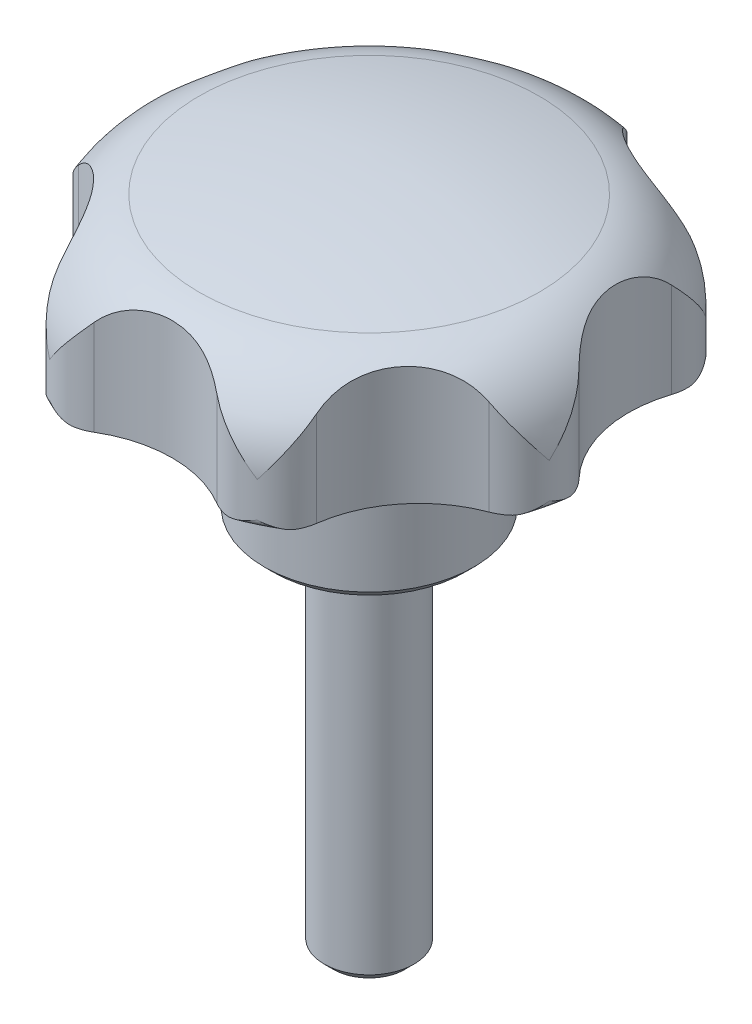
ISO-10303-21;
HEADER;
FILE_DESCRIPTION(('STEP AP214'),'2;1');
FILE_NAME('part.step','',(''),(''),'','','');
FILE_SCHEMA(('AUTOMOTIVE_DESIGN { 1 0 10303 214 1 1 1 1 }'));
ENDSEC;
DATA;
#1=APPLICATION_CONTEXT('core data for automotive mechanical design processes');
#2=APPLICATION_PROTOCOL_DEFINITION('international standard','automotive_design',2000,#1);
#3=PRODUCT_CONTEXT('',#1,'mechanical');
#4=PRODUCT('Part','Part','',(#3));
#5=PRODUCT_RELATED_PRODUCT_CATEGORY('part','',(#4));
#6=PRODUCT_DEFINITION_FORMATION('','',#4);
#7=PRODUCT_DEFINITION_CONTEXT('part definition',#1,'design');
#8=PRODUCT_DEFINITION('design','',#6,#7);
#9=PRODUCT_DEFINITION_SHAPE('','',#8);
#10=(LENGTH_UNIT() NAMED_UNIT(*) SI_UNIT(.MILLI.,.METRE.));
#11=(NAMED_UNIT(*) PLANE_ANGLE_UNIT() SI_UNIT($,.RADIAN.));
#12=(NAMED_UNIT(*) SI_UNIT($,.STERADIAN.) SOLID_ANGLE_UNIT());
#13=UNCERTAINTY_MEASURE_WITH_UNIT(LENGTH_MEASURE(1.E-05),#10,'distance_accuracy_value','');
#14=(GEOMETRIC_REPRESENTATION_CONTEXT(3) GLOBAL_UNCERTAINTY_ASSIGNED_CONTEXT((#13)) GLOBAL_UNIT_ASSIGNED_CONTEXT((#10,
#11,#12)) REPRESENTATION_CONTEXT('',''));
#15=CARTESIAN_POINT('',(0.,0.,0.));
#16=DIRECTION('',(0.,0.,1.));
#17=DIRECTION('',(1.,0.,0.));
#18=AXIS2_PLACEMENT_3D('',#15,#16,#17);
#19=CARTESIAN_POINT('',(6.4,0.,0.));
#20=DIRECTION('',(0.,1.,0.));
#21=DIRECTION('',(0.,0.,1.));
#22=AXIS2_PLACEMENT_3D('',#19,#20,#21);
#23=PLANE('',#22);
#24=CARTESIAN_POINT('',(0.,0.,0.));
#25=DIRECTION('',(0.,1.,0.));
#26=DIRECTION('',(0.,0.,1.));
#27=AXIS2_PLACEMENT_3D('',#24,#25,#26);
#28=CIRCLE('',#27,6.4);
#29=CARTESIAN_POINT('',(0.,0.,6.4));
#30=VERTEX_POINT('',#29);
#31=EDGE_CURVE('E1381',#30,#30,#28,.T.);
#32=ORIENTED_EDGE('',*,*,#31,.F.);
#33=EDGE_LOOP('',(#32));
#34=FACE_BOUND('',#33,.T.);
#35=CARTESIAN_POINT('',(0.,0.,0.));
#36=DIRECTION('',(0.,1.,0.));
#37=DIRECTION('',(0.,0.,1.));
#38=AXIS2_PLACEMENT_3D('',#35,#36,#37);
#39=CIRCLE('',#38,3.);
#40=CARTESIAN_POINT('',(0.,0.,3.));
#41=VERTEX_POINT('',#40);
#42=EDGE_CURVE('E12',#41,#41,#39,.F.);
#43=ORIENTED_EDGE('',*,*,#42,.F.);
#44=EDGE_LOOP('',(#43));
#45=FACE_BOUND('',#44,.T.);
#46=ADVANCED_FACE('F35',(#34,#45),#23,.F.);
#47=CARTESIAN_POINT('',(0.,0.,0.));
#48=DIRECTION('',(0.,1.,0.));
#49=DIRECTION('',(0.,0.,1.));
#50=AXIS2_PLACEMENT_3D('',#47,#48,#49);
#51=CYLINDRICAL_SURFACE('',#50,8.);
#52=CARTESIAN_POINT('',(0.,11.,0.));
#53=DIRECTION('',(0.,1.,0.));
#54=DIRECTION('',(0.,0.,1.));
#55=AXIS2_PLACEMENT_3D('',#52,#53,#54);
#56=CIRCLE('',#55,8.);
#57=CARTESIAN_POINT('',(0.,11.,8.));
#58=VERTEX_POINT('',#57);
#59=EDGE_CURVE('E1371',#58,#58,#56,.T.);
#60=ORIENTED_EDGE('',*,*,#59,.T.);
#61=EDGE_LOOP('',(#60));
#62=FACE_BOUND('',#61,.T.);
#63=CARTESIAN_POINT('',(0.,17.,0.));
#64=DIRECTION('',(0.,1.,0.));
#65=DIRECTION('',(0.,0.,1.));
#66=AXIS2_PLACEMENT_3D('',#63,#64,#65);
#67=CIRCLE('',#66,8.);
#68=CARTESIAN_POINT('',(0.,17.,8.));
#69=VERTEX_POINT('',#68);
#70=EDGE_CURVE('E323',#69,#69,#67,.T.);
#71=ORIENTED_EDGE('',*,*,#70,.F.);
#72=EDGE_LOOP('',(#71));
#73=FACE_BOUND('',#72,.T.);
#74=ADVANCED_FACE('F904',(#62,#73),#51,.T.);
#75=CARTESIAN_POINT('',(0.,10.,0.));
#76=DIRECTION('',(0.,1.,0.));
#77=DIRECTION('',(0.,0.,1.));
#78=AXIS2_PLACEMENT_3D('',#75,#76,#77);
#79=CONICAL_SURFACE('',#78,7.,0.785398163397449);
#80=ORIENTED_EDGE('',*,*,#59,.F.);
#81=EDGE_LOOP('',(#80));
#82=FACE_BOUND('',#81,.T.);
#83=CARTESIAN_POINT('',(0.,10.,0.));
#84=DIRECTION('',(0.,1.,0.));
#85=DIRECTION('',(0.,0.,1.));
#86=AXIS2_PLACEMENT_3D('',#83,#84,#85);
#87=CIRCLE('',#86,7.);
#88=CARTESIAN_POINT('',(0.,10.,7.));
#89=VERTEX_POINT('',#88);
#90=EDGE_CURVE('E1374',#89,#89,#87,.T.);
#91=ORIENTED_EDGE('',*,*,#90,.T.);
#92=EDGE_LOOP('',(#91));
#93=FACE_BOUND('',#92,.T.);
#94=ADVANCED_FACE('F909',(#82,#93),#79,.T.);
#95=CARTESIAN_POINT('',(0.,0.,0.));
#96=DIRECTION('',(0.,1.,0.));
#97=DIRECTION('',(0.,0.,1.));
#98=AXIS2_PLACEMENT_3D('',#95,#96,#97);
#99=CYLINDRICAL_SURFACE('',#98,7.);
#100=ORIENTED_EDGE('',*,*,#90,.F.);
#101=EDGE_LOOP('',(#100));
#102=FACE_BOUND('',#101,.T.);
#103=CARTESIAN_POINT('',(0.,0.6,0.));
#104=DIRECTION('',(0.,1.,0.));
#105=DIRECTION('',(0.,0.,1.));
#106=AXIS2_PLACEMENT_3D('',#103,#104,#105);
#107=CIRCLE('',#106,7.);
#108=CARTESIAN_POINT('',(0.,0.6,7.));
#109=VERTEX_POINT('',#108);
#110=EDGE_CURVE('E1377',#109,#109,#107,.T.);
#111=ORIENTED_EDGE('',*,*,#110,.T.);
#112=EDGE_LOOP('',(#111));
#113=FACE_BOUND('',#112,.T.);
#114=ADVANCED_FACE('F919',(#102,#113),#99,.T.);
#115=CARTESIAN_POINT('',(0.,0.,0.));
#116=DIRECTION('',(0.,1.,0.));
#117=DIRECTION('',(0.,0.,1.));
#118=AXIS2_PLACEMENT_3D('',#115,#116,#117);
#119=CONICAL_SURFACE('',#118,6.4,0.785398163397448);
#120=ORIENTED_EDGE('',*,*,#110,.F.);
#121=EDGE_LOOP('',(#120));
#122=FACE_BOUND('',#121,.T.);
#123=ORIENTED_EDGE('',*,*,#31,.T.);
#124=EDGE_LOOP('',(#123));
#125=FACE_BOUND('',#124,.T.);
#126=ADVANCED_FACE('F915',(#122,#125),#119,.T.);
#127=CARTESIAN_POINT('',(-15.0242801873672,17.,-0.981463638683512));
#128=DIRECTION('',(0.,-1.,0.));
#129=DIRECTION('',(0.,0.,-1.));
#130=AXIS2_PLACEMENT_3D('',#127,#128,#129);
#131=PLANE('',#130);
#132=ORIENTED_EDGE('',*,*,#70,.T.);
#133=EDGE_LOOP('',(#132));
#134=FACE_BOUND('',#133,.T.);
#135=CARTESIAN_POINT('',(0.,17.,0.));
#136=DIRECTION('',(0.,1.,0.));
#137=DIRECTION('',(0.,0.,1.));
#138=AXIS2_PLACEMENT_3D('',#135,#136,#137);
#139=CIRCLE('',#138,8.07707739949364);
#140=CARTESIAN_POINT('',(0.,17.,8.07707739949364));
#141=VERTEX_POINT('',#140);
#142=EDGE_CURVE('E328',#141,#141,#139,.F.);
#143=ORIENTED_EDGE('',*,*,#142,.T.);
#144=EDGE_LOOP('',(#143));
#145=FACE_BOUND('',#144,.T.);
#146=ADVANCED_FACE('F918',(#134,#145),#131,.T.);
#147=CARTESIAN_POINT('',(0.,16.7332857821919,0.));
#148=DIRECTION('',(0.,1.,0.));
#149=DIRECTION('',(0.,0.,1.));
#150=AXIS2_PLACEMENT_3D('',#147,#148,#149);
#151=TOROIDAL_SURFACE('',#150,8.50000000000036,0.500000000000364);
#152=CARTESIAN_POINT('',(0.,17.225215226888,0.));
#153=DIRECTION('',(0.,1.,0.));
#154=DIRECTION('',(0.,0.,1.));
#155=AXIS2_PLACEMENT_3D('',#152,#153,#154);
#156=CIRCLE('',#155,8.5894730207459);
#157=CARTESIAN_POINT('',(8.58947302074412,17.225215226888,0.));
#158=VERTEX_POINT('',#157);
#159=EDGE_CURVE('E966',#158,#158,#156,.T.);
#160=ORIENTED_EDGE('',*,*,#159,.F.);
#161=EDGE_LOOP('',(#160));
#162=FACE_BOUND('',#161,.T.);
#163=ORIENTED_EDGE('',*,*,#142,.F.);
#164=EDGE_LOOP('',(#163));
#165=FACE_BOUND('',#164,.T.);
#166=ADVANCED_FACE('F927',(#162,#165),#151,.F.);
#167=CARTESIAN_POINT('',(-5.29871285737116E-12,-30.0000000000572,0.));
#168=DIRECTION('',(0.,1.,0.));
#169=DIRECTION('',(1.,0.,0.));
#170=AXIS2_PLACEMENT_3D('',#167,#168,#169);
#171=SPHERICAL_SURFACE('',#170,48.0000000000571);
#172=CARTESIAN_POINT('',(-5.29871285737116E-12,17.,0.));
#173=DIRECTION('',(0.,-1.,0.));
#174=DIRECTION('',(0.,0.,-1.));
#175=AXIS2_PLACEMENT_3D('',#172,#173,#174);
#176=CIRCLE('',#175,9.74679434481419);
#177=CARTESIAN_POINT('',(9.74679434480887,17.,0.));
#178=VERTEX_POINT('',#177);
#179=EDGE_CURVE('E332',#178,#178,#176,.F.);
#180=CARTESIAN_POINT('',(8.58947302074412,17.225215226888,0.));
#181=CARTESIAN_POINT('',(8.60155665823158,17.2230174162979,0.));
#182=CARTESIAN_POINT('',(8.6136394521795,17.2208149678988,0.));
#183=CARTESIAN_POINT('',(8.63780334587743,17.2164007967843,0.));
#184=CARTESIAN_POINT('',(8.64988444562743,17.214189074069,0.));
#185=CARTESIAN_POINT('',(8.67404494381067,17.2097563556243,0.));
#186=CARTESIAN_POINT('',(8.68612434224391,17.207535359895,0.));
#187=CARTESIAN_POINT('',(8.71028143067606,17.2030840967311,0.));
#188=CARTESIAN_POINT('',(8.72235912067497,17.2008538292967,0.));
#189=CARTESIAN_POINT('',(8.74651278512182,17.1963840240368,0.));
#190=CARTESIAN_POINT('',(8.75858875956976,17.1941444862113,0.));
#191=CARTESIAN_POINT('',(8.78273898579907,17.1896561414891,0.));
#192=CARTESIAN_POINT('',(8.79481323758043,17.1874073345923,0.));
#193=CARTESIAN_POINT('',(8.81896001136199,17.1829004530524,0.));
#194=CARTESIAN_POINT('',(8.83103253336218,17.1806423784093,0.));
#195=CARTESIAN_POINT('',(8.85517584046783,17.1761169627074,0.));
#196=CARTESIAN_POINT('',(8.86724662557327,17.1738496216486,0.));
#197=CARTESIAN_POINT('',(8.89138645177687,17.1693056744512,0.));
#198=CARTESIAN_POINT('',(8.90345549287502,17.1670290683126,0.));
#199=CARTESIAN_POINT('',(8.92759182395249,17.1624665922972,0.));
#200=CARTESIAN_POINT('',(8.93965911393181,17.1601807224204,0.));
#201=CARTESIAN_POINT('',(8.96379193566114,17.1555997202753,0.));
#202=CARTESIAN_POINT('',(8.97585746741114,17.1533045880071,0.));
#203=CARTESIAN_POINT('',(8.99998676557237,17.1487050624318,0.));
#204=CARTESIAN_POINT('',(9.0120505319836,17.1464006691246,0.));
#205=CARTESIAN_POINT('',(9.03617629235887,17.1417826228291,0.));
#206=CARTESIAN_POINT('',(9.04823828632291,17.1394689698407,0.));
#207=CARTESIAN_POINT('',(9.07236049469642,17.1348324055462,0.));
#208=CARTESIAN_POINT('',(9.08442070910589,17.13250949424,0.));
#209=CARTESIAN_POINT('',(9.10853935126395,17.1278544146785,0.));
#210=CARTESIAN_POINT('',(9.12059777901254,17.1255222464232,0.));
#211=CARTESIAN_POINT('',(9.14471284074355,17.1208486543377,0.));
#212=CARTESIAN_POINT('',(9.15676947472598,17.1185072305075,0.));
#213=CARTESIAN_POINT('',(9.18088094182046,17.1138151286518,0.));
#214=CARTESIAN_POINT('',(9.19293577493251,17.1114644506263,0.));
#215=CARTESIAN_POINT('',(9.21704363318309,17.1067538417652,0.));
#216=CARTESIAN_POINT('',(9.22909665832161,17.1043939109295,0.));
#217=CARTESIAN_POINT('',(9.25320089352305,17.0996647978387,0.));
#218=CARTESIAN_POINT('',(9.26525210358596,17.0972956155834,0.));
#219=CARTESIAN_POINT('',(9.28935270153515,17.0925480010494,0.));
#220=CARTESIAN_POINT('',(9.30140208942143,17.0901695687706,0.));
#221=CARTESIAN_POINT('',(9.3254990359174,17.0854034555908,0.));
#222=CARTESIAN_POINT('',(9.33754659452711,17.0830157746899,0.));
#223=CARTESIAN_POINT('',(9.36163987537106,17.0782311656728,0.));
#224=CARTESIAN_POINT('',(9.37368559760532,17.0758342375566,0.));
#225=CARTESIAN_POINT('',(9.3977751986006,17.0710311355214,0.));
#226=CARTESIAN_POINT('',(9.40981907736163,17.0686249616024,0.));
#227=CARTESIAN_POINT('',(9.43390498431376,17.0638033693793,0.));
#228=CARTESIAN_POINT('',(9.44594701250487,17.0613879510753,0.));
#229=CARTESIAN_POINT('',(9.47002921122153,17.0565478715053,0.));
#230=CARTESIAN_POINT('',(9.4820693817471,17.0541232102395,0.));
#231=CARTESIAN_POINT('',(9.50614785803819,17.0492646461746,0.));
#232=CARTESIAN_POINT('',(9.51818616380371,17.0468307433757,0.));
#233=CARTESIAN_POINT('',(9.54226090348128,17.0419536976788,0.));
#234=CARTESIAN_POINT('',(9.55429733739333,17.0395105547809,0.));
#235=CARTESIAN_POINT('',(9.57836832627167,17.0346150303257,0.));
#236=CARTESIAN_POINT('',(9.59040288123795,17.0321626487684,0.));
#237=CARTESIAN_POINT('',(9.61447010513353,17.0272486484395,0.));
#238=CARTESIAN_POINT('',(9.62650277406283,17.0247870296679,0.));
#239=CARTESIAN_POINT('',(9.65056621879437,17.0198545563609,0.));
#240=CARTESIAN_POINT('',(9.66259699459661,17.0173837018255,0.));
#241=CARTESIAN_POINT('',(9.68665664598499,17.0124327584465,0.));
#242=CARTESIAN_POINT('',(9.69868552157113,17.0099526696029,0.));
#243=CARTESIAN_POINT('',(9.72274136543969,17.0049832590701,0.));
#244=CARTESIAN_POINT('',(9.73476833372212,17.0024939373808,0.));
#245=CARTESIAN_POINT('',(9.74679434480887,17.,0.));
#246=B_SPLINE_CURVE_WITH_KNOTS('',3,(#180,#181,#182,#183,#184,#185,#186,#187,#188,#189,#190,
#191,#192,#193,#194,#195,#196,#197,#198,#199,#200,#201,#202,#203,#204,#205,#206,#207,#208,#209,
#210,#211,#212,#213,#214,#215,#216,#217,#218,#219,#220,#221,#222,#223,#224,#225,#226,#227,#228,
#229,#230,#231,#232,#233,#234,#235,#236,#237,#238,#239,#240,#241,#242,#243,#244,#245),
.UNSPECIFIED.,.F.,.F.,(4,2,2,2,2,2,2,2,2,2,2,2,2,2,2,2,2,2,2,2,2,2,2,2,2,2,2,2,2,2,2,2,4),(0.,
0.0368456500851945,0.0736913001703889,0.110536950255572,0.147382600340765,0.184228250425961,
0.221073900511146,0.257919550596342,0.294765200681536,0.331610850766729,0.368456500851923,
0.405302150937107,0.442147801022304,0.478993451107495,0.515839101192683,0.552684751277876,
0.589530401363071,0.626376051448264,0.66322170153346,0.700067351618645,0.736913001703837,
0.773758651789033,0.810604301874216,0.847449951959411,0.884295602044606,0.921141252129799,
0.957986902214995,0.99483255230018,1.03167820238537,1.06852385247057,1.10536950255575,
1.14221515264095,1.17906080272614),.UNSPECIFIED.);
#247=EDGE_CURVE('BSEAM930',#158,#178,#246,.T.);
#248=ORIENTED_EDGE('',*,*,#159,.T.);
#249=ORIENTED_EDGE('',*,*,#179,.F.);
#250=ORIENTED_EDGE('',*,*,#247,.T.);
#251=ORIENTED_EDGE('',*,*,#247,.F.);
#252=EDGE_LOOP('',(#248,#250,#249,#251));
#253=FACE_BOUND('',#252,.T.);
#254=ADVANCED_FACE('F930',(#253),#171,.F.);
#255=CARTESIAN_POINT('',(-19.324353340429,17.,-4.41065754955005));
#256=DIRECTION('',(0.,-1.,0.));
#257=DIRECTION('',(0.,0.,-1.));
#258=AXIS2_PLACEMENT_3D('',#255,#256,#257);
#259=CYLINDRICAL_SURFACE('',#258,8.0000000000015);
#260=CARTESIAN_POINT('',(-19.324353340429,10.,-4.41065754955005));
#261=DIRECTION('',(0.,1.,0.));
#262=DIRECTION('',(0.,0.,1.));
#263=AXIS2_PLACEMENT_3D('',#260,#261,#262);
#264=CIRCLE('',#263,8.0000000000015);
#265=CARTESIAN_POINT('',(-13.069701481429,10.,0.577260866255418));
#266=VERTEX_POINT('',#265);
#267=CARTESIAN_POINT('',(-11.5249300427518,10.,-6.19082502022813));
#268=VERTEX_POINT('',#267);
#269=EDGE_CURVE('E43',#266,#268,#264,.T.);
#270=ORIENTED_EDGE('',*,*,#269,.T.);
#271=DIRECTION('',(0.,-1.,0.));
#272=VECTOR('',#271,1.);
#273=CARTESIAN_POINT('',(-11.5249300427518,17.,-6.19082502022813));
#274=LINE('',#273,#272);
#275=CARTESIAN_POINT('',(-11.5249300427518,17.,-6.19082502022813));
#276=VERTEX_POINT('',#275);
#277=EDGE_CURVE('E50',#276,#268,#274,.T.);
#278=ORIENTED_EDGE('',*,*,#277,.F.);
#279=CARTESIAN_POINT('',(-19.324353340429,17.,-4.41065754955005));
#280=DIRECTION('',(0.,-1.,0.));
#281=DIRECTION('',(0.,0.,-1.));
#282=AXIS2_PLACEMENT_3D('',#279,#280,#281);
#283=CIRCLE('',#282,8.0000000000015);
#284=CARTESIAN_POINT('',(-13.069701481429,17.,0.577260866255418));
#285=VERTEX_POINT('',#284);
#286=EDGE_CURVE('E310',#276,#285,#283,.T.);
#287=ORIENTED_EDGE('',*,*,#286,.T.);
#288=DIRECTION('',(0.,-1.,0.));
#289=VECTOR('',#288,1.);
#290=CARTESIAN_POINT('',(-13.069701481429,17.,0.577260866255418));
#291=LINE('',#290,#289);
#292=EDGE_CURVE('E321',#285,#266,#291,.T.);
#293=ORIENTED_EDGE('',*,*,#292,.T.);
#294=EDGE_LOOP('',(#270,#278,#287,#293));
#295=FACE_BOUND('',#294,.T.);
#296=ADVANCED_FACE('F320',(#295),#259,.T.);
#297=CARTESIAN_POINT('',(-10.7242070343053,17.,2.44773027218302));
#298=DIRECTION('',(0.,-1.,0.));
#299=DIRECTION('',(0.,0.,-1.));
#300=AXIS2_PLACEMENT_3D('',#297,#298,#299);
#301=CYLINDRICAL_SURFACE('',#300,2.99999999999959);
#302=CARTESIAN_POINT('',(-10.7242070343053,10.,2.44773027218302));
#303=DIRECTION('',(0.,1.,0.));
#304=DIRECTION('',(0.,0.,1.));
#305=AXIS2_PLACEMENT_3D('',#302,#303,#304);
#306=CIRCLE('',#305,2.99999999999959);
#307=CARTESIAN_POINT('',(-12.0258582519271,10.,5.15063687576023));
#308=VERTEX_POINT('',#307);
#309=EDGE_CURVE('E327',#308,#266,#306,.F.);
#310=ORIENTED_EDGE('',*,*,#309,.T.);
#311=ORIENTED_EDGE('',*,*,#292,.F.);
#312=CARTESIAN_POINT('',(-10.7242070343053,17.,2.44773027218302));
#313=DIRECTION('',(0.,1.,0.));
#314=DIRECTION('',(0.,0.,1.));
#315=AXIS2_PLACEMENT_3D('',#312,#313,#314);
#316=CIRCLE('',#315,2.99999999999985);
#317=CARTESIAN_POINT('',(-12.0258582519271,17.,5.15063687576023));
#318=VERTEX_POINT('',#317);
#319=EDGE_CURVE('E305',#285,#318,#316,.T.);
#320=ORIENTED_EDGE('',*,*,#319,.T.);
#321=DIRECTION('',(0.,-1.,0.));
#322=VECTOR('',#321,1.);
#323=CARTESIAN_POINT('',(-12.0258582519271,17.,5.15063687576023));
#324=LINE('',#323,#322);
#325=EDGE_CURVE('E329',#318,#308,#324,.T.);
#326=ORIENTED_EDGE('',*,*,#325,.T.);
#327=EDGE_LOOP('',(#310,#311,#320,#326));
#328=FACE_BOUND('',#327,.T.);
#329=ADVANCED_FACE('F325',(#328),#301,.F.);
#330=CARTESIAN_POINT('',(-15.4969281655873,17.,12.3583878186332));
#331=DIRECTION('',(0.,-1.,0.));
#332=DIRECTION('',(0.,0.,-1.));
#333=AXIS2_PLACEMENT_3D('',#330,#331,#332);
#334=CYLINDRICAL_SURFACE('',#333,8.00000000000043);
#335=CARTESIAN_POINT('',(-15.4969281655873,10.,12.3583878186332));
#336=DIRECTION('',(0.,1.,0.));
#337=DIRECTION('',(0.,0.,1.));
#338=AXIS2_PLACEMENT_3D('',#335,#336,#337);
#339=CIRCLE('',#338,8.00000000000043);
#340=CARTESIAN_POINT('',(-7.6975048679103,10.,10.578220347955));
#341=VERTEX_POINT('',#340);
#342=EDGE_CURVE('E781',#341,#308,#339,.T.);
#343=ORIENTED_EDGE('',*,*,#342,.T.);
#344=ORIENTED_EDGE('',*,*,#325,.F.);
#345=CARTESIAN_POINT('',(-15.4969281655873,17.,12.3583878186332));
#346=DIRECTION('',(0.,-1.,0.));
#347=DIRECTION('',(0.,0.,-1.));
#348=AXIS2_PLACEMENT_3D('',#345,#346,#347);
#349=CIRCLE('',#348,8.00000000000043);
#350=CARTESIAN_POINT('',(-7.6975048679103,17.,10.578220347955));
#351=VERTEX_POINT('',#350);
#352=EDGE_CURVE('E312',#318,#351,#349,.T.);
#353=ORIENTED_EDGE('',*,*,#352,.T.);
#354=DIRECTION('',(0.,-1.,0.));
#355=VECTOR('',#354,1.);
#356=CARTESIAN_POINT('',(-7.6975048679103,17.,10.578220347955));
#357=LINE('',#356,#355);
#358=EDGE_CURVE('E334',#351,#341,#357,.T.);
#359=ORIENTED_EDGE('',*,*,#358,.T.);
#360=EDGE_LOOP('',(#343,#344,#353,#359));
#361=FACE_BOUND('',#360,.T.);
#362=ADVANCED_FACE('F832',(#361),#334,.T.);
#363=CARTESIAN_POINT('',(-4.77272113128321,17.,9.91065754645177));
#364=DIRECTION('',(0.,-1.,0.));
#365=DIRECTION('',(0.,0.,-1.));
#366=AXIS2_PLACEMENT_3D('',#363,#364,#365);
#367=CYLINDRICAL_SURFACE('',#366,2.99999999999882);
#368=CARTESIAN_POINT('',(-4.77272113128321,10.,9.91065754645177));
#369=DIRECTION('',(0.,1.,0.));
#370=DIRECTION('',(0.,0.,1.));
#371=AXIS2_PLACEMENT_3D('',#368,#369,#370);
#372=CIRCLE('',#371,2.99999999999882);
#373=CARTESIAN_POINT('',(-3.47106991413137,10.,12.6135641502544));
#374=VERTEX_POINT('',#373);
#375=EDGE_CURVE('E779',#374,#341,#372,.F.);
#376=ORIENTED_EDGE('',*,*,#375,.T.);
#377=ORIENTED_EDGE('',*,*,#358,.F.);
#378=CARTESIAN_POINT('',(-4.77272113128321,17.,9.91065754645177));
#379=DIRECTION('',(0.,1.,0.));
#380=DIRECTION('',(0.,0.,1.));
#381=AXIS2_PLACEMENT_3D('',#378,#379,#380);
#382=CIRCLE('',#381,2.99999999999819);
#383=CARTESIAN_POINT('',(-3.47106991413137,17.,12.6135641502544));
#384=VERTEX_POINT('',#383);
#385=EDGE_CURVE('E839',#351,#384,#382,.T.);
#386=ORIENTED_EDGE('',*,*,#385,.T.);
#387=DIRECTION('',(0.,-1.,0.));
#388=VECTOR('',#387,1.);
#389=CARTESIAN_POINT('',(-3.47106991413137,17.,12.6135641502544));
#390=LINE('',#389,#388);
#391=EDGE_CURVE('E826',#384,#374,#390,.T.);
#392=ORIENTED_EDGE('',*,*,#391,.T.);
#393=EDGE_LOOP('',(#376,#377,#386,#392));
#394=FACE_BOUND('',#393,.T.);
#395=ADVANCED_FACE('F837',(#394),#367,.F.);
#396=CARTESIAN_POINT('',(-1.72993529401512E-09,17.,19.8213150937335));
#397=DIRECTION('',(0.,-1.,0.));
#398=DIRECTION('',(0.,0.,-1.));
#399=AXIS2_PLACEMENT_3D('',#396,#397,#398);
#400=CYLINDRICAL_SURFACE('',#399,7.99999999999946);
#401=CARTESIAN_POINT('',(-1.72993529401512E-09,10.,19.8213150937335));
#402=DIRECTION('',(0.,1.,0.));
#403=DIRECTION('',(0.,0.,1.));
#404=AXIS2_PLACEMENT_3D('',#401,#402,#403);
#405=CIRCLE('',#404,7.99999999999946);
#406=CARTESIAN_POINT('',(3.4710699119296,10.,12.613564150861));
#407=VERTEX_POINT('',#406);
#408=EDGE_CURVE('E777',#407,#374,#405,.T.);
#409=ORIENTED_EDGE('',*,*,#408,.T.);
#410=ORIENTED_EDGE('',*,*,#391,.F.);
#411=CARTESIAN_POINT('',(-1.72993529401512E-09,17.,19.8213150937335));
#412=DIRECTION('',(0.,-1.,0.));
#413=DIRECTION('',(0.,0.,-1.));
#414=AXIS2_PLACEMENT_3D('',#411,#412,#413);
#415=CIRCLE('',#414,7.99999999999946);
#416=CARTESIAN_POINT('',(3.4710699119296,17.,12.613564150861));
#417=VERTEX_POINT('',#416);
#418=EDGE_CURVE('E843',#384,#417,#415,.T.);
#419=ORIENTED_EDGE('',*,*,#418,.T.);
#420=DIRECTION('',(0.,-1.,0.));
#421=VECTOR('',#420,1.);
#422=CARTESIAN_POINT('',(3.4710699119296,17.,12.613564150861));
#423=LINE('',#422,#421);
#424=EDGE_CURVE('E823',#417,#407,#423,.T.);
#425=ORIENTED_EDGE('',*,*,#424,.T.);
#426=EDGE_LOOP('',(#409,#410,#419,#425));
#427=FACE_BOUND('',#426,.T.);
#428=ADVANCED_FACE('F842',(#427),#400,.T.);
#429=CARTESIAN_POINT('',(4.77272112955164,17.,9.9106575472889));
#430=DIRECTION('',(0.,-1.,0.));
#431=DIRECTION('',(0.,0.,-1.));
#432=AXIS2_PLACEMENT_3D('',#429,#430,#431);
#433=CYLINDRICAL_SURFACE('',#432,2.999999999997);
#434=CARTESIAN_POINT('',(4.77272112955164,10.,9.9106575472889));
#435=DIRECTION('',(0.,1.,0.));
#436=DIRECTION('',(0.,0.,1.));
#437=AXIS2_PLACEMENT_3D('',#434,#435,#436);
#438=CIRCLE('',#437,2.999999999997);
#439=CARTESIAN_POINT('',(7.69750486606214,10.,10.5782203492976));
#440=VERTEX_POINT('',#439);
#441=EDGE_CURVE('E775',#440,#407,#438,.F.);
#442=ORIENTED_EDGE('',*,*,#441,.T.);
#443=ORIENTED_EDGE('',*,*,#424,.F.);
#444=CARTESIAN_POINT('',(4.77272112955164,17.,9.9106575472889));
#445=DIRECTION('',(0.,1.,0.));
#446=DIRECTION('',(0.,0.,1.));
#447=AXIS2_PLACEMENT_3D('',#444,#445,#446);
#448=CIRCLE('',#447,2.9999999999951);
#449=CARTESIAN_POINT('',(7.69750486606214,17.,10.5782203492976));
#450=VERTEX_POINT('',#449);
#451=EDGE_CURVE('E847',#417,#450,#448,.T.);
#452=ORIENTED_EDGE('',*,*,#451,.T.);
#453=DIRECTION('',(0.,-1.,0.));
#454=VECTOR('',#453,1.);
#455=CARTESIAN_POINT('',(7.69750486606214,17.,10.5782203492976));
#456=LINE('',#455,#454);
#457=EDGE_CURVE('E820',#450,#440,#456,.T.);
#458=ORIENTED_EDGE('',*,*,#457,.T.);
#459=EDGE_LOOP('',(#442,#443,#452,#458));
#460=FACE_BOUND('',#459,.T.);
#461=ADVANCED_FACE('F894',(#460),#433,.F.);
#462=CARTESIAN_POINT('',(15.496928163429,17.,12.3583878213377));
#463=DIRECTION('',(0.,-1.,0.));
#464=DIRECTION('',(0.,0.,-1.));
#465=AXIS2_PLACEMENT_3D('',#462,#463,#464);
#466=CYLINDRICAL_SURFACE('',#465,7.99999999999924);
#467=CARTESIAN_POINT('',(15.496928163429,10.,12.3583878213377));
#468=DIRECTION('',(0.,1.,0.));
#469=DIRECTION('',(0.,0.,1.));
#470=AXIS2_PLACEMENT_3D('',#467,#468,#469);
#471=CIRCLE('',#470,7.99999999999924);
#472=CARTESIAN_POINT('',(12.025858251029,10.,5.1506368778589));
#473=VERTEX_POINT('',#472);
#474=EDGE_CURVE('E773',#473,#440,#471,.T.);
#475=ORIENTED_EDGE('',*,*,#474,.T.);
#476=ORIENTED_EDGE('',*,*,#457,.F.);
#477=CARTESIAN_POINT('',(15.496928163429,17.,12.3583878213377));
#478=DIRECTION('',(0.,-1.,0.));
#479=DIRECTION('',(0.,0.,-1.));
#480=AXIS2_PLACEMENT_3D('',#477,#478,#479);
#481=CIRCLE('',#480,7.99999999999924);
#482=CARTESIAN_POINT('',(12.025858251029,17.,5.1506368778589));
#483=VERTEX_POINT('',#482);
#484=EDGE_CURVE('E849',#450,#483,#481,.T.);
#485=ORIENTED_EDGE('',*,*,#484,.T.);
#486=DIRECTION('',(0.,-1.,0.));
#487=VECTOR('',#486,1.);
#488=CARTESIAN_POINT('',(12.025858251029,17.,5.1506368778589));
#489=LINE('',#488,#487);
#490=EDGE_CURVE('E817',#483,#473,#489,.T.);
#491=ORIENTED_EDGE('',*,*,#490,.T.);
#492=EDGE_LOOP('',(#475,#476,#485,#491));
#493=FACE_BOUND('',#492,.T.);
#494=ADVANCED_FACE('F891',(#493),#466,.T.);
#495=CARTESIAN_POINT('',(10.7242070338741,17.,2.44773027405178));
#496=DIRECTION('',(0.,-1.,0.));
#497=DIRECTION('',(0.,0.,-1.));
#498=AXIS2_PLACEMENT_3D('',#495,#496,#497);
#499=CYLINDRICAL_SURFACE('',#498,3.00000000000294);
#500=CARTESIAN_POINT('',(10.7242070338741,10.,2.44773027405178));
#501=DIRECTION('',(0.,1.,0.));
#502=DIRECTION('',(0.,0.,1.));
#503=AXIS2_PLACEMENT_3D('',#500,#501,#502);
#504=CIRCLE('',#503,3.00000000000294);
#505=CARTESIAN_POINT('',(13.06970148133,10.,0.577260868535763));
#506=VERTEX_POINT('',#505);
#507=EDGE_CURVE('E771',#506,#473,#504,.F.);
#508=ORIENTED_EDGE('',*,*,#507,.T.);
#509=ORIENTED_EDGE('',*,*,#490,.F.);
#510=CARTESIAN_POINT('',(10.7242070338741,17.,2.44773027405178));
#511=DIRECTION('',(0.,1.,0.));
#512=DIRECTION('',(0.,0.,1.));
#513=AXIS2_PLACEMENT_3D('',#510,#511,#512);
#514=CIRCLE('',#513,3.00000000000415);
#515=CARTESIAN_POINT('',(13.06970148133,17.,0.577260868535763));
#516=VERTEX_POINT('',#515);
#517=EDGE_CURVE('E855',#483,#516,#514,.T.);
#518=ORIENTED_EDGE('',*,*,#517,.T.);
#519=DIRECTION('',(0.,-1.,0.));
#520=VECTOR('',#519,1.);
#521=CARTESIAN_POINT('',(13.06970148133,17.,0.577260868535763));
#522=LINE('',#521,#520);
#523=EDGE_CURVE('E814',#516,#506,#522,.T.);
#524=ORIENTED_EDGE('',*,*,#523,.T.);
#525=EDGE_LOOP('',(#508,#509,#518,#524));
#526=FACE_BOUND('',#525,.T.);
#527=ADVANCED_FACE('F888',(#526),#499,.F.);
#528=CARTESIAN_POINT('',(19.3243533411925,17.,-4.41065754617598));
#529=DIRECTION('',(0.,-1.,0.));
#530=DIRECTION('',(0.,0.,-1.));
#531=AXIS2_PLACEMENT_3D('',#528,#529,#530);
#532=CYLINDRICAL_SURFACE('',#531,7.99999999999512);
#533=CARTESIAN_POINT('',(19.3243533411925,10.,-4.41065754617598));
#534=DIRECTION('',(0.,1.,0.));
#535=DIRECTION('',(0.,0.,1.));
#536=AXIS2_PLACEMENT_3D('',#533,#534,#535);
#537=CIRCLE('',#536,7.99999999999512);
#538=CARTESIAN_POINT('',(11.524930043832,10.,-6.1908250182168));
#539=VERTEX_POINT('',#538);
#540=EDGE_CURVE('E769',#539,#506,#537,.T.);
#541=ORIENTED_EDGE('',*,*,#540,.T.);
#542=ORIENTED_EDGE('',*,*,#523,.F.);
#543=CARTESIAN_POINT('',(19.3243533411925,17.,-4.41065754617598));
#544=DIRECTION('',(0.,-1.,0.));
#545=DIRECTION('',(0.,0.,-1.));
#546=AXIS2_PLACEMENT_3D('',#543,#544,#545);
#547=CIRCLE('',#546,7.99999999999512);
#548=CARTESIAN_POINT('',(11.524930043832,17.,-6.1908250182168));
#549=VERTEX_POINT('',#548);
#550=EDGE_CURVE('E857',#516,#549,#547,.T.);
#551=ORIENTED_EDGE('',*,*,#550,.T.);
#552=DIRECTION('',(0.,-1.,0.));
#553=VECTOR('',#552,1.);
#554=CARTESIAN_POINT('',(11.524930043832,17.,-6.1908250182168));
#555=LINE('',#554,#553);
#556=EDGE_CURVE('E811',#549,#539,#555,.T.);
#557=ORIENTED_EDGE('',*,*,#556,.T.);
#558=EDGE_LOOP('',(#541,#542,#551,#557));
#559=FACE_BOUND('',#558,.T.);
#560=ADVANCED_FACE('F882',(#559),#532,.T.);
#561=CARTESIAN_POINT('',(8.6001463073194,17.,-6.85838782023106));
#562=DIRECTION('',(0.,-1.,0.));
#563=DIRECTION('',(0.,0.,-1.));
#564=AXIS2_PLACEMENT_3D('',#561,#562,#563);
#565=CYLINDRICAL_SURFACE('',#564,3.00000000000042);
#566=CARTESIAN_POINT('',(8.6001463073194,10.,-6.85838782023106));
#567=DIRECTION('',(0.,1.,0.));
#568=DIRECTION('',(0.,0.,1.));
#569=AXIS2_PLACEMENT_3D('',#566,#567,#568);
#570=CIRCLE('',#569,3.00000000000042);
#571=CARTESIAN_POINT('',(8.6001463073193,10.,-9.85838782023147));
#572=VERTEX_POINT('',#571);
#573=EDGE_CURVE('E767',#572,#539,#570,.F.);
#574=ORIENTED_EDGE('',*,*,#573,.T.);
#575=ORIENTED_EDGE('',*,*,#556,.F.);
#576=CARTESIAN_POINT('',(8.6001463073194,17.,-6.85838782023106));
#577=DIRECTION('',(0.,1.,0.));
#578=DIRECTION('',(0.,0.,1.));
#579=AXIS2_PLACEMENT_3D('',#576,#577,#578);
#580=CIRCLE('',#579,3.00000000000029);
#581=CARTESIAN_POINT('',(8.6001463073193,17.,-9.85838782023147));
#582=VERTEX_POINT('',#581);
#583=EDGE_CURVE('E859',#549,#582,#580,.T.);
#584=ORIENTED_EDGE('',*,*,#583,.T.);
#585=DIRECTION('',(0.,-1.,0.));
#586=VECTOR('',#585,1.);
#587=CARTESIAN_POINT('',(8.6001463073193,17.,-9.85838782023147));
#588=LINE('',#587,#586);
#589=EDGE_CURVE('E808',#582,#572,#588,.T.);
#590=ORIENTED_EDGE('',*,*,#589,.T.);
#591=EDGE_LOOP('',(#574,#575,#584,#590));
#592=FACE_BOUND('',#591,.T.);
#593=ADVANCED_FACE('F880',(#592),#565,.F.);
#594=CARTESIAN_POINT('',(8.60014630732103,17.,-17.8583878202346));
#595=DIRECTION('',(0.,-1.,0.));
#596=DIRECTION('',(0.,0.,-1.));
#597=AXIS2_PLACEMENT_3D('',#594,#595,#596);
#598=CYLINDRICAL_SURFACE('',#597,8.00000000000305);
#599=CARTESIAN_POINT('',(8.60014630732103,10.,-17.8583878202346));
#600=DIRECTION('',(0.,1.,0.));
#601=DIRECTION('',(0.,0.,1.));
#602=AXIS2_PLACEMENT_3D('',#599,#600,#601);
#603=CIRCLE('',#602,8.00000000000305);
#604=CARTESIAN_POINT('',(2.3454944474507,10.,-12.870469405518));
#605=VERTEX_POINT('',#604);
#606=EDGE_CURVE('E765',#605,#572,#603,.T.);
#607=ORIENTED_EDGE('',*,*,#606,.T.);
#608=ORIENTED_EDGE('',*,*,#589,.F.);
#609=CARTESIAN_POINT('',(8.60014630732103,17.,-17.8583878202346));
#610=DIRECTION('',(0.,-1.,0.));
#611=DIRECTION('',(0.,0.,-1.));
#612=AXIS2_PLACEMENT_3D('',#609,#610,#611);
#613=CIRCLE('',#612,8.00000000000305);
#614=CARTESIAN_POINT('',(2.3454944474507,17.,-12.870469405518));
#615=VERTEX_POINT('',#614);
#616=EDGE_CURVE('E861',#582,#615,#613,.T.);
#617=ORIENTED_EDGE('',*,*,#616,.T.);
#618=DIRECTION('',(0.,-1.,0.));
#619=VECTOR('',#618,1.);
#620=CARTESIAN_POINT('',(2.3454944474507,17.,-12.870469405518));
#621=LINE('',#620,#619);
#622=EDGE_CURVE('E800',#615,#605,#621,.T.);
#623=ORIENTED_EDGE('',*,*,#622,.T.);
#624=EDGE_LOOP('',(#607,#608,#617,#623));
#625=FACE_BOUND('',#624,.T.);
#626=ADVANCED_FACE('F873',(#625),#598,.T.);
#627=CARTESIAN_POINT('',(-6.83264209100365E-13,17.,-10.9999999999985));
#628=DIRECTION('',(0.,-1.,0.));
#629=DIRECTION('',(0.,0.,-1.));
#630=AXIS2_PLACEMENT_3D('',#627,#628,#629);
#631=CYLINDRICAL_SURFACE('',#630,2.99999999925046);
#632=CARTESIAN_POINT('',(-6.83264209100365E-13,10.,-10.9999999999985));
#633=DIRECTION('',(0.,1.,0.));
#634=DIRECTION('',(0.,0.,1.));
#635=AXIS2_PLACEMENT_3D('',#632,#633,#634);
#636=CIRCLE('',#635,2.99999999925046);
#637=CARTESIAN_POINT('',(-2.34549444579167,10.,-12.8704694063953));
#638=VERTEX_POINT('',#637);
#639=EDGE_CURVE('E763',#638,#605,#636,.F.);
#640=ORIENTED_EDGE('',*,*,#639,.T.);
#641=ORIENTED_EDGE('',*,*,#622,.F.);
#642=CARTESIAN_POINT('',(-6.83264209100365E-13,17.,-10.9999999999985));
#643=DIRECTION('',(0.,1.,0.));
#644=DIRECTION('',(0.,0.,1.));
#645=AXIS2_PLACEMENT_3D('',#642,#643,#644);
#646=CIRCLE('',#645,3.0000000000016);
#647=CARTESIAN_POINT('',(-2.34549444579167,17.,-12.8704694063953));
#648=VERTEX_POINT('',#647);
#649=EDGE_CURVE('E863',#615,#648,#646,.T.);
#650=ORIENTED_EDGE('',*,*,#649,.T.);
#651=DIRECTION('',(0.,-1.,0.));
#652=VECTOR('',#651,1.);
#653=CARTESIAN_POINT('',(-2.34549444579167,17.,-12.8704694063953));
#654=LINE('',#653,#652);
#655=EDGE_CURVE('E798',#648,#638,#654,.T.);
#656=ORIENTED_EDGE('',*,*,#655,.T.);
#657=EDGE_LOOP('',(#640,#641,#650,#656));
#658=FACE_BOUND('',#657,.T.);
#659=ADVANCED_FACE('F870',(#658),#631,.F.);
#660=CARTESIAN_POINT('',(-8.6001463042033,17.,-17.8583878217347));
#661=DIRECTION('',(0.,-1.,0.));
#662=DIRECTION('',(0.,0.,-1.));
#663=AXIS2_PLACEMENT_3D('',#660,#661,#662);
#664=CYLINDRICAL_SURFACE('',#663,8.00000000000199);
#665=CARTESIAN_POINT('',(-8.6001463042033,10.,-17.8583878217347));
#666=DIRECTION('',(0.,1.,0.));
#667=DIRECTION('',(0.,0.,1.));
#668=AXIS2_PLACEMENT_3D('',#665,#666,#667);
#669=CIRCLE('',#668,8.00000000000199);
#670=CARTESIAN_POINT('',(-8.6001463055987,10.,-9.8583878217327));
#671=VERTEX_POINT('',#670);
#672=EDGE_CURVE('E753',#671,#638,#669,.T.);
#673=ORIENTED_EDGE('',*,*,#672,.T.);
#674=ORIENTED_EDGE('',*,*,#655,.F.);
#675=CARTESIAN_POINT('',(-8.6001463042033,17.,-17.8583878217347));
#676=DIRECTION('',(0.,-1.,0.));
#677=DIRECTION('',(0.,0.,-1.));
#678=AXIS2_PLACEMENT_3D('',#675,#676,#677);
#679=CIRCLE('',#678,8.00000000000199);
#680=CARTESIAN_POINT('',(-8.6001463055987,17.,-9.8583878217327));
#681=VERTEX_POINT('',#680);
#682=EDGE_CURVE('E797',#648,#681,#679,.T.);
#683=ORIENTED_EDGE('',*,*,#682,.T.);
#684=DIRECTION('',(0.,-1.,0.));
#685=VECTOR('',#684,1.);
#686=CARTESIAN_POINT('',(-8.6001463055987,17.,-9.8583878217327));
#687=LINE('',#686,#685);
#688=EDGE_CURVE('E791',#681,#671,#687,.T.);
#689=ORIENTED_EDGE('',*,*,#688,.T.);
#690=EDGE_LOOP('',(#673,#674,#683,#689));
#691=FACE_BOUND('',#690,.T.);
#692=ADVANCED_FACE('F793',(#691),#664,.T.);
#693=CARTESIAN_POINT('',(-8.60014630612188,17.,-6.85838782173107));
#694=DIRECTION('',(0.,-1.,0.));
#695=DIRECTION('',(0.,0.,-1.));
#696=AXIS2_PLACEMENT_3D('',#693,#694,#695);
#697=CYLINDRICAL_SURFACE('',#696,3.00000000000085);
#698=CARTESIAN_POINT('',(-8.60014630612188,10.,-6.85838782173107));
#699=DIRECTION('',(0.,1.,0.));
#700=DIRECTION('',(0.,0.,1.));
#701=AXIS2_PLACEMENT_3D('',#698,#699,#700);
#702=CIRCLE('',#701,3.00000000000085);
#703=EDGE_CURVE('E750',#268,#671,#702,.F.);
#704=ORIENTED_EDGE('',*,*,#703,.T.);
#705=ORIENTED_EDGE('',*,*,#688,.F.);
#706=CARTESIAN_POINT('',(-8.60014630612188,17.,-6.85838782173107));
#707=DIRECTION('',(0.,1.,0.));
#708=DIRECTION('',(0.,0.,1.));
#709=AXIS2_PLACEMENT_3D('',#706,#707,#708);
#710=CIRCLE('',#709,3.00000000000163);
#711=EDGE_CURVE('E802',#681,#276,#710,.T.);
#712=ORIENTED_EDGE('',*,*,#711,.T.);
#713=ORIENTED_EDGE('',*,*,#277,.T.);
#714=EDGE_LOOP('',(#704,#705,#712,#713));
#715=FACE_BOUND('',#714,.T.);
#716=ADVANCED_FACE('F790',(#715),#697,.F.);
#717=ORIENTED_EDGE('',*,*,#286,.F.);
#718=ORIENTED_EDGE('',*,*,#711,.F.);
#719=ORIENTED_EDGE('',*,*,#682,.F.);
#720=ORIENTED_EDGE('',*,*,#649,.F.);
#721=ORIENTED_EDGE('',*,*,#616,.F.);
#722=ORIENTED_EDGE('',*,*,#583,.F.);
#723=ORIENTED_EDGE('',*,*,#550,.F.);
#724=ORIENTED_EDGE('',*,*,#517,.F.);
#725=ORIENTED_EDGE('',*,*,#484,.F.);
#726=ORIENTED_EDGE('',*,*,#451,.F.);
#727=ORIENTED_EDGE('',*,*,#418,.F.);
#728=ORIENTED_EDGE('',*,*,#385,.F.);
#729=ORIENTED_EDGE('',*,*,#352,.F.);
#730=ORIENTED_EDGE('',*,*,#319,.F.);
#731=EDGE_LOOP('',(#717,#718,#719,#720,#721,#722,#723,#724,#725,#726,#727,#728,#729,#730));
#732=FACE_BOUND('',#731,.T.);
#733=ORIENTED_EDGE('',*,*,#179,.T.);
#734=EDGE_LOOP('',(#733));
#735=FACE_BOUND('',#734,.T.);
#736=ADVANCED_FACE('F307',(#732,#735),#131,.T.);
#737=CARTESIAN_POINT('',(-5.29871285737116E-12,-30.0000000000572,0.));
#738=DIRECTION('',(0.,1.,0.));
#739=DIRECTION('',(1.,0.,0.));
#740=AXIS2_PLACEMENT_3D('',#737,#738,#739);
#741=SPHERICAL_SURFACE('',#740,50.0000000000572);
#742=CARTESIAN_POINT('',(0.,18.691557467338,0.));
#743=DIRECTION('',(0.,1.,0.));
#744=DIRECTION('',(0.,0.,1.));
#745=AXIS2_PLACEMENT_3D('',#742,#743,#744);
#746=CIRCLE('',#745,11.363636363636);
#747=CARTESIAN_POINT('',(0.,18.691557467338,11.363636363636));
#748=VERTEX_POINT('',#747);
#749=EDGE_CURVE('E964',#748,#748,#746,.T.);
#750=ORIENTED_EDGE('',*,*,#749,.T.);
#751=EDGE_LOOP('',(#750));
#752=FACE_BOUND('',#751,.T.);
#753=ADVANCED_FACE('F37',(#752),#741,.T.);
#754=CARTESIAN_POINT('',(0.,12.8485705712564,0.));
#755=DIRECTION('',(0.,1.,0.));
#756=DIRECTION('',(0.,0.,1.));
#757=AXIS2_PLACEMENT_3D('',#754,#755,#756);
#758=TOROIDAL_SURFACE('',#757,9.99999999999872,6.00000000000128);
#759=ORIENTED_EDGE('',*,*,#749,.F.);
#760=EDGE_LOOP('',(#759));
#761=FACE_BOUND('',#760,.T.);
#762=CARTESIAN_POINT('',(-6.94213982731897,12.8485705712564,14.4155018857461));
#763=CARTESIAN_POINT('',(-6.93926825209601,12.8526334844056,14.41688476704));
#764=CARTESIAN_POINT('',(-6.93639440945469,12.8566964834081,14.4182630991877));
#765=CARTESIAN_POINT('',(-6.68992992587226,13.2048781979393,14.5359875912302));
#766=CARTESIAN_POINT('',(-6.43015841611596,13.5495799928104,14.6196645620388));
#767=CARTESIAN_POINT('',(-5.89153240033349,14.2352249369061,14.7145796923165));
#768=CARTESIAN_POINT('',(-5.61264477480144,14.5761603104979,14.7256887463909));
#769=CARTESIAN_POINT('',(-5.22813025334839,15.0362752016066,14.6859603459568));
#770=CARTESIAN_POINT('',(-5.12385955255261,15.1600536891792,14.6696914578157));
#771=CARTESIAN_POINT('',(-4.91571238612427,15.4058680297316,14.6256705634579));
#772=CARTESIAN_POINT('',(-4.81183579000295,15.5279045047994,14.5979227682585));
#773=CARTESIAN_POINT('',(-4.60544213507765,15.7698254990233,14.5304796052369));
#774=CARTESIAN_POINT('',(-4.50292505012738,15.889710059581,14.4907844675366));
#775=CARTESIAN_POINT('',(-4.30031309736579,16.1269133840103,14.3989105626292));
#776=CARTESIAN_POINT('',(-4.20022066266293,16.2442295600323,14.346719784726));
#777=CARTESIAN_POINT('',(-4.10197353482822,16.3599369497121,14.2880508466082));
#778=B_SPLINE_CURVE_WITH_KNOTS('',3,(#762,#763,#764,#765,#766,#767,#768,#769,#770,#771,#772,
#773,#774,#775,#776,#777),.UNSPECIFIED.,.F.,.F.,(4,2,2,2,2,2,2,4),(0.,0.0154919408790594,
1.32756680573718,2.64197534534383,3.12963708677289,3.61712008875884,4.10459370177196,
4.59253776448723),.UNSPECIFIED.);
#779=CARTESIAN_POINT('',(-6.94213982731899,12.848570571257,14.4155018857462));
#780=VERTEX_POINT('',#779);
#781=CARTESIAN_POINT('',(-4.10217353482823,16.3597013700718,14.2881703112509));
#782=VERTEX_POINT('',#781);
#783=EDGE_CURVE('E533',#780,#782,#778,.T.);
#784=ORIENTED_EDGE('',*,*,#783,.T.);
#785=CARTESIAN_POINT('',(-4.10237353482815,16.3594657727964,14.2882897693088));
#786=CARTESIAN_POINT('',(-4.02063469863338,16.4558350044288,14.239449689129));
#787=CARTESIAN_POINT('',(-3.93442167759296,16.5480685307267,14.1899495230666));
#788=CARTESIAN_POINT('',(-3.75359445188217,16.7237861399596,14.0908844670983));
#789=CARTESIAN_POINT('',(-3.65898301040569,16.8072730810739,14.0413196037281));
#790=CARTESIAN_POINT('',(-3.46242272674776,16.9646262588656,13.9436306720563));
#791=CARTESIAN_POINT('',(-3.36051955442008,17.0385454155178,13.8954999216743));
#792=CARTESIAN_POINT('',(-3.1496199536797,17.1771535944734,13.8015614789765));
#793=CARTESIAN_POINT('',(-3.04062353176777,17.2418426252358,13.7557537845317));
#794=CARTESIAN_POINT('',(-2.81644533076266,17.3619845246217,13.6675697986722));
#795=CARTESIAN_POINT('',(-2.70126759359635,17.4174433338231,13.6251913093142));
#796=CARTESIAN_POINT('',(-2.46551427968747,17.5194296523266,13.5447503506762));
#797=CARTESIAN_POINT('',(-2.34493616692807,17.565952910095,13.5066899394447));
#798=CARTESIAN_POINT('',(-2.09925842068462,17.6504420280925,13.4356528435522));
#799=CARTESIAN_POINT('',(-1.97415520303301,17.6884009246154,13.4026803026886));
#800=CARTESIAN_POINT('',(-1.72046756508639,17.7561530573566,13.3424735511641));
#801=CARTESIAN_POINT('',(-1.59188437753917,17.7859491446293,13.3152373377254));
#802=CARTESIAN_POINT('',(-1.32724358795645,17.8388145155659,13.2660471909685));
#803=CARTESIAN_POINT('',(-1.19108528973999,17.8615948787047,13.2443253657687));
#804=CARTESIAN_POINT('',(-0.916771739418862,17.8993490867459,13.2078688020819));
#805=CARTESIAN_POINT('',(-0.778616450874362,17.9143227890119,13.1931341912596));
#806=CARTESIAN_POINT('',(-0.501015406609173,17.9368122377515,13.1708592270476));
#807=CARTESIAN_POINT('',(-0.361568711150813,17.944322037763,13.1633246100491));
#808=CARTESIAN_POINT('',(-0.0822666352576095,17.9520457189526,13.1555732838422));
#809=CARTESIAN_POINT('',(0.0575887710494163,17.9522591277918,13.1553570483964));
#810=CARTESIAN_POINT('',(0.353681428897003,17.9449847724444,13.1626616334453));
#811=CARTESIAN_POINT('',(0.509874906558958,17.9365717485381,13.1711120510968));
#812=CARTESIAN_POINT('',(0.820731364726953,17.9103487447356,13.1970532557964));
#813=CARTESIAN_POINT('',(0.97539420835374,17.8925379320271,13.2145448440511));
#814=CARTESIAN_POINT('',(1.28198335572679,17.847020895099,13.2582386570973));
#815=CARTESIAN_POINT('',(1.43391031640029,17.8193170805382,13.2844387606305));
#816=CARTESIAN_POINT('',(1.73379156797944,17.7533431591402,13.3450094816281));
#817=CARTESIAN_POINT('',(1.88174622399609,17.7150740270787,13.3793793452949));
#818=CARTESIAN_POINT('',(2.16971994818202,17.6280252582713,13.4548075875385));
#819=CARTESIAN_POINT('',(2.309833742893,17.5794464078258,13.4957349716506));
#820=CARTESIAN_POINT('',(2.58357124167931,17.470764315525,13.583667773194));
#821=CARTESIAN_POINT('',(2.71719431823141,17.4106599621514,13.6306737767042));
#822=CARTESIAN_POINT('',(2.97632471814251,17.2786343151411,13.7293468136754));
#823=CARTESIAN_POINT('',(3.10184650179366,17.2067349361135,13.7810051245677));
#824=CARTESIAN_POINT('',(3.34371661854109,17.0509756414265,13.8874631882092));
#825=CARTESIAN_POINT('',(3.46007016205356,16.9671225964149,13.942261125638));
#826=CARTESIAN_POINT('',(3.66784157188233,16.7995915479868,14.0459152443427));
#827=CARTESIAN_POINT('',(3.76052041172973,16.7173635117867,14.0945962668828));
#828=CARTESIAN_POINT('',(3.93768531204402,16.5445693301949,14.1918253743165));
#829=CARTESIAN_POINT('',(4.02217677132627,16.454008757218,14.2403735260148));
#830=CARTESIAN_POINT('',(4.10237353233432,16.3594657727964,14.2882897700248));
#831=B_SPLINE_CURVE_WITH_KNOTS('',3,(#785,#786,#787,#788,#789,#790,#791,#792,#793,#794,#795,
#796,#797,#798,#799,#800,#801,#802,#803,#804,#805,#806,#807,#808,#809,#810,#811,#812,#813,#814,
#815,#816,#817,#818,#819,#820,#821,#822,#823,#824,#825,#826,#827,#828,#829,#830),.UNSPECIFIED.,
.F.,.F.,(4,2,2,2,2,2,2,2,2,2,2,2,2,2,2,2,2,2,2,2,2,2,4),(0.,0.406285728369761,0.812438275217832,
1.21623849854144,1.62003835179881,2.02357730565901,2.42730779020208,2.8313653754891,
3.23528165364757,3.65410836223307,4.07294272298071,4.49211050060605,4.91130541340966,
5.3806980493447,5.85013228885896,6.31945226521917,6.78872895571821,7.24959033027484,
7.71049617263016,8.17055517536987,8.63035080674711,9.02920234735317,9.42778906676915),.UNSPECIFIED.);
#832=CARTESIAN_POINT('',(4.1021735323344,16.3597013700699,14.288170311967));
#833=VERTEX_POINT('',#832);
#834=EDGE_CURVE('E517',#782,#833,#831,.T.);
#835=ORIENTED_EDGE('',*,*,#834,.T.);
#836=CARTESIAN_POINT('',(4.1019735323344,16.3599369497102,14.2880508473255));
#837=CARTESIAN_POINT('',(4.20891271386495,16.2339981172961,14.3519039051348));
#838=CARTESIAN_POINT('',(4.31802488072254,16.1061614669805,14.4080840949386));
#839=CARTESIAN_POINT('',(4.53899695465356,15.8475038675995,14.5056800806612));
#840=CARTESIAN_POINT('',(4.65085379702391,15.7166862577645,14.5471116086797));
#841=CARTESIAN_POINT('',(4.87584753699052,15.4527284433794,14.6158935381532));
#842=CARTESIAN_POINT('',(4.98898314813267,15.3195905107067,14.6432569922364));
#843=CARTESIAN_POINT('',(5.21542896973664,15.0513795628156,14.6845607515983));
#844=CARTESIAN_POINT('',(5.32873922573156,14.9163059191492,14.6984965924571));
#845=CARTESIAN_POINT('',(5.70329863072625,14.4654667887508,14.7233829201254));
#846=CARTESIAN_POINT('',(5.96264887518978,14.1462454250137,14.7061776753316));
#847=CARTESIAN_POINT('',(6.46386072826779,13.5047711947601,14.6086441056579));
#848=CARTESIAN_POINT('',(6.70575302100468,13.1825248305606,14.528429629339));
#849=CARTESIAN_POINT('',(6.93639440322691,12.8566964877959,14.4182631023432));
#850=CARTESIAN_POINT('',(6.9392682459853,12.852633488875,14.4168847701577));
#851=CARTESIAN_POINT('',(6.94213982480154,12.8485705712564,14.4155018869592));
#852=B_SPLINE_CURVE_WITH_KNOTS('',3,(#836,#837,#838,#839,#840,#841,#842,#843,#844,#845,#846,
#847,#848,#849,#850,#851),.UNSPECIFIED.,.F.,.F.,(4,2,2,2,2,2,2,4),(0.,0.531036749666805,
1.06150534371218,1.59148086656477,2.12163253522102,3.35069427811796,4.5775403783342,
4.59303231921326),.UNSPECIFIED.);
#853=CARTESIAN_POINT('',(6.94213982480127,12.848570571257,14.4155018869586));
#854=VERTEX_POINT('',#853);
#855=EDGE_CURVE('E503',#833,#854,#852,.T.);
#856=ORIENTED_EDGE('',*,*,#855,.T.);
#857=CARTESIAN_POINT('',(6.94213982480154,12.8485705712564,14.4155018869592));
#858=CARTESIAN_POINT('',(6.94501140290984,12.8526334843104,14.4141190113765));
#859=CARTESIAN_POINT('',(6.94788083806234,12.8566964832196,14.4127315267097));
#860=CARTESIAN_POINT('',(7.19358965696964,13.204878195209,14.2934378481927));
#861=CARTESIAN_POINT('',(7.42097583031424,13.5495800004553,14.1425120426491));
#862=CARTESIAN_POINT('',(7.83101129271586,14.2352249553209,13.7805758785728));
#863=CARTESIAN_POINT('',(8.01358029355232,14.5761603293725,13.5694591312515));
#864=CARTESIAN_POINT('',(8.22225898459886,15.0362724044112,13.2440653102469));
#865=CARTESIAN_POINT('',(8.27455008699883,15.1600481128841,13.1524018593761));
#866=CARTESIAN_POINT('',(8.36990906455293,15.4058569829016,12.9622238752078));
#867=CARTESIAN_POINT('',(8.41298031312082,15.5278907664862,12.8637118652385));
#868=CARTESIAN_POINT('',(8.48893466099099,15.7698064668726,12.6603018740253));
#869=CARTESIAN_POINT('',(8.52181795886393,15.889688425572,12.5554040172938));
#870=CARTESIAN_POINT('',(8.57631482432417,16.1268866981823,12.3397188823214));
#871=CARTESIAN_POINT('',(8.59791748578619,16.2442004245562,12.228926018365));
#872=CARTESIAN_POINT('',(8.61330512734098,16.3599054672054,12.1155368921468));
#873=B_SPLINE_CURVE_WITH_KNOTS('',3,(#857,#858,#859,#860,#861,#862,#863,#864,#865,#866,#867,
#868,#869,#870,#871,#872),.UNSPECIFIED.,.F.,.F.,(4,2,2,2,2,2,2,4),(0.,0.0154919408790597,
1.32756682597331,2.64197536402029,3.12962609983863,3.61709810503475,4.10456060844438,
4.59249352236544),.UNSPECIFIED.);
#874=CARTESIAN_POINT('',(8.61327801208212,16.3597013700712,12.1157368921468));
#875=VERTEX_POINT('',#874);
#876=EDGE_CURVE('E511',#854,#875,#873,.T.);
#877=ORIENTED_EDGE('',*,*,#876,.T.);
#878=CARTESIAN_POINT('',(8.6132508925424,16.3594972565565,12.1159368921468));
#879=CARTESIAN_POINT('',(8.62603002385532,16.4558657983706,12.0215785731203));
#880=CARTESIAN_POINT('',(8.64108274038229,16.5480985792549,11.9233106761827));
#881=CARTESIAN_POINT('',(8.67637571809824,16.7238146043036,11.7201663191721));
#882=CARTESIAN_POINT('',(8.69661427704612,16.8073007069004,11.6152920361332));
#883=CARTESIAN_POINT('',(8.7427927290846,16.9646521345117,11.4007053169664));
#884=CARTESIAN_POINT('',(8.7686989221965,17.0385703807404,11.2910244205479));
#885=CARTESIAN_POINT('',(8.82675019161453,17.1771766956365,11.0675654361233));
#886=CARTESIAN_POINT('',(8.8588952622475,17.241864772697,10.9537873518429));
#887=CARTESIAN_POINT('',(8.92972473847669,17.3620047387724,10.7235348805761));
#888=CARTESIAN_POINT('',(8.96840490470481,17.4174625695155,10.6070622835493));
#889=CARTESIAN_POINT('',(9.05250517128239,17.5194469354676,10.372588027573));
#890=CARTESIAN_POINT('',(9.09792846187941,17.565969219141,10.254585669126));
#891=CARTESIAN_POINT('',(9.19556880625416,17.6504564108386,10.0182156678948));
#892=CARTESIAN_POINT('',(9.24779133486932,17.6884143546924,9.89984780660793));
#893=CARTESIAN_POINT('',(9.35889330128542,17.7561646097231,9.66396828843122));
#894=CARTESIAN_POINT('',(9.41777040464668,17.7859597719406,9.54645634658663));
#895=CARTESIAN_POINT('',(9.5443148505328,17.8388233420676,9.30888204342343));
#896=CARTESIAN_POINT('',(9.6122264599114,17.8616028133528,9.18888567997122));
#897=CARTESIAN_POINT('',(9.75475749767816,17.8993552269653,8.95168817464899));
#898=CARTESIAN_POINT('',(9.82937704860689,17.9143280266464,8.83448708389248));
#899=CARTESIAN_POINT('',(9.98504544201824,17.9368156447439,8.60356164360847));
#900=CARTESIAN_POINT('',(10.0660993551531,17.9443245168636,8.48984013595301));
#901=CARTESIAN_POINT('',(10.2341833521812,17.9520462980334,8.26664035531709));
#902=CARTESIAN_POINT('',(10.3212138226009,17.9522587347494,8.15716235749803));
#903=CARTESIAN_POINT('',(10.5115376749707,17.9449822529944,7.93022285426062));
#904=CARTESIAN_POINT('',(10.615530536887,17.9365680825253,7.81337517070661));
#905=CARTESIAN_POINT('',(10.8296299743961,17.9103426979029,7.58651309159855));
#906=CARTESIAN_POINT('',(10.9397370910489,17.8925306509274,7.47649930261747));
#907=CARTESIAN_POINT('',(11.165055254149,17.8470110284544,7.26404234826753));
#908=CARTESIAN_POINT('',(11.2802650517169,17.8193058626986,7.16159734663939));
#909=CARTESIAN_POINT('',(11.5145955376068,17.7533291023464,6.96490764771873));
#910=CARTESIAN_POINT('',(11.6337158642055,17.7150584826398,6.8706621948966));
#911=CARTESIAN_POINT('',(11.8722371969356,17.6280068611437,6.69254637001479));
#912=CARTESIAN_POINT('',(11.9915948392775,17.5794267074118,6.60852021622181));
#913=CARTESIAN_POINT('',(12.2310153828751,17.4707420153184,6.4493316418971));
#914=CARTESIAN_POINT('',(12.3510783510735,17.4106363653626,6.37417007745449));
#915=CARTESIAN_POINT('',(12.5897880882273,17.2786081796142,6.23309816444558));
#916=CARTESIAN_POINT('',(12.7084370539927,17.2067075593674,6.16717107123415));
#917=CARTESIAN_POINT('',(12.9424712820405,17.0509458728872,6.04444755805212));
#918=CARTESIAN_POINT('',(13.0578583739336,16.9670916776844,5.98764593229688));
#919=CARTESIAN_POINT('',(13.2684301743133,16.7995663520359,5.88983779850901));
#920=CARTESIAN_POINT('',(13.3642645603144,16.7173460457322,5.84773556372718));
#921=CARTESIAN_POINT('',(13.5507222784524,16.5445690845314,5.76985228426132));
#922=CARTESIAN_POINT('',(13.6413490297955,16.4540180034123,5.7340670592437));
#923=CARTESIAN_POINT('',(13.728804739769,16.3594853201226,5.70124497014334));
#924=B_SPLINE_CURVE_WITH_KNOTS('',3,(#878,#879,#880,#881,#882,#883,#884,#885,#886,#887,#888,
#889,#890,#891,#892,#893,#894,#895,#896,#897,#898,#899,#900,#901,#902,#903,#904,#905,#906,#907,
#908,#909,#910,#911,#912,#913,#914,#915,#916,#917,#918,#919,#920,#921,#922,#923),.UNSPECIFIED.,
.F.,.F.,(4,2,2,2,2,2,2,2,2,2,2,2,2,2,2,2,2,2,2,2,2,2,4),(0.,0.406286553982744,0.812439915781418,
1.21624091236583,1.62004154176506,2.02358122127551,2.42731243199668,2.83137076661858,
3.23528779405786,3.65411614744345,4.07295215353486,4.49212156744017,4.91131811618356,
5.38071174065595,5.85014696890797,6.31946793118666,6.78874560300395,7.24960543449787,
7.71050973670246,8.17056716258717,8.63036120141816,9.02917174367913,9.4277173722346),.UNSPECIFIED.);
#925=CARTESIAN_POINT('',(13.728604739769,16.3597013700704,5.7013200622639));
#926=VERTEX_POINT('',#925);
#927=EDGE_CURVE('E495',#875,#926,#924,.T.);
#928=ORIENTED_EDGE('',*,*,#927,.T.);
#929=CARTESIAN_POINT('',(13.728404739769,16.3599174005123,5.70139514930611));
#930=CARTESIAN_POINT('',(13.8450024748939,16.2339779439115,5.65759763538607));
#931=CARTESIAN_POINT('',(13.9569561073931,16.1061406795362,5.60731726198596));
#932=CARTESIAN_POINT('',(14.1710332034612,15.8474818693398,5.49540280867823));
#933=CARTESIAN_POINT('',(14.2731670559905,15.7166636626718,5.43378093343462));
#934=CARTESIAN_POINT('',(14.4672237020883,15.4527046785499,5.30075697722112));
#935=CARTESIAN_POINT('',(14.5591558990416,15.3195661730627,5.22936404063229));
#936=CARTESIAN_POINT('',(14.7326344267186,15.0513540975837,5.07807248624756));
#937=CARTESIAN_POINT('',(14.8141772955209,14.9162798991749,4.99817104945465));
#938=CARTESIAN_POINT('',(15.0671636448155,14.465444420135,4.72084594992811));
#939=CARTESIAN_POINT('',(15.2154109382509,14.1462274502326,4.50735284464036));
#940=CARTESIAN_POINT('',(15.451651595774,13.5047621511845,4.05468408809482));
#941=CARTESIAN_POINT('',(15.5397530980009,13.1825203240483,3.81555542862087));
#942=CARTESIAN_POINT('',(15.5974231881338,12.8566964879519,3.56654848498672));
#943=CARTESIAN_POINT('',(15.598137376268,12.8526334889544,3.56344224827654));
#944=CARTESIAN_POINT('',(15.5988465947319,12.8485705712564,3.5603349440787));
#945=B_SPLINE_CURVE_WITH_KNOTS('',3,(#929,#930,#931,#932,#933,#934,#935,#936,#937,#938,#939,
#940,#941,#942,#943,#944),.UNSPECIFIED.,.F.,.F.,(4,2,2,2,2,2,2,4),(0.,0.531038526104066,
1.06150890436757,1.59148618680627,2.12163960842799,3.35068410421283,4.57751299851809,
4.59300493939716),.UNSPECIFIED.);
#946=CARTESIAN_POINT('',(15.5988465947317,12.848570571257,3.56033494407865));
#947=VERTEX_POINT('',#946);
#948=EDGE_CURVE('E481',#926,#947,#945,.T.);
#949=ORIENTED_EDGE('',*,*,#948,.T.);
#950=CARTESIAN_POINT('',(15.5988465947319,12.8485705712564,3.5603349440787));
#951=CARTESIAN_POINT('',(15.5995558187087,12.8526334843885,3.55722764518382));
#952=CARTESIAN_POINT('',(15.6002601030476,12.8566964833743,3.55411914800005));
#953=CARTESIAN_POINT('',(15.6601894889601,13.2048781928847,3.28763788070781));
#954=CARTESIAN_POINT('',(15.6839639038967,13.5495799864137,3.01575951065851));
#955=CARTESIAN_POINT('',(15.6566437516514,14.2352249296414,2.46951737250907));
#956=CARTESIAN_POINT('',(15.6054159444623,14.5761603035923,2.19515004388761));
#957=CARTESIAN_POINT('',(15.4811200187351,15.0362791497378,1.82911335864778));
#958=CARTESIAN_POINT('',(15.4420552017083,15.1600615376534,1.73107403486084));
#959=CARTESIAN_POINT('',(15.352817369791,15.4058835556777,1.53793519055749));
#960=CARTESIAN_POINT('',(15.3026484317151,15.5279238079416,1.44283460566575));
#961=CARTESIAN_POINT('',(15.190964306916,15.769852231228,1.25661776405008));
#962=CARTESIAN_POINT('',(15.1294493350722,15.8897404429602,1.16550143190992));
#963=CARTESIAN_POINT('',(14.9947869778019,16.1269508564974,0.988408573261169));
#964=CARTESIAN_POINT('',(14.9216284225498,16.2442704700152,0.902437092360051));
#965=CARTESIAN_POINT('',(14.8425643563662,16.3599811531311,0.819706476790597));
#966=B_SPLINE_CURVE_WITH_KNOTS('',3,(#950,#951,#952,#953,#954,#955,#956,#957,#958,#959,#960,
#961,#962,#963,#964,#965),.UNSPECIFIED.,.F.,.F.,(4,2,2,2,2,2,2,4),(0.,0.0154919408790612,
1.32756679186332,2.64197534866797,3.12965253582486,3.61715097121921,4.1046401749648,
4.59259988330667),.UNSPECIFIED.);
#967=CARTESIAN_POINT('',(14.8427555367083,16.3597013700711,0.819906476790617));
#968=VERTEX_POINT('',#967);
#969=EDGE_CURVE('E489',#947,#968,#966,.T.);
#970=ORIENTED_EDGE('',*,*,#969,.T.);
#971=CARTESIAN_POINT('',(14.8429555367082,16.359408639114,0.820115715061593));
#972=CARTESIAN_POINT('',(14.8429525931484,16.3594129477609,0.820112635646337));
#973=CARTESIAN_POINT('',(14.8429496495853,16.3594172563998,0.820109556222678));
#974=CARTESIAN_POINT('',(14.7774834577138,16.4552430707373,0.751621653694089));
#975=CARTESIAN_POINT('',(14.7103797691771,16.5470831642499,0.678980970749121));
#976=CARTESIAN_POINT('',(14.5741850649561,16.7221427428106,0.525508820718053));
#977=CARTESIAN_POINT('',(14.5050924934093,16.8053552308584,0.444670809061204));
#978=CARTESIAN_POINT('',(14.3660910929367,16.9629047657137,0.274874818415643));
#979=CARTESIAN_POINT('',(14.2961806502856,17.0372190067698,0.185896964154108));
#980=CARTESIAN_POINT('',(14.1570409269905,17.1765370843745,0.000431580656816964));
#981=CARTESIAN_POINT('',(14.0878117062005,17.2415401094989,-0.0960566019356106));
#982=CARTESIAN_POINT('',(13.9515924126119,17.3620039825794,-0.295518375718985));
#983=CARTESIAN_POINT('',(13.8845939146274,17.4175050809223,-0.398461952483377));
#984=CARTESIAN_POINT('',(13.7536362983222,17.5195404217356,-0.610537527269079));
#985=CARTESIAN_POINT('',(13.6896773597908,17.5660741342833,-0.719669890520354));
#986=CARTESIAN_POINT('',(13.5657873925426,17.6505277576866,-0.943344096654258));
#987=CARTESIAN_POINT('',(13.5058548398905,17.6884509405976,-1.05788386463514));
#988=CARTESIAN_POINT('',(13.3907772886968,17.7561594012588,-1.29167649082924));
#989=CARTESIAN_POINT('',(13.335632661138,17.7859440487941,-1.41092971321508));
#990=CARTESIAN_POINT('',(13.2288033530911,17.8388034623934,-1.65794748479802));
#991=CARTESIAN_POINT('',(13.1773248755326,17.8615860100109,-1.78586356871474));
#992=CARTESIAN_POINT('',(13.0807360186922,17.8993438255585,-2.04519767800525));
#993=CARTESIAN_POINT('',(13.0356257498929,17.9143189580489,-2.17661576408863));
#994=CARTESIAN_POINT('',(12.9521366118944,17.9368094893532,-2.44229812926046));
#995=CARTESIAN_POINT('',(12.9137624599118,17.9443196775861,-2.57656432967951));
#996=CARTESIAN_POINT('',(12.8440568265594,17.9520449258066,-2.84712348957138));
#997=CARTESIAN_POINT('',(12.8127258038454,17.9522595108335,-2.98341658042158));
#998=CARTESIAN_POINT('',(12.7539650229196,17.9449890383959,-3.27367339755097));
#999=CARTESIAN_POINT('',(12.7274499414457,17.9365800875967,-3.42780107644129));
#1000=CARTESIAN_POINT('',(12.6835705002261,17.910368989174,-3.73657620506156));
#1001=CARTESIAN_POINT('',(12.6662069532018,17.8925660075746,-3.89122369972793));
#1002=CARTESIAN_POINT('',(12.6405727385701,17.8470601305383,-4.19984873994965));
#1003=CARTESIAN_POINT('',(12.632303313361,17.8193558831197,-4.35382619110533));
#1004=CARTESIAN_POINT('',(12.6246175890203,17.7533774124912,-4.65972578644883));
#1005=CARTESIAN_POINT('',(12.6252004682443,17.7151041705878,-4.81164812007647));
#1006=CARTESIAN_POINT('',(12.634656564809,17.6280392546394,-5.10925665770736));
#1007=CARTESIAN_POINT('',(12.6433816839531,17.5794474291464,-5.25500576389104));
#1008=CARTESIAN_POINT('',(12.6682058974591,17.4707324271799,-5.54152668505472));
#1009=CARTESIAN_POINT('',(12.6843057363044,17.4106080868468,-5.68229799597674));
#1010=CARTESIAN_POINT('',(12.7228480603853,17.2785723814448,-5.95688668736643));
#1011=CARTESIAN_POINT('',(12.7452753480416,17.2066894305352,-6.09071983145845));
#1012=CARTESIAN_POINT('',(12.7952309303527,17.0509682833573,-6.35014104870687));
#1013=CARTESIAN_POINT('',(12.8227561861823,16.9671372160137,-6.47573397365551));
#1014=CARTESIAN_POINT('',(12.8775688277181,16.7996371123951,-6.70133885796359));
#1015=CARTESIAN_POINT('',(12.9044061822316,16.7174130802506,-6.80253719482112));
#1016=CARTESIAN_POINT('',(12.959780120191,16.5445939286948,-6.99689600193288));
#1017=CARTESIAN_POINT('',(12.9883155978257,16.4540042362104,-7.09006160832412));
#1018=CARTESIAN_POINT('',(13.0464720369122,16.26358292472,-7.26912669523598));
#1019=CARTESIAN_POINT('',(13.0761027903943,16.1636349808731,-7.35489916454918));
#1020=CARTESIAN_POINT('',(13.1350082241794,15.9563602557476,-7.51726532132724));
#1021=CARTESIAN_POINT('',(13.1642827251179,15.8490299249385,-7.59385454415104));
#1022=CARTESIAN_POINT('',(13.1928456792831,15.7384102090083,-7.66563456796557));
#1023=B_SPLINE_CURVE_WITH_KNOTS('',3,(#971,#972,#973,#974,#975,#976,#977,#978,#979,#980,#981,
#982,#983,#984,#985,#986,#987,#988,#989,#990,#991,#992,#993,#994,#995,#996,#997,#998,#999,#1000,
#1001,#1002,#1003,#1004,#1005,#1006,#1007,#1008,#1009,#1010,#1011,#1012,#1013,#1014,#1015,#1016,
#1017,#1018,#1019,#1020,#1021,#1022),.UNSPECIFIED.,.F.,.F.,(4,2,2,2,2,2,2,2,2,2,2,2,2,2,2,2,2,2,
2,2,2,2,2,2,2,4),(0.,1.81770746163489E-05,0.404266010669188,0.808839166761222,1.21442798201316,
1.62005212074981,2.02391306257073,2.42779786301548,2.83152892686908,3.23529124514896,
3.65413653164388,4.07298908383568,4.49213379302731,4.91130578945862,5.38060787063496,
5.84995162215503,6.31935948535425,6.78872377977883,7.2497138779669,7.71075052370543,
8.17068912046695,8.63035443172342,9.02922436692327,9.42783734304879,9.83231259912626,
10.2369837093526),.UNSPECIFIED.);
#1024=CARTESIAN_POINT('',(13.017116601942,16.3597012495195,-7.1787405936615));
#1025=VERTEX_POINT('',#1024);
#1026=EDGE_CURVE('E473',#968,#1025,#1023,.T.);
#1027=ORIENTED_EDGE('',*,*,#1026,.T.);
#1028=CARTESIAN_POINT('',(13.0170516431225,16.3599138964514,-7.17854059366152));
#1029=CARTESIAN_POINT('',(13.055506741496,16.2339743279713,-7.29700775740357));
#1030=CARTESIAN_POINT('',(13.0859977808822,16.106136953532,-7.41588600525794));
#1031=CARTESIAN_POINT('',(13.1319741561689,15.8474779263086,-7.6530358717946));
#1032=CARTESIAN_POINT('',(13.1474755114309,15.7166596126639,-7.7713080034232));
#1033=CARTESIAN_POINT('',(13.1644652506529,15.4527004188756,-8.00596678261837));
#1034=CARTESIAN_POINT('',(13.1659666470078,15.3195618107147,-8.12235508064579));
#1035=CARTESIAN_POINT('',(13.1558439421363,15.0513495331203,-8.3523148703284));
#1036=CARTESIAN_POINT('',(13.1442154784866,14.9162752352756,-8.46588541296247));
#1037=CARTESIAN_POINT('',(13.0851280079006,14.4654404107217,-8.83658674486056));
#1038=CARTESIAN_POINT('',(13.0106430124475,14.1462242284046,-9.0856011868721));
#1039=CARTESIAN_POINT('',(12.8040261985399,13.5047605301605,-9.552534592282));
#1040=CARTESIAN_POINT('',(12.6719985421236,13.1825195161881,-9.7705088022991));
#1041=CARTESIAN_POINT('',(12.5132741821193,12.8566964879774,-9.97084988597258));
#1042=CARTESIAN_POINT('',(12.5112909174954,12.8526334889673,-9.97334496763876));
#1043=CARTESIAN_POINT('',(12.5093037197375,12.8485705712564,-9.97583682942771));
#1044=B_SPLINE_CURVE_WITH_KNOTS('',3,(#1028,#1029,#1030,#1031,#1032,#1033,#1034,#1035,#1036,
#1037,#1038,#1039,#1040,#1041,#1042,#1043),.UNSPECIFIED.,.F.,.F.,(4,2,2,2,2,2,2,4),(0.,
0.531038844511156,1.06150954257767,1.59148714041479,2.12164087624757,3.35068228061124,
4.57750809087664,4.5930000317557),.UNSPECIFIED.);
#1045=CARTESIAN_POINT('',(12.5093037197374,12.848570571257,-9.97583682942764));
#1046=VERTEX_POINT('',#1045);
#1047=EDGE_CURVE('E459',#1025,#1046,#1044,.T.);
#1048=ORIENTED_EDGE('',*,*,#1047,.T.);
#1049=CARTESIAN_POINT('',(12.5093037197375,12.8485705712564,-9.97583682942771));
#1050=CARTESIAN_POINT('',(12.5073165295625,12.8526334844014,-9.97832869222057));
#1051=CARTESIAN_POINT('',(12.5053253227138,12.8566964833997,-9.98081744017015));
#1052=CARTESIAN_POINT('',(12.3343472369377,13.2048782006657,-10.1938204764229));
#1053=CARTESIAN_POINT('',(12.1366072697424,13.5495799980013,-10.3819214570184));
#1054=CARTESIAN_POINT('',(11.6925041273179,14.2352249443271,-10.7011381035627));
#1055=CARTESIAN_POINT('',(11.4460550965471,14.5761603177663,-10.8321518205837));
#1056=CARTESIAN_POINT('',(11.082384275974,15.0362722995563,-10.9631915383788));
#1057=CARTESIAN_POINT('',(10.9813832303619,15.1600479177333,-10.9937745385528));
#1058=CARTESIAN_POINT('',(10.7747541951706,15.4058566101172,-11.0444240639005));
#1059=CARTESIAN_POINT('',(10.6691279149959,15.5278903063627,-11.0644944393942));
#1060=CARTESIAN_POINT('',(10.4539165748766,15.7698058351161,-11.0932814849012));
#1061=CARTESIAN_POINT('',(10.3443315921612,15.8896877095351,-11.1019983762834));
#1062=CARTESIAN_POINT('',(10.1219276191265,16.1268858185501,-11.1071344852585));
#1063=CARTESIAN_POINT('',(10.0091056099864,16.2441994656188,-11.1035418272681));
#1064=CARTESIAN_POINT('',(9.89513540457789,16.3599044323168,-11.0933122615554));
#1065=B_SPLINE_CURVE_WITH_KNOTS('',3,(#1049,#1050,#1051,#1052,#1053,#1054,#1055,#1056,#1057,
#1058,#1059,#1060,#1061,#1062,#1063,#1064),.UNSPECIFIED.,.F.,.F.,(4,2,2,2,2,2,2,4),(0.,
0.0154919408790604,1.3275668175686,2.64197534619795,3.12962572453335,3.61709737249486,
4.10455951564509,4.5924920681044),.UNSPECIFIED.);
#1066=CARTESIAN_POINT('',(9.8953354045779,16.3597013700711,-11.093330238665));
#1067=VERTEX_POINT('',#1066);
#1068=EDGE_CURVE('E467',#1046,#1067,#1065,.T.);
#1069=ORIENTED_EDGE('',*,*,#1068,.T.);
#1070=CARTESIAN_POINT('',(9.89553540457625,16.3594982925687,-11.0933482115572));
#1071=CARTESIAN_POINT('',(9.80069918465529,16.4558668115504,-11.0848102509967));
#1072=CARTESIAN_POINT('',(9.70154548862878,16.5480995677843,-11.077618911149));
#1073=CARTESIAN_POINT('',(9.49564088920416,16.7238155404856,-11.0668231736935));
#1074=CARTESIAN_POINT('',(9.38889248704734,16.8073016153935,-11.0632176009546));
#1075=CARTESIAN_POINT('',(9.16941016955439,16.9646529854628,-11.0604882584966));
#1076=CARTESIAN_POINT('',(9.05671450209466,17.0385712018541,-11.0613386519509));
#1077=CARTESIAN_POINT('',(8.82594042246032,17.1771774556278,-11.0682101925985));
#1078=CARTESIAN_POINT('',(8.70786201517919,17.2418655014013,-11.0742313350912));
#1079=CARTESIAN_POINT('',(8.46762136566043,17.3620054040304,-11.0920490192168));
#1080=CARTESIAN_POINT('',(8.3454618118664,17.4174632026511,-11.1038418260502));
#1081=CARTESIAN_POINT('',(8.09815220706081,17.5194475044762,-11.1336581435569));
#1082=CARTESIAN_POINT('',(7.97300076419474,17.5659697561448,-11.1516846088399));
#1083=CARTESIAN_POINT('',(7.72083000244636,17.6504568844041,-11.194279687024));
#1084=CARTESIAN_POINT('',(7.59380925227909,17.6884147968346,-11.2188535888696));
#1085=CARTESIAN_POINT('',(7.33912119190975,17.7561649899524,-11.2746819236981));
#1086=CARTESIAN_POINT('',(7.21145412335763,17.78596012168,-11.3059340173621));
#1087=CARTESIAN_POINT('',(6.95167749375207,17.8388236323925,-11.3764405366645));
#1088=CARTESIAN_POINT('',(6.81957792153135,17.8616030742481,-11.4159477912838));
#1089=CARTESIAN_POINT('',(6.55661129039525,17.8993554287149,-11.5021239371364));
#1090=CARTESIAN_POINT('',(6.42574425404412,17.9143281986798,-11.5487929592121));
#1091=CARTESIAN_POINT('',(6.16596910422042,17.936815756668,-11.6491727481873));
#1092=CARTESIAN_POINT('',(6.03706263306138,17.9443245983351,-11.7028890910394));
#1093=CARTESIAN_POINT('',(5.78205671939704,17.9520463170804,-11.8170923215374));
#1094=CARTESIAN_POINT('',(5.65595745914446,17.9522587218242,-11.8775796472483));
#1095=CARTESIAN_POINT('',(5.39235676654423,17.9449821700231,-12.0126329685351));
#1096=CARTESIAN_POINT('',(5.2552981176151,17.9365679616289,-12.0880174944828));
#1097=CARTESIAN_POINT('',(4.98648235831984,17.9103424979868,-12.2462675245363));
#1098=CARTESIAN_POINT('',(4.85472571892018,17.8925304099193,-12.3291336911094));
#1099=CARTESIAN_POINT('',(4.59745752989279,17.8470107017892,-12.5015266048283));
#1100=CARTESIAN_POINT('',(4.47194446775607,17.8193054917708,-12.5910517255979));
#1101=CARTESIAN_POINT('',(4.22804279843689,17.7533286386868,-12.7757395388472));
#1102=CARTESIAN_POINT('',(4.10965353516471,17.7150579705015,-12.8709017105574));
#1103=CARTESIAN_POINT('',(3.88292753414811,17.6280062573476,-13.0638083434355));
#1104=CARTESIAN_POINT('',(3.77444856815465,17.5794260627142,-13.1614758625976));
#1105=CARTESIAN_POINT('',(3.56597520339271,17.4707412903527,-13.3594708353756));
#1106=CARTESIAN_POINT('',(3.46598162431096,17.410635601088,-13.4597985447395));
#1107=CARTESIAN_POINT('',(3.27532886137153,17.278607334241,-13.6611318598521));
#1108=CARTESIAN_POINT('',(3.18465286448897,17.2067066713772,-13.7621358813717));
#1109=CARTESIAN_POINT('',(3.01292885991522,17.0509449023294,-13.9629938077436));
#1110=CARTESIAN_POINT('',(2.93187537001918,16.9670906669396,-14.0628483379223));
#1111=CARTESIAN_POINT('',(2.78966001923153,16.7995618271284,-14.2463800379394));
#1112=CARTESIAN_POINT('',(2.72728566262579,16.7173376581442,-14.3304466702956));
#1113=CARTESIAN_POINT('',(2.60985985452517,16.5445522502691,-14.4949057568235));
#1114=CARTESIAN_POINT('',(2.55480356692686,16.453996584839,-14.575300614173));
#1115=CARTESIAN_POINT('',(2.50334205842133,16.3594589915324,-14.6532630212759));
#1116=B_SPLINE_CURVE_WITH_KNOTS('',3,(#1070,#1071,#1072,#1073,#1074,#1075,#1076,#1077,#1078,
#1079,#1080,#1081,#1082,#1083,#1084,#1085,#1086,#1087,#1088,#1089,#1090,#1091,#1092,#1093,#1094,
#1095,#1096,#1097,#1098,#1099,#1100,#1101,#1102,#1103,#1104,#1105,#1106,#1107,#1108,#1109,#1110,
#1111,#1112,#1113,#1114,#1115),.UNSPECIFIED.,.F.,.F.,(4,2,2,2,2,2,2,2,2,2,2,2,2,2,2,2,2,2,2,2,2,
2,4),(0.,0.406286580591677,0.81243996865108,1.21624099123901,1.62004164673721,2.0235813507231,
2.42731258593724,2.83137094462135,3.23528799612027,3.6541164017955,4.07295246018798,
4.49212192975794,4.91131853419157,5.38071219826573,5.85014746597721,6.3194684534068,
6.78874615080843,7.24960591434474,7.71051014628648,8.17056753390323,8.63036154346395,
9.02918966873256,9.4277529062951),.UNSPECIFIED.);
#1117=CARTESIAN_POINT('',(2.5034741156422,16.359701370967,-14.653063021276));
#1118=VERTEX_POINT('',#1117);
#1119=EDGE_CURVE('E451',#1067,#1118,#1116,.T.);
#1120=ORIENTED_EDGE('',*,*,#1119,.T.);
#1121=CARTESIAN_POINT('',(2.5036061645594,16.3599437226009,-14.652863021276));
#1122=CARTESIAN_POINT('',(2.43496234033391,16.2340050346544,-14.7567919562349));
#1123=CARTESIAN_POINT('',(2.36103156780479,16.1061685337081,-14.8547507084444));
#1124=CARTESIAN_POINT('',(2.20428835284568,15.8475112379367,-15.038558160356));
#1125=CARTESIAN_POINT('',(2.12148549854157,15.7166937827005,-15.1244197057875));
#1126=CARTESIAN_POINT('',(1.94861701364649,15.4527363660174,-15.2840114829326));
#1127=CARTESIAN_POINT('',(1.85855821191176,15.3195986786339,-15.3577529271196));
#1128=CARTESIAN_POINT('',(1.67245909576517,15.0513882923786,-15.4932177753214));
#1129=CARTESIAN_POINT('',(1.57641680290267,14.9163149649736,-15.5549371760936));
#1130=CARTESIAN_POINT('',(1.2497480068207,14.4654743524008,-15.7398756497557));
#1131=CARTESIAN_POINT('',(1.00861671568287,14.1462504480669,-15.836903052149));
#1132=CARTESIAN_POINT('',(0.514716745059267,13.5047756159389,-15.9664972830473));
#1133=CARTESIAN_POINT('',(0.261969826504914,13.182531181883,-15.9991799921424));
#1134=CARTESIAN_POINT('',(0.00637433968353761,12.8566966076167,-15.9999949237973));
#1135=CARTESIAN_POINT('',(0.00318713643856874,12.8526335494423,-16.0000000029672));
#1136=CARTESIAN_POINT('',(2.07366175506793E-13,12.8485705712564,-15.9999999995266));
#1137=B_SPLINE_CURVE_WITH_KNOTS('',3,(#1121,#1122,#1123,#1124,#1125,#1126,#1127,#1128,#1129,
#1130,#1131,#1132,#1133,#1134,#1135,#1136),.UNSPECIFIED.,.F.,.F.,(4,2,2,2,2,2,2,4),(0.,
0.531036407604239,1.06150460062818,1.59147925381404,2.12163008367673,3.35069772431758,
4.57754986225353,4.59304180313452),.UNSPECIFIED.);
#1138=CARTESIAN_POINT('',(2.08016828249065E-13,12.848570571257,-16.));
#1139=VERTEX_POINT('',#1138);
#1140=EDGE_CURVE('E438',#1118,#1139,#1137,.T.);
#1141=ORIENTED_EDGE('',*,*,#1140,.T.);
#1142=CARTESIAN_POINT('',(2.07366175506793E-13,12.8485705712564,-15.9999999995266));
#1143=CARTESIAN_POINT('',(-0.00318713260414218,12.8526335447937,-16.0000000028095));
#1144=CARTESIAN_POINT('',(-0.00637433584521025,12.8566966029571,-15.9999949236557));
#1145=CARTESIAN_POINT('',(-0.279502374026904,13.2048817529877,-15.9991241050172));
#1146=CARTESIAN_POINT('',(-0.549858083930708,13.5495782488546,-15.9618041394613));
#1147=CARTESIAN_POINT('',(-1.07632660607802,14.2352174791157,-15.8136199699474));
#1148=CARTESIAN_POINT('',(-1.33241323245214,14.5761524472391,-15.7026250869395));
#1149=CARTESIAN_POINT('',(-1.66161122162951,15.036267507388,-15.49999745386));
#1150=CARTESIAN_POINT('',(-1.74849814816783,15.1600472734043,-15.4400978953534));
#1151=CARTESIAN_POINT('',(-1.91693428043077,15.4058642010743,-15.3101236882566));
#1152=CARTESIAN_POINT('',(-1.99848543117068,15.527901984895,-15.24005277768));
#1153=CARTESIAN_POINT('',(-2.15517894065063,15.7698256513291,-15.0897361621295));
#1154=CARTESIAN_POINT('',(-2.23032141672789,15.8897115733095,-15.0094906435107));
#1155=CARTESIAN_POINT('',(-2.37300740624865,16.1269175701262,-14.8388029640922));
#1156=CARTESIAN_POINT('',(-2.44054351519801,16.2442350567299,-14.7483510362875));
#1157=CARTESIAN_POINT('',(-2.50360616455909,16.359943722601,-14.652863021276));
#1158=B_SPLINE_CURVE_WITH_KNOTS('',3,(#1142,#1143,#1144,#1145,#1146,#1147,#1148,#1149,#1150,
#1151,#1152,#1153,#1154,#1155,#1156,#1157),.UNSPECIFIED.,.F.,.F.,(4,2,2,2,2,2,2,4),(0.,
0.0154919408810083,1.32756096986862,2.64196348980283,3.12963035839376,3.61711845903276,
4.10459763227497,4.59254731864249),.UNSPECIFIED.);
#1159=CARTESIAN_POINT('',(-2.50347411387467,16.3597013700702,-14.6530630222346));
#1160=VERTEX_POINT('',#1159);
#1161=EDGE_CURVE('E445',#1139,#1160,#1158,.T.);
#1162=ORIENTED_EDGE('',*,*,#1161,.T.);
#1163=CARTESIAN_POINT('',(-2.50334205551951,16.3594589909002,-14.6532630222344));
#1164=CARTESIAN_POINT('',(-2.5557950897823,16.4558283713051,-14.5737946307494));
#1165=CARTESIAN_POINT('',(-2.61199281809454,16.5480620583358,-14.4917902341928));
#1166=CARTESIAN_POINT('',(-2.73192938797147,16.7237800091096,-14.3240779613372));
#1167=CARTESIAN_POINT('',(-2.79566575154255,16.8072671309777,-14.2383713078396));
#1168=CARTESIAN_POINT('',(-2.93037438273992,16.9646206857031,-14.0650724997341));
#1169=CARTESIAN_POINT('',(-3.00130260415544,17.0385400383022,-13.9774941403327));
#1170=CARTESIAN_POINT('',(-3.15055778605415,17.177148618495,-13.8013527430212));
#1171=CARTESIAN_POINT('',(-3.22888473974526,17.2418378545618,-13.712789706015));
#1172=CARTESIAN_POINT('',(-3.39260029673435,17.3619801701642,-13.5360714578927));
#1173=CARTESIAN_POINT('',(-3.47798430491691,17.4174391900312,-13.4479160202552));
#1174=CARTESIAN_POINT('',(-3.65548826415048,17.5194259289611,-13.2731516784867));
#1175=CARTESIAN_POINT('',(-3.74761139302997,17.5659493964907,-13.1865435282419));
#1176=CARTESIAN_POINT('',(-3.93813715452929,17.6504389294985,-13.0159456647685));
#1177=CARTESIAN_POINT('',(-4.03654481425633,17.6883980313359,-12.9319581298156));
#1178=CARTESIAN_POINT('',(-4.23898636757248,17.7561505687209,-12.767642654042));
#1179=CARTESIAN_POINT('',(-4.34301828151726,17.7859468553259,-12.6873134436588));
#1180=CARTESIAN_POINT('',(-4.56010817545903,17.8388126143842,-12.5281711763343));
#1181=CARTESIAN_POINT('',(-4.6733575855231,17.8615931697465,-12.4495235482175));
#1182=CARTESIAN_POINT('',(-4.90468719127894,17.8993477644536,-12.2976569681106));
#1183=CARTESIAN_POINT('',(-5.02276747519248,17.914321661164,-12.2244381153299));
#1184=CARTESIAN_POINT('',(-5.26321219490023,17.9368115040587,-12.0839222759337));
#1185=CARTESIAN_POINT('',(-5.38557996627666,17.9443215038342,-12.016630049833));
#1186=CARTESIAN_POINT('',(-5.63385885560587,17.9520455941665,-11.8884614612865));
#1187=CARTESIAN_POINT('',(-5.75977020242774,17.9522592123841,-11.8275855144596));
#1188=CARTESIAN_POINT('',(-6.0297094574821,17.9449853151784,-11.705696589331));
#1189=CARTESIAN_POINT('',(-6.17410126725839,17.9365725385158,-11.645540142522));
#1190=CARTESIAN_POINT('',(-6.46542845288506,17.910350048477,-11.5340363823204));
#1191=CARTESIAN_POINT('',(-6.61236405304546,17.8925395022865,-11.4826898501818));
#1192=CARTESIAN_POINT('',(-6.90754915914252,17.8470230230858,-11.38903212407));
#1193=CARTESIAN_POINT('',(-7.05579833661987,17.8193194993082,-11.3467187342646));
#1194=CARTESIAN_POINT('',(-7.35226253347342,17.7533461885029,-11.271177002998));
#1195=CARTESIAN_POINT('',(-7.50047755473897,17.7150773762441,-11.2379478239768));
#1196=CARTESIAN_POINT('',(-7.79266014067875,17.628029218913,-11.1809587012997));
#1197=CARTESIAN_POINT('',(-7.93665621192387,17.5794506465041,-11.1570396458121));
#1198=CARTESIAN_POINT('',(-8.22143818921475,17.4707691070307,-11.1174936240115));
#1199=CARTESIAN_POINT('',(-8.36222378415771,17.4106650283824,-11.101867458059));
#1200=CARTESIAN_POINT('',(-8.63850530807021,17.2786399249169,-11.0783358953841));
#1201=CARTESIAN_POINT('',(-8.77401048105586,17.2067408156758,-11.070416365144));
#1202=CARTESIAN_POINT('',(-9.03811889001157,17.0509820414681,-11.0613878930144));
#1203=CARTESIAN_POINT('',(-9.16672603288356,16.9671292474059,-11.0602750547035));
#1204=CARTESIAN_POINT('',(-9.39889134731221,16.7996020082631,-11.0635152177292));
#1205=CARTESIAN_POINT('',(-9.50350989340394,16.7173779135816,-11.0671631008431));
#1206=CARTESIAN_POINT('',(-9.70530855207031,16.5445922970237,-11.0778935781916));
#1207=CARTESIAN_POINT('',(-9.80249355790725,16.4540363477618,-11.0849738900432));
#1208=CARTESIAN_POINT('',(-9.89553540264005,16.3594982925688,-11.0933482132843));
#1209=B_SPLINE_CURVE_WITH_KNOTS('',3,(#1163,#1164,#1165,#1166,#1167,#1168,#1169,#1170,#1171,
#1172,#1173,#1174,#1175,#1176,#1177,#1178,#1179,#1180,#1181,#1182,#1183,#1184,#1185,#1186,#1187,
#1188,#1189,#1190,#1191,#1192,#1193,#1194,#1195,#1196,#1197,#1198,#1199,#1200,#1201,#1202,#1203,
#1204,#1205,#1206,#1207,#1208),.UNSPECIFIED.,.F.,.F.,(4,2,2,2,2,2,2,2,2,2,2,2,2,2,2,2,2,2,2,2,2,
2,4),(0.,0.406285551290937,0.812437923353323,1.21623797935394,1.62003766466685,2.02357646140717,
2.42730678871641,2.83136421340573,3.2352803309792,3.65410668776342,4.07294069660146,
4.49210811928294,4.91130267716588,5.38069509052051,5.85012910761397,6.31944888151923,
6.78872536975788,7.24958710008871,7.71049330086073,8.17055262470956,8.63034856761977,
9.02918315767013,9.42775290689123),.UNSPECIFIED.);
#1210=CARTESIAN_POINT('',(-9.8953354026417,16.3597013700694,-11.093330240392));
#1211=VERTEX_POINT('',#1210);
#1212=EDGE_CURVE('E420',#1160,#1211,#1209,.T.);
#1213=ORIENTED_EDGE('',*,*,#1212,.T.);
#1214=CARTESIAN_POINT('',(-9.8951354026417,16.3599044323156,-11.0933122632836));
#1215=CARTESIAN_POINT('',(-10.0191895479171,16.2339645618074,-11.1044414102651));
#1216=CARTESIAN_POINT('',(-10.1418722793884,16.106126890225,-11.1077146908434));
#1217=CARTESIAN_POINT('',(-10.3833071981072,15.8474672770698,-11.0997667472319));
#1218=CARTESIAN_POINT('',(-10.5020634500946,15.7166486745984,-11.088561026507));
#1219=CARTESIAN_POINT('',(-10.734619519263,15.452688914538,-11.0529074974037));
#1220=CARTESIAN_POINT('',(-10.8484238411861,15.3195500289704,-11.0284720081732));
#1221=CARTESIAN_POINT('',(-11.0703655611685,15.0513372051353,-10.9674314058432));
#1222=CARTESIAN_POINT('',(-11.1785010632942,14.9162626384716,-10.9308222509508));
#1223=CARTESIAN_POINT('',(-11.5267577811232,14.4654295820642,-10.7907268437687));
#1224=CARTESIAN_POINT('',(-11.7529524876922,14.1462155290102,-10.6626987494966));
#1225=CARTESIAN_POINT('',(-12.1621989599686,13.5047561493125,-10.3573612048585));
#1226=CARTESIAN_POINT('',(-12.345327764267,13.1825173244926,-10.1801410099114));
#1227=CARTESIAN_POINT('',(-12.5053253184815,12.8566964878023,-9.98081744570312));
#1228=CARTESIAN_POINT('',(-12.507316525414,12.8526334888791,-9.97832869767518));
#1229=CARTESIAN_POINT('',(-12.5093037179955,12.8485705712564,-9.97583683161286));
#1230=B_SPLINE_CURVE_WITH_KNOTS('',3,(#1214,#1215,#1216,#1217,#1218,#1219,#1220,#1221,#1222,
#1223,#1224,#1225,#1226,#1227,#1228,#1229),.UNSPECIFIED.,.F.,.F.,(4,2,2,2,2,2,2,4),(0.,
0.531039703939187,1.06151126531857,1.59148971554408,2.12164430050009,3.35067735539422,
4.57749483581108,4.59298677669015),.UNSPECIFIED.);
#1231=CARTESIAN_POINT('',(-12.509303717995,12.848570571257,-9.9758368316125));
#1232=VERTEX_POINT('',#1231);
#1233=EDGE_CURVE('E389',#1211,#1232,#1230,.T.);
#1234=ORIENTED_EDGE('',*,*,#1233,.T.);
#1235=CARTESIAN_POINT('',(-12.5093037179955,12.8485705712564,-9.97583683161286));
#1236=CARTESIAN_POINT('',(-12.5112909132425,12.8526334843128,-9.97334497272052));
#1237=CARTESIAN_POINT('',(-12.5132741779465,12.8566964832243,-9.97084989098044));
#1238=CARTESIAN_POINT('',(-12.682890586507,13.2048781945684,-9.75676094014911));
#1239=CARTESIAN_POINT('',(-12.8222741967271,13.5495799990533,-9.52212232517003));
#1240=CARTESIAN_POINT('',(-13.0346651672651,14.2352249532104,-9.01812139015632));
#1241=CARTESIAN_POINT('',(-13.1075540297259,14.5761603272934,-8.74869805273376));
#1242=CARTESIAN_POINT('',(-13.154384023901,15.0362731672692,-8.36498542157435));
#1243=CARTESIAN_POINT('',(-13.1617254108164,15.1600496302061,-8.25971059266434));
#1244=CARTESIAN_POINT('',(-13.1651256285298,15.4058599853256,-8.04699010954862));
#1245=CARTESIAN_POINT('',(-13.1611885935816,15.5278944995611,-7.93954526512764));
#1246=CARTESIAN_POINT('',(-13.1413643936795,15.7698116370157,-7.72332247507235));
#1247=CARTESIAN_POINT('',(-13.1254774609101,15.8896943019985,-7.61454455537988));
#1248=CARTESIAN_POINT('',(-13.0809944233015,16.1268939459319,-7.39657229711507));
#1249=CARTESIAN_POINT('',(-13.0523860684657,16.2442083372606,-7.28737765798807));
#1250=CARTESIAN_POINT('',(-13.0170516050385,16.3599140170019,-7.1785404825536));
#1251=B_SPLINE_CURVE_WITH_KNOTS('',3,(#1235,#1236,#1237,#1238,#1239,#1240,#1241,#1242,#1243,
#1244,#1245,#1246,#1247,#1248,#1249,#1250),.UNSPECIFIED.,.F.,.F.,(4,2,2,2,2,2,2,4),(0.,
0.0154919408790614,1.327566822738,2.64197536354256,3.12962908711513,3.61710407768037,
4.10456959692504,4.59250553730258),.UNSPECIFIED.);
#1252=CARTESIAN_POINT('',(-13.0171165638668,16.3597013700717,-7.1787404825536));
#1253=VERTEX_POINT('',#1252);
#1254=EDGE_CURVE('E58',#1232,#1253,#1251,.T.);
#1255=ORIENTED_EDGE('',*,*,#1254,.T.);
#1256=CARTESIAN_POINT('',(-13.1928456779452,15.7384102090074,-7.66563457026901));
#1257=CARTESIAN_POINT('',(-13.1643160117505,15.8489008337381,-7.59393833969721));
#1258=CARTESIAN_POINT('',(-13.1350765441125,15.9561096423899,-7.51744414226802));
#1259=CARTESIAN_POINT('',(-13.0761720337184,16.1634013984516,-7.35509952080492));
#1260=CARTESIAN_POINT('',(-13.046506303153,16.2634707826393,-7.26923203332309));
#1261=CARTESIAN_POINT('',(-12.9878649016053,16.4554798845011,-7.08867408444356));
#1262=CARTESIAN_POINT('',(-12.9588890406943,16.5474218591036,-6.99398608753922));
#1263=CARTESIAN_POINT('',(-12.9027122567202,16.7226506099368,-6.79636359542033));
#1264=CARTESIAN_POINT('',(-12.8755119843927,16.8059342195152,-6.69342610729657));
#1265=CARTESIAN_POINT('',(-12.8239671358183,16.9634236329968,-6.48011247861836));
#1266=CARTESIAN_POINT('',(-12.7996233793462,17.0376268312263,-6.36973421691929));
#1267=CARTESIAN_POINT('',(-12.7547997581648,17.1767461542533,-6.1425247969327));
#1268=CARTESIAN_POINT('',(-12.7343201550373,17.2416616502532,-6.02569320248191));
#1269=CARTESIAN_POINT('',(-12.698165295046,17.3620247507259,-5.78706933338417));
#1270=CARTESIAN_POINT('',(-12.6824735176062,17.417504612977,-5.6652957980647));
#1271=CARTESIAN_POINT('',(-12.6565096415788,17.5195027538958,-5.41749840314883));
#1272=CARTESIAN_POINT('',(-12.6462377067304,17.5660207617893,-5.29147441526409));
#1273=CARTESIAN_POINT('',(-12.6316591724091,17.6504830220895,-5.03620125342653));
#1274=CARTESIAN_POINT('',(-12.627355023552,17.6884237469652,-4.90695077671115));
#1275=CARTESIAN_POINT('',(-12.6251100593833,17.7561608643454,-4.64627883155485));
#1276=CARTESIAN_POINT('',(-12.6271697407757,17.7859566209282,-4.51485719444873));
#1277=CARTESIAN_POINT('',(-12.6381032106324,17.8388253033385,-4.24588134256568));
#1278=CARTESIAN_POINT('',(-12.6472267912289,17.861608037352,-4.10828040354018));
#1279=CARTESIAN_POINT('',(-12.6727325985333,17.899364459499,-3.83268695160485));
#1280=CARTESIAN_POINT('',(-12.6891149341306,17.9143380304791,-3.69469443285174));
#1281=CARTESIAN_POINT('',(-12.729176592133,17.936821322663,-3.4190966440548));
#1282=CARTESIAN_POINT('',(-12.7528593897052,17.9443274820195,-3.2814915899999));
#1283=CARTESIAN_POINT('',(-12.8074480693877,17.9520462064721,-3.00751111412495));
#1284=CARTESIAN_POINT('',(-12.8383544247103,17.9522582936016,-2.87113577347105));
#1285=CARTESIAN_POINT('',(-12.9113499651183,17.9449838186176,-2.58414843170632));
#1286=CARTESIAN_POINT('',(-12.9543347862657,17.9365729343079,-2.43378571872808));
#1287=CARTESIAN_POINT('',(-13.0487737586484,17.9103585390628,-2.13656234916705));
#1288=CARTESIAN_POINT('',(-13.1002286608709,17.8925541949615,-1.98970200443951));
#1289=CARTESIAN_POINT('',(-13.2110438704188,17.8470443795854,-1.70051866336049));
#1290=CARTESIAN_POINT('',(-13.2704058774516,17.8193367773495,-1.55819665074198));
#1291=CARTESIAN_POINT('',(-13.3962149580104,17.7533504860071,-1.27924630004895));
#1292=CARTESIAN_POINT('',(-13.4626613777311,17.715072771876,-1.14261743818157));
#1293=CARTESIAN_POINT('',(-13.6003186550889,17.627997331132,-0.878574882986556));
#1294=CARTESIAN_POINT('',(-13.6714234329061,17.5793993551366,-0.751040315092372));
#1295=CARTESIAN_POINT('',(-13.8181169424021,17.4706707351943,-0.503656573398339));
#1296=CARTESIAN_POINT('',(-13.893706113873,17.4105389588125,-0.383808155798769));
#1297=CARTESIAN_POINT('',(-14.0475716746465,17.2784954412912,-0.153144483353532));
#1298=CARTESIAN_POINT('',(-14.1258408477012,17.2066136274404,-0.0423073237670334));
#1299=CARTESIAN_POINT('',(-14.2833976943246,17.0508955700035,0.169727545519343));
#1300=CARTESIAN_POINT('',(-14.3626847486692,16.9670663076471,0.270930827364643));
#1301=CARTESIAN_POINT('',(-14.5099371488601,16.7995815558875,0.450384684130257));
#1302=CARTESIAN_POINT('',(-14.5780118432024,16.7173720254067,0.529900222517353));
#1303=CARTESIAN_POINT('',(-14.7122259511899,16.5445558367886,0.680978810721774));
#1304=CARTESIAN_POINT('',(-14.7783659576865,16.4539517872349,0.752544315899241));
#1305=CARTESIAN_POINT('',(-14.9097528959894,16.2616338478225,0.889996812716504));
#1306=CARTESIAN_POINT('',(-14.9748905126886,16.1596447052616,0.955603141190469));
#1307=CARTESIAN_POINT('',(-15.1006557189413,15.947979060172,1.07836911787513));
#1308=CARTESIAN_POINT('',(-15.1612803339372,15.8382975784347,1.13552321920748));
#1309=CARTESIAN_POINT('',(-15.277182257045,15.611640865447,1.24180808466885));
#1310=CARTESIAN_POINT('',(-15.3324323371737,15.494632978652,1.29089878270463));
#1311=CARTESIAN_POINT('',(-15.436343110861,15.254849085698,1.38100776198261));
#1312=CARTESIAN_POINT('',(-15.48500891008,15.1320776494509,1.42203230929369));
#1313=CARTESIAN_POINT('',(-15.5299724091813,15.0068546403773,1.45920518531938));
#1314=B_SPLINE_CURVE_WITH_KNOTS('',3,(#1256,#1257,#1258,#1259,#1260,#1261,#1262,#1263,#1264,
#1265,#1266,#1267,#1268,#1269,#1270,#1271,#1272,#1273,#1274,#1275,#1276,#1277,#1278,#1279,#1280,
#1281,#1282,#1283,#1284,#1285,#1286,#1287,#1288,#1289,#1290,#1291,#1292,#1293,#1294,#1295,#1296,
#1297,#1298,#1299,#1300,#1301,#1302,#1303,#1304,#1305,#1306,#1307,#1308,#1309,#1310,#1311,#1312,
#1313),.UNSPECIFIED.,.F.,.F.,(4,2,2,2,2,2,2,2,2,2,2,2,2,2,2,2,2,2,2,2,2,2,2,2,2,2,2,2,4),(0.,
0.404199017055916,0.809146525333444,1.21398122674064,1.61896347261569,2.02406165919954,
2.42918725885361,2.8328987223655,3.23662238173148,3.64051177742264,4.044432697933,
4.46332839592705,4.88223037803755,5.30133207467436,5.7204612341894,6.18974690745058,
6.65907421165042,7.128502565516,7.59788763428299,8.05890317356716,8.51996400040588,
8.97986829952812,9.43950495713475,9.83829700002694,10.2369655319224,10.6493721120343,
11.0620481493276,11.4767164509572,11.8910613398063),.UNSPECIFIED.);
#1315=CARTESIAN_POINT('',(-14.842755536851,16.3597013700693,0.81990647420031));
#1316=VERTEX_POINT('',#1315);
#1317=EDGE_CURVE('E558',#1253,#1316,#1314,.T.);
#1318=ORIENTED_EDGE('',*,*,#1317,.T.);
#1319=CARTESIAN_POINT('',(-14.8425643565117,16.3599811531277,0.81970647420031));
#1320=CARTESIAN_POINT('',(-14.928613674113,16.2340437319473,0.909754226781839));
#1321=CARTESIAN_POINT('',(-15.007666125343,16.1062084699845,1.00362791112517));
#1322=CARTESIAN_POINT('',(-15.1519884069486,15.8475536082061,1.19733962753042));
#1323=CARTESIAN_POINT('',(-15.2172728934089,15.7167373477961,1.29717117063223));
#1324=CARTESIAN_POINT('',(-15.3343987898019,15.4527821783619,1.50121569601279));
#1325=CARTESIAN_POINT('',(-15.3862526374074,15.3196455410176,1.60542451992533));
#1326=CARTESIAN_POINT('',(-15.4769127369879,15.0514371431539,1.81699945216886));
#1327=CARTESIAN_POINT('',(-15.5157146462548,14.9163647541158,1.92436659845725));
#1328=CARTESIAN_POINT('',(-15.6233327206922,14.4655173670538,2.28400349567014));
#1329=CARTESIAN_POINT('',(-15.6642741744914,14.1462860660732,2.54068792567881));
#1330=CARTESIAN_POINT('',(-15.6807207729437,13.5047916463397,3.05105301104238));
#1331=CARTESIAN_POINT('',(-15.6563437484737,13.1825350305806,3.30473824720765));
#1332=CARTESIAN_POINT('',(-15.6002601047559,12.8566964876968,3.55411914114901));
#1333=CARTESIAN_POINT('',(-15.5995558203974,12.8526334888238,3.55722763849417));
#1334=CARTESIAN_POINT('',(-15.5988465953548,12.8485705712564,3.56033494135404));
#1335=B_SPLINE_CURVE_WITH_KNOTS('',3,(#1319,#1320,#1321,#1322,#1323,#1324,#1325,#1326,#1327,
#1328,#1329,#1330,#1331,#1332,#1333,#1334),.UNSPECIFIED.,.F.,.F.,(4,2,2,2,2,2,2,4),(0.,
0.531032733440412,1.06149729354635,1.59146883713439,2.12161654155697,3.35071728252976,
4.57760228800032,4.59309422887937),.UNSPECIFIED.);
#1336=CARTESIAN_POINT('',(-15.5988465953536,12.848570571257,3.56033494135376));
#1337=VERTEX_POINT('',#1336);
#1338=EDGE_CURVE('E546',#1316,#1337,#1335,.T.);
#1339=ORIENTED_EDGE('',*,*,#1338,.T.);
#1340=CARTESIAN_POINT('',(-15.5988465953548,12.8485705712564,3.56033494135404));
#1341=CARTESIAN_POINT('',(-15.598137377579,12.8526334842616,3.56344224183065));
#1342=CARTESIAN_POINT('',(-15.5974231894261,12.8566964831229,3.56654847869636));
#1343=CARTESIAN_POINT('',(-15.5357958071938,13.2048781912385,3.83264221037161));
#1344=CARTESIAN_POINT('',(-15.4392522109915,13.5495800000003,4.08791148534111));
#1345=CARTESIAN_POINT('',(-15.1776320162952,14.2352249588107,4.56820487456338));
#1346=CARTESIAN_POINT('',(-15.0124338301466,14.5761603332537,4.79317438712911));
#1347=CARTESIAN_POINT('',(-14.7416330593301,15.0362734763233,5.06902864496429));
#1348=CARTESIAN_POINT('',(-14.6639029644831,15.1600502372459,5.14040631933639));
#1349=CARTESIAN_POINT('',(-14.4997109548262,15.4058611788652,5.27569405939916));
#1350=CARTESIAN_POINT('',(-14.4132522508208,15.52789598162,5.33960685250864));
#1351=CARTESIAN_POINT('',(-14.2318417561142,15.7698136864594,5.4589205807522));
#1352=CARTESIAN_POINT('',(-14.1368901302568,15.8896966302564,5.5143216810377));
#1353=CARTESIAN_POINT('',(-13.938737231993,16.1268968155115,5.61544702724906));
#1354=CARTESIAN_POINT('',(-13.8355280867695,16.2442114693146,5.6611618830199));
#1355=CARTESIAN_POINT('',(-13.7284047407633,16.3599174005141,5.70139514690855));
#1356=B_SPLINE_CURVE_WITH_KNOTS('',3,(#1340,#1341,#1342,#1343,#1344,#1345,#1346,#1347,#1348,
#1349,#1350,#1351,#1352,#1353,#1354,#1355),.UNSPECIFIED.,.F.,.F.,(4,2,2,2,2,2,2,4),(0.,
0.0154919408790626,1.32756682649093,2.64197537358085,3.12963027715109,3.61710644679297,
4.10457315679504,4.59251029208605),.UNSPECIFIED.);
#1357=CARTESIAN_POINT('',(-13.7286047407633,16.3597013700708,5.7013200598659));
#1358=VERTEX_POINT('',#1357);
#1359=EDGE_CURVE('E553',#1337,#1358,#1356,.T.);
#1360=ORIENTED_EDGE('',*,*,#1359,.T.);
#1361=CARTESIAN_POINT('',(-13.7288047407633,16.3594853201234,5.70124496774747));
#1362=CARTESIAN_POINT('',(-13.639656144,16.455854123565,5.73470012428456));
#1363=CARTESIAN_POINT('',(-13.5472018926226,16.5480871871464,5.77124180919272));
#1364=CARTESIAN_POINT('',(-13.3570048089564,16.7238038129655,5.85085317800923));
#1365=CARTESIAN_POINT('',(-13.2592637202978,16.8072902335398,5.89392071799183));
#1366=CARTESIAN_POINT('',(-13.0603333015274,16.9646423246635,5.98669075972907));
#1367=CARTESIAN_POINT('',(-12.9591672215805,17.0385609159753,6.0363533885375));
#1368=CARTESIAN_POINT('',(-12.7542288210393,17.1771679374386,6.14267280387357));
#1369=CARTESIAN_POINT('',(-12.6504565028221,17.2418563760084,6.1993295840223));
#1370=CARTESIAN_POINT('',(-12.4417382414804,17.3619970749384,6.31961850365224));
#1371=CARTESIAN_POINT('',(-12.3367931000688,17.4174552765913,6.38324611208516));
#1372=CARTESIAN_POINT('',(-12.1269118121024,17.5194403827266,6.51741252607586));
#1373=CARTESIAN_POINT('',(-12.0219756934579,17.565963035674,6.58795459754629));
#1374=CARTESIAN_POINT('',(-11.8132590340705,17.6504509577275,6.73574345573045));
#1375=CARTESIAN_POINT('',(-11.7094794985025,17.6884092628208,6.812995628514));
#1376=CARTESIAN_POINT('',(-11.5042364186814,17.7561602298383,6.97379946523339));
#1377=CARTESIAN_POINT('',(-11.4027720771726,17.7859557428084,7.05734891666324));
#1378=CARTESIAN_POINT('',(-11.1993129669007,17.8388199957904,7.23358511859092));
#1379=CARTESIAN_POINT('',(-11.0974368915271,17.861599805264,7.32649532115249));
#1380=CARTESIAN_POINT('',(-10.8979024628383,17.8993528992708,7.51823337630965));
#1381=CARTESIAN_POINT('',(-10.8002441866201,17.9143260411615,7.61706133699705));
#1382=CARTESIAN_POINT('',(-10.6097478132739,17.9368143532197,7.82021171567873));
#1383=CARTESIAN_POINT('',(-10.5169136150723,17.9443235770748,7.92453844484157));
#1384=CARTESIAN_POINT('',(-10.3367118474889,17.9520460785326,8.13807404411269));
#1385=CARTESIAN_POINT('',(-10.2493446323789,17.9522588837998,8.24728322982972));
#1386=CARTESIAN_POINT('',(-10.0704455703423,17.9449832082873,8.48333332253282));
#1387=CARTESIAN_POINT('',(-9.97966780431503,17.9365694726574,8.61071958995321));
#1388=CARTESIAN_POINT('',(-9.80613462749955,17.9103449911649,8.86993204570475));
#1389=CARTESIAN_POINT('',(-9.72337992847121,17.8925334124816,9.00175862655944));
#1390=CARTESIAN_POINT('',(-9.56638703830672,17.8470147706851,9.26870318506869));
#1391=CARTESIAN_POINT('',(-9.49214677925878,17.8193101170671,9.40382035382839));
#1392=CARTESIAN_POINT('',(-9.35253119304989,17.75333443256,9.67604285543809));
#1393=CARTESIAN_POINT('',(-9.28715504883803,17.715064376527,9.8131480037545));
#1394=CARTESIAN_POINT('',(-9.16658003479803,17.6280138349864,10.0853236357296));
#1395=CARTESIAN_POINT('',(-9.1112196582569,17.5794341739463,10.2203865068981));
#1396=CARTESIAN_POINT('',(-9.00929736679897,17.470750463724,10.4892275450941));
#1397=CARTESIAN_POINT('',(-8.96273630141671,17.4106453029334,10.6230055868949));
#1398=CARTESIAN_POINT('',(-8.8783183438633,17.2786180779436,10.8871224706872));
#1399=CARTESIAN_POINT('',(-8.84044561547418,17.2067179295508,11.0174671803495));
#1400=CARTESIAN_POINT('',(-8.77287571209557,17.0509571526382,11.2729430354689));
#1401=CARTESIAN_POINT('',(-8.74317386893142,16.9671033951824,11.398077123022));
#1402=CARTESIAN_POINT('',(-8.69467385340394,16.7995785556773,11.6251350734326));
#1403=CARTESIAN_POINT('',(-8.67495200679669,16.7173582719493,11.7279361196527));
#1404=CARTESIAN_POINT('',(-8.6405115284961,16.5445812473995,11.9270512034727));
#1405=CARTESIAN_POINT('',(-8.62578958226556,16.4540300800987,12.0233695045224));
#1406=CARTESIAN_POINT('',(-8.61325089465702,16.359497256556,12.115936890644));
#1407=B_SPLINE_CURVE_WITH_KNOTS('',3,(#1361,#1362,#1363,#1364,#1365,#1366,#1367,#1368,#1369,
#1370,#1371,#1372,#1373,#1374,#1375,#1376,#1377,#1378,#1379,#1380,#1381,#1382,#1383,#1384,#1385,
#1386,#1387,#1388,#1389,#1390,#1391,#1392,#1393,#1394,#1395,#1396,#1397,#1398,#1399,#1400,#1401,
#1402,#1403,#1404,#1405,#1406),.UNSPECIFIED.,.F.,.F.,(4,2,2,2,2,2,2,2,2,2,2,2,2,2,2,2,2,2,2,2,2,
2,4),(0.,0.406286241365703,0.812439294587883,1.21623999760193,1.62004033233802,2.02357973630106,
2.42731067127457,2.83136872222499,3.23528546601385,3.65411319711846,4.07294858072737,
4.49211737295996,4.91131330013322,5.38070654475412,5.85014139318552,6.31946198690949,
6.78873929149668,7.24959972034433,7.71050462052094,8.17056263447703,8.63035726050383,
9.02916976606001,9.42771737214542),.UNSPECIFIED.);
#1408=CARTESIAN_POINT('',(-8.6132780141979,16.3597013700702,12.115736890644));
#1409=VERTEX_POINT('',#1408);
#1410=EDGE_CURVE('E539',#1358,#1409,#1407,.T.);
#1411=ORIENTED_EDGE('',*,*,#1410,.T.);
#1412=CARTESIAN_POINT('',(-8.61330512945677,16.3599054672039,12.115536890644));
#1413=CARTESIAN_POINT('',(-8.59655064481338,16.2339656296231,12.2389572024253));
#1414=CARTESIAN_POINT('',(-8.5724424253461,16.1061279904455,12.3592923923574));
#1415=CARTESIAN_POINT('',(-8.51096951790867,15.8474684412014,12.5929054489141));
#1416=CARTESIAN_POINT('',(-8.47361904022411,15.7166498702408,12.7061907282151));
#1417=CARTESIAN_POINT('',(-8.38711091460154,15.4526901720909,12.9249824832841));
#1418=CARTESIAN_POINT('',(-8.33796427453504,15.3195513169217,13.0304960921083));
#1419=CARTESIAN_POINT('',(-8.22906749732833,15.0513385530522,13.2332904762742));
#1420=CARTESIAN_POINT('',(-8.16931384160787,14.916264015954,13.3305685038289));
#1421=CARTESIAN_POINT('',(-7.95523651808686,14.4654307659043,13.6389197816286));
#1422=CARTESIAN_POINT('',(-7.78008521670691,14.1462164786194,13.8309545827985));
#1423=CARTESIAN_POINT('',(-7.39133697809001,13.5047566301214,14.1619967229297));
#1424=CARTESIAN_POINT('',(-7.17780991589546,13.1825175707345,14.3010990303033));
#1425=CARTESIAN_POINT('',(-6.94788084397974,12.8566964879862,14.4127315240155));
#1426=CARTESIAN_POINT('',(-6.94501140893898,12.852633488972,14.4141190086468));
#1427=CARTESIAN_POINT('',(-6.94213982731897,12.8485705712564,14.4155018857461));
#1428=B_SPLINE_CURVE_WITH_KNOTS('',3,(#1412,#1413,#1414,#1415,#1416,#1417,#1418,#1419,#1420,
#1421,#1422,#1423,#1424,#1425,#1426,#1427),.UNSPECIFIED.,.F.,.F.,(4,2,2,2,2,2,2,4),(0.,
0.531039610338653,1.06151107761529,1.59148943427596,2.12164392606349,3.35067789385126,
4.57749628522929,4.59298822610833),.UNSPECIFIED.);
#1429=EDGE_CURVE('E525',#1409,#780,#1428,.T.);
#1430=ORIENTED_EDGE('',*,*,#1429,.T.);
#1431=EDGE_LOOP('',(#784,#835,#856,#877,#928,#949,#970,#1027,#1048,#1069,#1120,#1141,#1162,
#1213,#1234,#1255,#1318,#1339,#1360,#1411,#1430));
#1432=FACE_BOUND('',#1431,.T.);
#1433=ADVANCED_FACE('F425',(#761,#1432),#758,.T.);
#1434=CARTESIAN_POINT('',(0.,10.5000000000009,0.));
#1435=DIRECTION('',(0.,1.,0.));
#1436=DIRECTION('',(0.,0.,1.));
#1437=AXIS2_PLACEMENT_3D('',#1434,#1435,#1436);
#1438=TOROIDAL_SURFACE('',#1437,15.4999999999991,0.500000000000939);
#1439=CARTESIAN_POINT('',(-4.26770696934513,10.5002,14.3800792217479));
#1440=CARTESIAN_POINT('',(-4.26765644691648,10.4784558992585,14.3800449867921));
#1441=CARTESIAN_POINT('',(-4.26950469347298,10.4567576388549,14.3810045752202));
#1442=CARTESIAN_POINT('',(-4.27666206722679,10.4142630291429,14.3846739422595));
#1443=CARTESIAN_POINT('',(-4.28194363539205,10.3934608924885,14.3873697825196));
#1444=CARTESIAN_POINT('',(-4.29562502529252,10.3532481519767,14.3942731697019));
#1445=CARTESIAN_POINT('',(-4.30401794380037,10.3338345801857,14.398477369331));
#1446=CARTESIAN_POINT('',(-4.32346958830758,10.2966862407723,14.4080692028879));
#1447=CARTESIAN_POINT('',(-4.33453347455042,10.278954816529,14.4134591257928));
#1448=CARTESIAN_POINT('',(-4.36335522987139,10.2391799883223,14.427234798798));
#1449=CARTESIAN_POINT('',(-4.38207602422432,10.2179638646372,14.4359916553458));
#1450=CARTESIAN_POINT('',(-4.42256224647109,10.1791157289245,14.4543380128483));
#1451=CARTESIAN_POINT('',(-4.44433305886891,10.1614901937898,14.4639289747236));
#1452=CARTESIAN_POINT('',(-4.50048903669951,10.122329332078,14.4877885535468));
#1453=CARTESIAN_POINT('',(-4.53610858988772,10.1026606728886,14.5022010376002));
#1454=CARTESIAN_POINT('',(-4.61023929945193,10.0693403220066,14.5304272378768));
#1455=CARTESIAN_POINT('',(-4.64875576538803,10.0557000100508,14.5442397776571));
#1456=CARTESIAN_POINT('',(-4.75119947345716,10.0266852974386,14.5785253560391));
#1457=CARTESIAN_POINT('',(-4.81653000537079,10.0151649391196,14.598033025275));
#1458=CARTESIAN_POINT('',(-4.94924564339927,10.0013681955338,14.632686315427));
#1459=CARTESIAN_POINT('',(-5.01663491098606,9.99911198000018,14.6478223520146));
#1460=CARTESIAN_POINT('',(-5.1401564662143,10.0012720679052,14.671123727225));
#1461=CARTESIAN_POINT('',(-5.19617507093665,10.0045803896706,14.6800480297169));
#1462=CARTESIAN_POINT('',(-5.30830073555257,10.0149070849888,14.6946841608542));
#1463=CARTESIAN_POINT('',(-5.36440782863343,10.0219277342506,14.7003940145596));
#1464=CARTESIAN_POINT('',(-5.53257556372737,10.0474318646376,14.7127597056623));
#1465=CARTESIAN_POINT('',(-5.64434789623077,10.0703513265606,14.7146266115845));
#1466=CARTESIAN_POINT('',(-5.83676965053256,10.1168495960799,14.7072923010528));
#1467=CARTESIAN_POINT('',(-5.91798596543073,10.1387219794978,14.7008310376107));
#1468=CARTESIAN_POINT('',(-6.078793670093,10.1855131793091,14.6815087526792));
#1469=CARTESIAN_POINT('',(-6.15838421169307,10.2104335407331,14.6686444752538));
#1470=CARTESIAN_POINT('',(-6.39399130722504,10.2882649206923,14.620838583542));
#1471=CARTESIAN_POINT('',(-6.54720226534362,10.344340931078,14.5766682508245));
#1472=CARTESIAN_POINT('',(-6.77572043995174,10.4328152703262,14.4908356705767));
#1473=CARTESIAN_POINT('',(-6.85458266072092,10.4643011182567,14.4572820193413));
#1474=CARTESIAN_POINT('',(-6.93528638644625,10.4972020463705,14.4187943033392));
#1475=CARTESIAN_POINT('',(-6.93871476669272,10.4986010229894,14.4171513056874));
#1476=CARTESIAN_POINT('',(-6.9421400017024,10.499999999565,14.4155018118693));
#1477=B_SPLINE_CURVE_WITH_KNOTS('',3,(#1439,#1440,#1441,#1442,#1443,#1444,#1445,#1446,#1447,
#1448,#1449,#1450,#1451,#1452,#1453,#1454,#1455,#1456,#1457,#1458,#1459,#1460,#1461,#1462,#1463,
#1464,#1465,#1466,#1467,#1468,#1469,#1470,#1471,#1472,#1473,#1474,#1475,#1476),.UNSPECIFIED.,
.F.,.F.,(4,2,2,2,2,2,2,2,2,2,2,2,2,2,2,2,2,2,4),(0.,0.065057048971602,0.129598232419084,
0.193997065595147,0.258521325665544,0.346884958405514,0.435406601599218,0.564181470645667,
0.693198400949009,0.899484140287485,1.1062187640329,1.27644473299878,1.44677517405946,
1.78784309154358,2.04062360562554,2.2935327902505,2.7982496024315,3.0719131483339,
3.08406604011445),.UNSPECIFIED.);
#1478=CARTESIAN_POINT('',(-5.05065495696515,10.,14.6540398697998));
#1479=VERTEX_POINT('',#1478);
#1480=CARTESIAN_POINT('',(-6.9421400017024,10.499999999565,14.4155018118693));
#1481=VERTEX_POINT('',#1480);
#1482=EDGE_CURVE('E597',#1479,#1481,#1477,.T.);
#1483=ORIENTED_EDGE('',*,*,#1482,.T.);
#1484=CARTESIAN_POINT('',(-6.9421400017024,10.499999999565,14.4155018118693));
#1485=CARTESIAN_POINT('',(-6.94556510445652,10.4986010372,14.4138523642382));
#1486=CARTESIAN_POINT('',(-6.94898720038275,10.4972020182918,14.4121963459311));
#1487=CARTESIAN_POINT('',(-7.09499042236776,10.4374594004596,14.3411997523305));
#1488=CARTESIAN_POINT('',(-7.23231382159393,10.379080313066,14.260450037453));
#1489=CARTESIAN_POINT('',(-7.49410387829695,10.2673644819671,14.0768622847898));
#1490=CARTESIAN_POINT('',(-7.61854064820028,10.2140394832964,13.9739745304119));
#1491=CARTESIAN_POINT('',(-7.82269950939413,10.1309141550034,13.7748553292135));
#1492=CARTESIAN_POINT('',(-7.90586727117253,10.0985577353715,13.6832755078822));
#1493=CARTESIAN_POINT('',(-8.02252704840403,10.0583744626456,13.5373599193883));
#1494=CARTESIAN_POINT('',(-8.06003339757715,10.0463793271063,13.4873483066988));
#1495=CARTESIAN_POINT('',(-8.13214222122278,10.0259365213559,13.3845987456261));
#1496=CARTESIAN_POINT('',(-8.16674638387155,10.0174867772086,13.3318624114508));
#1497=CARTESIAN_POINT('',(-8.2368303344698,10.004359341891,13.2172735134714));
#1498=CARTESIAN_POINT('',(-8.2718973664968,10.0002710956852,13.155095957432));
#1499=CARTESIAN_POINT('',(-8.3375238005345,9.99975442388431,13.0282978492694));
#1500=CARTESIAN_POINT('',(-8.36808613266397,10.0033209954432,12.9636789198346));
#1501=CARTESIAN_POINT('',(-8.41638024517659,10.0185092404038,12.8514860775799));
#1502=CARTESIAN_POINT('',(-8.4353296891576,10.0276473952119,12.8041090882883));
#1503=CARTESIAN_POINT('',(-8.47023812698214,10.0529229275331,12.7100957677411));
#1504=CARTESIAN_POINT('',(-8.48620307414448,10.0690461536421,12.6634581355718));
#1505=CARTESIAN_POINT('',(-8.50976338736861,10.1028142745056,12.5890715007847));
#1506=CARTESIAN_POINT('',(-8.51832224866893,10.1179058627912,12.5604739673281));
#1507=CARTESIAN_POINT('',(-8.533962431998,10.1522849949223,12.5054512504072));
#1508=CARTESIAN_POINT('',(-8.54104558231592,10.1715672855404,12.4790234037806));
#1509=CARTESIAN_POINT('',(-8.55218349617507,10.2097485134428,12.4353818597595));
#1510=CARTESIAN_POINT('',(-8.55656025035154,10.227721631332,12.4174448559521));
#1511=CARTESIAN_POINT('',(-8.56432006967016,10.2664041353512,12.3845288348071));
#1512=CARTESIAN_POINT('',(-8.56770426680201,10.2871103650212,12.369546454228));
#1513=CARTESIAN_POINT('',(-8.57292105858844,10.3271126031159,12.3458104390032));
#1514=CARTESIAN_POINT('',(-8.57492223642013,10.3460099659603,12.3364237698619));
#1515=CARTESIAN_POINT('',(-8.57818927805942,10.3851311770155,12.320853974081));
#1516=CARTESIAN_POINT('',(-8.579456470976,10.4053525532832,12.3146650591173));
#1517=CARTESIAN_POINT('',(-8.58087447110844,10.4381431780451,12.3076901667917));
#1518=CARTESIAN_POINT('',(-8.58126988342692,10.4504616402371,12.3057297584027));
#1519=CARTESIAN_POINT('',(-8.58179688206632,10.4752506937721,12.3031088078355));
#1520=CARTESIAN_POINT('',(-8.58192826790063,10.4877213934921,12.3024492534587));
#1521=CARTESIAN_POINT('',(-8.58192688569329,10.5002,12.3024604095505));
#1522=B_SPLINE_CURVE_WITH_KNOTS('',3,(#1484,#1485,#1486,#1487,#1488,#1489,#1490,#1491,#1492,
#1493,#1494,#1495,#1496,#1497,#1498,#1499,#1500,#1501,#1502,#1503,#1504,#1505,#1506,#1507,#1508,
#1509,#1510,#1511,#1512,#1513,#1514,#1515,#1516,#1517,#1518,#1519,#1520,#1521),.UNSPECIFIED.,
.F.,.F.,(4,2,2,2,2,2,2,2,2,2,2,2,2,2,2,2,2,2,4),(0.,0.0121528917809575,0.518960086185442,
1.02691755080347,1.40919520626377,1.59997420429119,1.7906414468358,2.00468401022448,
2.21858672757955,2.37369516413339,2.52849081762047,2.62855899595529,2.72850245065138,
2.80553018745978,2.88246973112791,2.94579683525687,3.0090089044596,3.04638250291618,
3.08378447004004),.UNSPECIFIED.);
#1523=CARTESIAN_POINT('',(-8.30795785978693,10.,13.0854054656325));
#1524=VERTEX_POINT('',#1523);
#1525=EDGE_CURVE('E595',#1481,#1524,#1522,.T.);
#1526=ORIENTED_EDGE('',*,*,#1525,.T.);
#1527=CARTESIAN_POINT('',(0.,10.,0.));
#1528=DIRECTION('',(0.,1.,0.));
#1529=DIRECTION('',(0.,0.,1.));
#1530=AXIS2_PLACEMENT_3D('',#1527,#1528,#1529);
#1531=CIRCLE('',#1530,15.5);
#1532=EDGE_CURVE('E960',#1524,#1479,#1531,.T.);
#1533=ORIENTED_EDGE('',*,*,#1532,.T.);
#1534=EDGE_LOOP('',(#1483,#1526,#1533));
#1535=FACE_BOUND('',#1534,.T.);
#1536=ADVANCED_FACE('F428',(#1535),#1438,.T.);
#1537=CARTESIAN_POINT('',(-5.64048860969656,21.,11.7125952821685));
#1538=DIRECTION('',(0.,-1.,0.));
#1539=DIRECTION('',(0.,0.,-1.));
#1540=AXIS2_PLACEMENT_3D('',#1537,#1538,#1539);
#1541=CYLINDRICAL_SURFACE('',#1540,3.);
#1542=ORIENTED_EDGE('',*,*,#783,.F.);
#1543=ORIENTED_EDGE('',*,*,#1429,.F.);
#1544=DIRECTION('',(0.,-1.,0.));
#1545=VECTOR('',#1544,1.);
#1546=CARTESIAN_POINT('',(-8.6132780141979,21.,12.115736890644));
#1547=LINE('',#1546,#1545);
#1548=CARTESIAN_POINT('',(-8.6132780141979,10.,12.115736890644));
#1549=VERTEX_POINT('',#1548);
#1550=EDGE_CURVE('E372',#1409,#1549,#1547,.T.);
#1551=ORIENTED_EDGE('',*,*,#1550,.T.);
#1552=CARTESIAN_POINT('',(-5.64048860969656,10.,11.7125952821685));
#1553=DIRECTION('',(0.,1.,0.));
#1554=DIRECTION('',(0.,0.,1.));
#1555=AXIS2_PLACEMENT_3D('',#1552,#1553,#1554);
#1556=CIRCLE('',#1555,3.);
#1557=EDGE_CURVE('E755',#1524,#1549,#1556,.F.);
#1558=ORIENTED_EDGE('',*,*,#1557,.F.);
#1559=ORIENTED_EDGE('',*,*,#1525,.F.);
#1560=ORIENTED_EDGE('',*,*,#1482,.F.);
#1561=CARTESIAN_POINT('',(-4.10217353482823,10.,14.2881703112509));
#1562=VERTEX_POINT('',#1561);
#1563=EDGE_CURVE('E758',#1562,#1479,#1556,.F.);
#1564=ORIENTED_EDGE('',*,*,#1563,.F.);
#1565=DIRECTION('',(0.,-1.,0.));
#1566=VECTOR('',#1565,1.);
#1567=CARTESIAN_POINT('',(-4.10217353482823,21.,14.2881703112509));
#1568=LINE('',#1567,#1566);
#1569=EDGE_CURVE('E369',#782,#1562,#1568,.T.);
#1570=ORIENTED_EDGE('',*,*,#1569,.F.);
#1571=EDGE_LOOP('',(#1542,#1543,#1551,#1558,#1559,#1560,#1564,#1570));
#1572=FACE_BOUND('',#1571,.T.);
#1573=ADVANCED_FACE('F608',(#1572),#1541,.T.);
#1574=CARTESIAN_POINT('',(-1.84629367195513E-09,21.,21.1563703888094));
#1575=DIRECTION('',(0.,-1.,0.));
#1576=DIRECTION('',(0.,0.,-1.));
#1577=AXIS2_PLACEMENT_3D('',#1574,#1575,#1576);
#1578=CYLINDRICAL_SURFACE('',#1577,8.00000000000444);
#1579=ORIENTED_EDGE('',*,*,#1569,.T.);
#1580=CARTESIAN_POINT('',(-1.84629367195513E-09,10.,21.1563703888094));
#1581=DIRECTION('',(0.,1.,0.));
#1582=DIRECTION('',(0.,0.,1.));
#1583=AXIS2_PLACEMENT_3D('',#1580,#1581,#1582);
#1584=CIRCLE('',#1583,8.00000000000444);
#1585=CARTESIAN_POINT('',(4.1021735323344,10.,14.288170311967));
#1586=VERTEX_POINT('',#1585);
#1587=EDGE_CURVE('E1343',#1586,#1562,#1584,.T.);
#1588=ORIENTED_EDGE('',*,*,#1587,.F.);
#1589=DIRECTION('',(0.,-1.,0.));
#1590=VECTOR('',#1589,1.);
#1591=CARTESIAN_POINT('',(4.1021735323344,21.,14.288170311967));
#1592=LINE('',#1591,#1590);
#1593=EDGE_CURVE('E366',#833,#1586,#1592,.T.);
#1594=ORIENTED_EDGE('',*,*,#1593,.F.);
#1595=ORIENTED_EDGE('',*,*,#834,.F.);
#1596=EDGE_LOOP('',(#1579,#1588,#1594,#1595));
#1597=FACE_BOUND('',#1596,.T.);
#1598=ADVANCED_FACE('F611',(#1597),#1578,.F.);
#1599=CARTESIAN_POINT('',(8.58192688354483,10.5002,12.3024604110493));
#1600=CARTESIAN_POINT('',(8.58193161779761,10.4784558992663,12.3023995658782));
#1601=CARTESIAN_POINT('',(8.58152949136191,10.4567576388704,12.3044428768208));
#1602=CARTESIAN_POINT('',(8.57993576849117,10.4142630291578,12.312326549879));
#1603=CARTESIAN_POINT('',(8.57875045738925,10.3934608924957,12.3181366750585));
#1604=CARTESIAN_POINT('',(8.57561753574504,10.3532481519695,12.3331374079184));
#1605=CARTESIAN_POINT('',(8.57367161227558,10.3338345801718,12.3423205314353));
#1606=CARTESIAN_POINT('',(8.5690429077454,10.2966862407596,12.3635088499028));
#1607=CARTESIAN_POINT('',(8.56635869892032,10.2789548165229,12.3755195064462));
#1608=CARTESIAN_POINT('',(8.55915888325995,10.2391799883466,12.406642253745));
#1609=CARTESIAN_POINT('',(8.55433304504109,10.217963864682,12.4267385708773));
#1610=CARTESIAN_POINT('',(8.54343405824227,10.1791157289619,12.4698307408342));
#1611=CARTESIAN_POINT('',(8.53735869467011,10.1614901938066,12.4928317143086));
#1612=CARTESIAN_POINT('',(8.52100018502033,10.1223293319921,12.5516124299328));
#1613=CARTESIAN_POINT('',(8.51005989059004,10.1026606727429,12.5884469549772));
#1614=CARTESIAN_POINT('',(8.48590828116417,10.0693403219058,12.664003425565));
#1615=CARTESIAN_POINT('',(8.47269273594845,10.0557000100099,12.7027287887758));
#1616=CARTESIAN_POINT('',(8.43562567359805,10.0266852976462,12.8041992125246));
#1617=CARTESIAN_POINT('',(8.41014446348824,10.0151649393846,12.8674395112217));
#1618=CARTESIAN_POINT('',(8.35449064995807,10.0013681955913,12.9928067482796));
#1619=CARTESIAN_POINT('',(8.32430795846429,9.99911198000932,13.0549309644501));
#1620=CARTESIAN_POINT('',(8.26551127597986,10.0012720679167,13.166032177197));
#1621=CARTESIAN_POINT('',(8.23756154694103,10.0045803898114,13.2153934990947));
#1622=CARTESIAN_POINT('',(8.1790953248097,10.0149070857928,13.312182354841));
#1623=CARTESIAN_POINT('',(8.14857726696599,10.0219277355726,13.3596086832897));
#1624=CARTESIAN_POINT('',(8.05339428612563,10.047431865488,13.4987973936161));
#1625=CARTESIAN_POINT('',(7.98516498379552,10.0703513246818,13.5873485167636));
#1626=CARTESIAN_POINT('',(7.85945779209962,10.1168495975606,13.7332170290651));
#1627=CARTESIAN_POINT('',(7.80376863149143,10.1387219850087,13.7926859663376));
#1628=CARTESIAN_POINT('',(7.68839989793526,10.1855131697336,13.9063632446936));
#1629=CARTESIAN_POINT('',(7.62871830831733,10.2104335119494,13.9605688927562));
#1630=CARTESIAN_POINT('',(7.44444355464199,10.2882649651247,14.1149674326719));
#1631=CARTESIAN_POINT('',(7.3143843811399,10.3443411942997,14.2072127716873));
#1632=CARTESIAN_POINT('',(7.10479894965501,10.4328151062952,14.3323598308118));
#1633=CARTESIAN_POINT('',(7.02939583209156,10.4643006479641,14.373096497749));
#1634=CARTESIAN_POINT('',(6.94898714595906,10.4972020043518,14.4121963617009));
#1635=CARTESIAN_POINT('',(6.9455650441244,10.4986010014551,14.4138523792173));
#1636=CARTESIAN_POINT('',(6.94213982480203,10.5000000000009,14.4155018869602));
#1637=B_SPLINE_CURVE_WITH_KNOTS('',3,(#1599,#1600,#1601,#1602,#1603,#1604,#1605,#1606,#1607,
#1608,#1609,#1610,#1611,#1612,#1613,#1614,#1615,#1616,#1617,#1618,#1619,#1620,#1621,#1622,#1623,
#1624,#1625,#1626,#1627,#1628,#1629,#1630,#1631,#1632,#1633,#1634,#1635,#1636),.UNSPECIFIED.,
.F.,.F.,(4,2,2,2,2,2,2,2,2,2,2,2,2,2,2,2,2,2,4),(0.,0.0650570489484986,0.129598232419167,
0.19399706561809,0.258521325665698,0.346884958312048,0.435406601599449,0.564181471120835,
0.693198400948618,0.899484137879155,1.10621876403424,1.27644473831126,1.44677518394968,
1.78784309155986,2.04062359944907,2.29353277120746,2.7982496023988,3.07191297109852,
3.08406586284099),.UNSPECIFIED.);
#1638=CARTESIAN_POINT('',(8.30795785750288,10.,13.0854054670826));
#1639=VERTEX_POINT('',#1638);
#1640=CARTESIAN_POINT('',(6.94213982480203,10.5000000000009,14.4155018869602));
#1641=VERTEX_POINT('',#1640);
#1642=EDGE_CURVE('E628',#1639,#1641,#1637,.T.);
#1643=ORIENTED_EDGE('',*,*,#1642,.T.);
#1644=CARTESIAN_POINT('',(6.94213982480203,10.5000000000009,14.4155018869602));
#1645=CARTESIAN_POINT('',(6.93871471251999,10.4986010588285,14.4171513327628));
#1646=CARTESIAN_POINT('',(6.93528633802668,10.4972020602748,14.418794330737));
#1647=CARTESIAN_POINT('',(6.78874722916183,10.4374602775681,14.4886788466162));
#1648=CARTESIAN_POINT('',(6.63999498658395,10.3790805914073,14.5456958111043));
#1649=CARTESIAN_POINT('',(6.33323699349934,10.267364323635,14.6359063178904));
#1650=CARTESIAN_POINT('',(6.17521100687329,10.2140394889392,14.6690454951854));
#1651=CARTESIAN_POINT('',(5.89224234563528,10.1309142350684,14.7045145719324));
#1652=CARTESIAN_POINT('',(5.76878810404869,10.0985577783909,14.7124386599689));
#1653=CARTESIAN_POINT('',(5.58197050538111,10.0583744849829,14.7126700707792));
#1654=CARTESIAN_POINT('',(5.51948501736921,10.0463793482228,14.7108119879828));
#1655=CARTESIAN_POINT('',(5.3941930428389,10.0259365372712,14.7031256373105));
#1656=CARTESIAN_POINT('',(5.33138676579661,10.017486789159,14.6972996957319));
#1657=CARTESIAN_POINT('',(5.1981009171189,10.0043593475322,14.6806485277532));
#1658=CARTESIAN_POINT('',(5.12762460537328,10.0002710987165,14.669297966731));
#1659=CARTESIAN_POINT('',(4.98757243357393,9.99975442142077,14.6415494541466));
#1660=CARTESIAN_POINT('',(4.91799601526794,10.0033209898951,14.6251548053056));
#1661=CARTESIAN_POINT('',(4.80016922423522,10.0185092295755,14.5929615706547));
#1662=CARTESIAN_POINT('',(4.75131361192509,10.0276473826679,14.578237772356));
#1663=CARTESIAN_POINT('',(4.65604597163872,10.0529229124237,14.5469139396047));
#1664=CARTESIAN_POINT('',(4.60962921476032,10.0690461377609,14.5303177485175));
#1665=CARTESIAN_POINT('',(4.53678177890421,10.1028142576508,14.5023586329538));
#1666=CARTESIAN_POINT('',(4.50908696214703,10.1179058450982,14.4912199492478));
#1667=CARTESIAN_POINT('',(4.45631697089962,10.1522849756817,14.469141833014));
#1668=CARTESIAN_POINT('',(4.43123857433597,10.1715672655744,14.4582021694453));
#1669=CARTESIAN_POINT('',(4.39017386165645,10.2097484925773,14.4397000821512));
#1670=CARTESIAN_POINT('',(4.37342128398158,10.2277216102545,14.4319384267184));
#1671=CARTESIAN_POINT('',(4.34284833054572,10.2664041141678,14.417482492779));
#1672=CARTESIAN_POINT('',(4.32902461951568,10.2871103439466,14.410787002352));
#1673=CARTESIAN_POINT('',(4.30721443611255,10.327112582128,14.400066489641));
#1674=CARTESIAN_POINT('',(4.29862792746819,10.3460099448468,14.3957785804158));
#1675=CARTESIAN_POINT('',(4.28441800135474,10.3851311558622,14.3886252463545));
#1676=CARTESIAN_POINT('',(4.27878922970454,10.4053525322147,14.385757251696));
#1677=CARTESIAN_POINT('',(4.27245192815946,10.4381431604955,14.3825171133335));
#1678=CARTESIAN_POINT('',(4.27067268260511,10.4504616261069,14.3816039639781));
#1679=CARTESIAN_POINT('',(4.26829496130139,10.4752506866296,14.3803818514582));
#1680=CARTESIAN_POINT('',(4.26769738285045,10.4877213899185,14.3800733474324));
#1681=CARTESIAN_POINT('',(4.26770696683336,10.5002,14.3800792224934));
#1682=B_SPLINE_CURVE_WITH_KNOTS('',3,(#1644,#1645,#1646,#1647,#1648,#1649,#1650,#1651,#1652,
#1653,#1654,#1655,#1656,#1657,#1658,#1659,#1660,#1661,#1662,#1663,#1664,#1665,#1666,#1667,#1668,
#1669,#1670,#1671,#1672,#1673,#1674,#1675,#1676,#1677,#1678,#1679,#1680,#1681),.UNSPECIFIED.,
.F.,.F.,(4,2,2,2,2,2,2,2,2,2,2,2,2,2,2,2,2,2,4),(0.,0.012152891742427,0.518960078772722,
1.02691755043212,1.40919524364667,1.5999742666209,1.79064153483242,2.00468410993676,
2.21858683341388,2.37369528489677,2.52849095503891,2.62855913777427,2.72850259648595,
2.80553033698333,2.88246988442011,2.9457969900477,3.00900906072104,3.04638266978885,
3.08378464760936),.UNSPECIFIED.);
#1683=CARTESIAN_POINT('',(5.05065495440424,10.,14.6540398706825));
#1684=VERTEX_POINT('',#1683);
#1685=EDGE_CURVE('E633',#1641,#1684,#1682,.T.);
#1686=ORIENTED_EDGE('',*,*,#1685,.T.);
#1687=EDGE_CURVE('E961',#1684,#1639,#1531,.T.);
#1688=ORIENTED_EDGE('',*,*,#1687,.T.);
#1689=EDGE_LOOP('',(#1643,#1686,#1688));
#1690=FACE_BOUND('',#1689,.T.);
#1691=ADVANCED_FACE('F618',(#1690),#1438,.T.);
#1692=CARTESIAN_POINT('',(5.64048860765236,21.,11.7125952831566));
#1693=DIRECTION('',(0.,-1.,0.));
#1694=DIRECTION('',(0.,0.,-1.));
#1695=AXIS2_PLACEMENT_3D('',#1692,#1693,#1694);
#1696=CYLINDRICAL_SURFACE('',#1695,2.99999999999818);
#1697=ORIENTED_EDGE('',*,*,#876,.F.);
#1698=ORIENTED_EDGE('',*,*,#855,.F.);
#1699=ORIENTED_EDGE('',*,*,#1593,.T.);
#1700=CARTESIAN_POINT('',(5.64048860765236,10.,11.7125952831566));
#1701=DIRECTION('',(0.,1.,0.));
#1702=DIRECTION('',(0.,0.,1.));
#1703=AXIS2_PLACEMENT_3D('',#1700,#1701,#1702);
#1704=CIRCLE('',#1703,2.99999999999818);
#1705=EDGE_CURVE('E1344',#1684,#1586,#1704,.F.);
#1706=ORIENTED_EDGE('',*,*,#1705,.F.);
#1707=ORIENTED_EDGE('',*,*,#1685,.F.);
#1708=ORIENTED_EDGE('',*,*,#1642,.F.);
#1709=CARTESIAN_POINT('',(8.61327801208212,10.,12.1157368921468));
#1710=VERTEX_POINT('',#1709);
#1711=EDGE_CURVE('E1345',#1710,#1639,#1704,.F.);
#1712=ORIENTED_EDGE('',*,*,#1711,.F.);
#1713=DIRECTION('',(0.,-1.,0.));
#1714=VECTOR('',#1713,1.);
#1715=CARTESIAN_POINT('',(8.61327801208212,21.,12.1157368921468));
#1716=LINE('',#1715,#1714);
#1717=EDGE_CURVE('E363',#875,#1710,#1716,.T.);
#1718=ORIENTED_EDGE('',*,*,#1717,.F.);
#1719=EDGE_LOOP('',(#1697,#1698,#1699,#1706,#1707,#1708,#1712,#1718));
#1720=FACE_BOUND('',#1719,.T.);
#1721=ADVANCED_FACE('F620',(#1720),#1696,.T.);
#1722=CARTESIAN_POINT('',(16.540716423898,21.,13.1907811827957));
#1723=DIRECTION('',(0.,-1.,0.));
#1724=DIRECTION('',(0.,0.,-1.));
#1725=AXIS2_PLACEMENT_3D('',#1722,#1723,#1724);
#1726=CYLINDRICAL_SURFACE('',#1725,7.99999999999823);
#1727=ORIENTED_EDGE('',*,*,#1717,.T.);
#1728=CARTESIAN_POINT('',(16.540716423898,10.,13.1907811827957));
#1729=DIRECTION('',(0.,1.,0.));
#1730=DIRECTION('',(0.,0.,1.));
#1731=AXIS2_PLACEMENT_3D('',#1728,#1729,#1730);
#1732=CIRCLE('',#1731,7.99999999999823);
#1733=CARTESIAN_POINT('',(13.728604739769,10.,5.7013200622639));
#1734=VERTEX_POINT('',#1733);
#1735=EDGE_CURVE('E1349',#1734,#1710,#1732,.T.);
#1736=ORIENTED_EDGE('',*,*,#1735,.F.);
#1737=DIRECTION('',(0.,-1.,0.));
#1738=VECTOR('',#1737,1.);
#1739=CARTESIAN_POINT('',(13.728604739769,21.,5.7013200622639));
#1740=LINE('',#1739,#1738);
#1741=EDGE_CURVE('E360',#926,#1734,#1740,.T.);
#1742=ORIENTED_EDGE('',*,*,#1741,.F.);
#1743=ORIENTED_EDGE('',*,*,#927,.F.);
#1744=EDGE_LOOP('',(#1727,#1736,#1742,#1743));
#1745=FACE_BOUND('',#1744,.T.);
#1746=ADVANCED_FACE('F623',(#1745),#1726,.F.);
#1747=CARTESIAN_POINT('',(14.9691947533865,10.5002,0.96083798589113));
#1748=CARTESIAN_POINT('',(14.9691501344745,10.4784558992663,0.960796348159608));
#1749=CARTESIAN_POINT('',(14.9704969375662,10.4567576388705,0.962384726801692));
#1750=CARTESIAN_POINT('',(14.9756669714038,10.4142630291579,0.968546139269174));
#1751=CARTESIAN_POINT('',(14.9794704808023,10.3934608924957,0.97309540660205));
#1752=CARTESIAN_POINT('',(14.9892451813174,10.3532481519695,0.984897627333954));
#1753=CARTESIAN_POINT('',(14.995211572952,10.3338345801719,0.992144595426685));
#1754=CARTESIAN_POINT('',(15.0088913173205,10.2966862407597,1.00897416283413));
#1755=CARTESIAN_POINT('',(15.0166080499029,10.278954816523,1.01856128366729));
#1756=CARTESIAN_POINT('',(15.0364517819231,10.2391799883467,1.04359504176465));
#1757=CARTESIAN_POINT('',(15.0491548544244,10.2179638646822,1.05989788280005));
#1758=CARTESIAN_POINT('',(15.0760502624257,10.1791157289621,1.09528658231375));
#1759=CARTESIAN_POINT('',(15.090245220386,10.1614901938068,1.11437736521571));
#1760=CARTESIAN_POINT('',(15.1260024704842,10.122329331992,1.16381613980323));
#1761=CARTESIAN_POINT('',(15.1479796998,10.1026606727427,1.19533555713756));
#1762=CARTESIAN_POINT('',(15.1919938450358,10.0693403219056,1.26132673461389));
#1763=CARTESIAN_POINT('',(15.2140307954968,10.05570001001,1.29580393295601));
#1764=CARTESIAN_POINT('',(15.270252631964,10.0266852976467,1.38804990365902));
#1765=CARTESIAN_POINT('',(15.3038086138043,10.0151649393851,1.44740159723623));
#1766=CARTESIAN_POINT('',(15.3671250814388,10.0013681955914,1.56907869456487));
#1767=CARTESIAN_POINT('',(15.3968771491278,9.99911198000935,1.63141028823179));
#1768=CARTESIAN_POINT('',(15.4470804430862,10.0012720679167,1.74664985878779));
#1769=CARTESIAN_POINT('',(15.468246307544,10.0045803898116,1.79927811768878));
#1770=CARTESIAN_POINT('',(15.5074657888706,10.0149070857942,1.90533571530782));
#1771=CARTESIAN_POINT('',(15.5255174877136,10.0219277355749,1.95876552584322));
#1772=CARTESIAN_POINT('',(15.5749939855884,10.0474318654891,2.11996531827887));
#1773=CARTESIAN_POINT('',(15.6016857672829,10.0703513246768,2.22851985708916));
#1774=CARTESIAN_POINT('',(15.6373532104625,10.1168495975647,2.41774922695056));
#1775=CARTESIAN_POINT('',(15.6491262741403,10.1387219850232,2.49836704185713));
#1776=CARTESIAN_POINT('',(15.6660715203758,10.1855131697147,2.6594425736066));
#1777=CARTESIAN_POINT('',(15.6712403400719,10.2104335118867,2.7399001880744));
#1778=CARTESIAN_POINT('',(15.6770605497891,10.2882649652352,2.98023790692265));
#1779=CARTESIAN_POINT('',(15.6680902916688,10.3443411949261,3.13943629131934));
#1780=CARTESIAN_POINT('',(15.6352598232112,10.4328151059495,3.38132469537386));
#1781=CARTESIAN_POINT('',(15.6200959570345,10.4643006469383,3.46567612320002));
#1782=CARTESIAN_POINT('',(15.6005314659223,10.4972020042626,3.55292053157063));
#1783=CARTESIAN_POINT('',(15.5996925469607,10.4986010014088,3.55662854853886));
#1784=CARTESIAN_POINT('',(15.5988465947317,10.5000000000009,3.56033494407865));
#1785=B_SPLINE_CURVE_WITH_KNOTS('',3,(#1747,#1748,#1749,#1750,#1751,#1752,#1753,#1754,#1755,
#1756,#1757,#1758,#1759,#1760,#1761,#1762,#1763,#1764,#1765,#1766,#1767,#1768,#1769,#1770,#1771,
#1772,#1773,#1774,#1775,#1776,#1777,#1778,#1779,#1780,#1781,#1782,#1783,#1784),.UNSPECIFIED.,
.F.,.F.,(4,2,2,2,2,2,2,2,2,2,2,2,2,2,2,2,2,2,4),(0.,0.0650570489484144,0.129598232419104,
0.193997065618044,0.258521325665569,0.346884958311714,0.435406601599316,0.564181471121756,
0.69319840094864,0.899484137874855,1.10621876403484,1.2764447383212,1.44677518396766,
1.78784309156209,2.0406235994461,2.29353277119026,2.79824960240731,3.07191297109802,
3.08406586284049),.UNSPECIFIED.);
#1786=CARTESIAN_POINT('',(15.4105089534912,10.,1.66319385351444));
#1787=VERTEX_POINT('',#1786);
#1788=CARTESIAN_POINT('',(15.5988465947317,10.5000000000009,3.56033494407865));
#1789=VERTEX_POINT('',#1788);
#1790=EDGE_CURVE('E647',#1787,#1789,#1785,.T.);
#1791=ORIENTED_EDGE('',*,*,#1790,.T.);
#1792=CARTESIAN_POINT('',(15.5988465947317,10.5000000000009,3.56033494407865));
#1793=CARTESIAN_POINT('',(15.5980006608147,10.4986010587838,3.56404121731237));
#1794=CARTESIAN_POINT('',(15.5971476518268,10.4972020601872,3.567746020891));
#1795=CARTESIAN_POINT('',(15.5604199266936,10.4374602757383,3.7258871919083));
#1796=CARTESIAN_POINT('',(15.5122520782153,10.3790805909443,3.87773587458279));
#1797=CARTESIAN_POINT('',(15.3915210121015,10.2673643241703,4.17381426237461));
#1798=CARTESIAN_POINT('',(15.3189026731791,10.2140394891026,4.3180258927));
#1799=CARTESIAN_POINT('',(15.1702054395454,10.1309142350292,4.56137430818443));
#1800=CARTESIAN_POINT('',(15.0994282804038,10.0985577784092,4.66283530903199));
#1801=CARTESIAN_POINT('',(14.9831303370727,10.0583744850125,4.80903947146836));
#1802=CARTESIAN_POINT('',(14.9427185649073,10.0463793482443,4.85673409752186));
#1803=CARTESIAN_POINT('',(14.8585908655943,10.0259365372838,4.94989894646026));
#1804=CARTESIAN_POINT('',(14.8148768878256,10.0174867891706,4.9953704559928));
#1805=CARTESIAN_POINT('',(14.7187561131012,10.0043593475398,5.08919569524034));
#1806=CARTESIAN_POINT('',(14.6659406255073,10.0002710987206,5.13721933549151));
#1807=CARTESIAN_POINT('',(14.5569248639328,9.99975442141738,5.22941561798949));
#1808=CARTESIAN_POINT('',(14.5007268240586,10.0033209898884,5.27359075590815));
#1809=CARTESIAN_POINT('',(14.4020933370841,10.0185092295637,5.34563929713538));
#1810=CARTESIAN_POINT('',(14.3601208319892,10.0276473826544,5.37465601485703));
#1811=CARTESIAN_POINT('',(14.2762324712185,10.0529229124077,5.42960916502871));
#1812=CARTESIAN_POINT('',(14.2343166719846,10.0690461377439,5.45555169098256));
#1813=CARTESIAN_POINT('',(14.1670377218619,10.1028142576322,5.49507388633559));
#1814=CARTESIAN_POINT('',(14.1410617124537,10.1179058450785,5.50978171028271));
#1815=CARTESIAN_POINT('',(14.0908987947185,10.1522849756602,5.5372734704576));
#1816=CARTESIAN_POINT('',(14.0667096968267,10.1715672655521,5.5500597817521));
#1817=CARTESIAN_POINT('',(14.0266407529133,10.2097484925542,5.57062960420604));
#1818=CARTESIAN_POINT('',(14.010127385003,10.2277216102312,5.57888798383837));
#1819=CARTESIAN_POINT('',(13.9797633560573,10.2664041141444,5.5937777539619));
#1820=CARTESIAN_POINT('',(13.9659096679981,10.2871103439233,5.60041099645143));
#1821=CARTESIAN_POINT('',(13.943929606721,10.3271125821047,5.61077875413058));
#1822=CARTESIAN_POINT('',(13.9352235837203,10.3460099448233,5.61481848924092));
#1823=CARTESIAN_POINT('',(13.9207711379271,10.3851311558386,5.62146822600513));
#1824=CARTESIAN_POINT('',(13.9150193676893,10.4053525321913,5.62408081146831));
#1825=CARTESIAN_POINT('',(13.9085348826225,10.438143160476,5.62701532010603));
#1826=CARTESIAN_POINT('',(13.906711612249,10.4504616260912,5.62783705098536));
#1827=CARTESIAN_POINT('',(13.9042736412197,10.4752506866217,5.62893405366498));
#1828=CARTESIAN_POINT('',(13.9036598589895,10.4877213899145,5.62920891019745));
#1829=CARTESIAN_POINT('',(13.9036704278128,10.5002,5.6292050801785));
#1830=B_SPLINE_CURVE_WITH_KNOTS('',3,(#1792,#1793,#1794,#1795,#1796,#1797,#1798,#1799,#1800,
#1801,#1802,#1803,#1804,#1805,#1806,#1807,#1808,#1809,#1810,#1811,#1812,#1813,#1814,#1815,#1816,
#1817,#1818,#1819,#1820,#1821,#1822,#1823,#1824,#1825,#1826,#1827,#1828,#1829),.UNSPECIFIED.,
.F.,.F.,(4,2,2,2,2,2,2,2,2,2,2,2,2,2,2,2,2,2,4),(0.,0.0121528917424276,0.51896007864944,
1.02691755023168,1.4091952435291,1.59997426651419,1.79064153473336,2.00468410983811,
2.2185868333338,2.37369528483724,2.52849095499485,2.62855913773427,2.72850259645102,
2.80553033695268,2.88246988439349,2.94579699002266,3.00900906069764,3.04638266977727,
3.08378464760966),.UNSPECIFIED.);
#1831=CARTESIAN_POINT('',(14.60602157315,10.,5.18788336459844));
#1832=VERTEX_POINT('',#1831);
#1833=EDGE_CURVE('E653',#1789,#1832,#1830,.T.);
#1834=ORIENTED_EDGE('',*,*,#1833,.T.);
#1835=EDGE_CURVE('E965',#1832,#1787,#1531,.T.);
#1836=ORIENTED_EDGE('',*,*,#1835,.T.);
#1837=EDGE_LOOP('',(#1791,#1834,#1836));
#1838=FACE_BOUND('',#1837,.T.);
#1839=ADVANCED_FACE('F661',(#1838),#1438,.T.);
#1840=CARTESIAN_POINT('',(12.6740628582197,21.,2.89277214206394));
#1841=DIRECTION('',(0.,-1.,0.));
#1842=DIRECTION('',(0.,0.,-1.));
#1843=AXIS2_PLACEMENT_3D('',#1840,#1841,#1842);
#1844=CYLINDRICAL_SURFACE('',#1843,2.99999999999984);
#1845=ORIENTED_EDGE('',*,*,#969,.F.);
#1846=ORIENTED_EDGE('',*,*,#948,.F.);
#1847=ORIENTED_EDGE('',*,*,#1741,.T.);
#1848=CARTESIAN_POINT('',(12.6740628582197,10.,2.89277214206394));
#1849=DIRECTION('',(0.,1.,0.));
#1850=DIRECTION('',(0.,0.,1.));
#1851=AXIS2_PLACEMENT_3D('',#1848,#1849,#1850);
#1852=CIRCLE('',#1851,2.99999999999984);
#1853=EDGE_CURVE('E1352',#1832,#1734,#1852,.F.);
#1854=ORIENTED_EDGE('',*,*,#1853,.F.);
#1855=ORIENTED_EDGE('',*,*,#1833,.F.);
#1856=ORIENTED_EDGE('',*,*,#1790,.F.);
#1857=CARTESIAN_POINT('',(14.8427555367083,10.,0.819906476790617));
#1858=VERTEX_POINT('',#1857);
#1859=EDGE_CURVE('E1353',#1858,#1787,#1852,.F.);
#1860=ORIENTED_EDGE('',*,*,#1859,.F.);
#1861=DIRECTION('',(0.,-1.,0.));
#1862=VECTOR('',#1861,1.);
#1863=CARTESIAN_POINT('',(14.8427555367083,21.,0.819906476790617));
#1864=LINE('',#1863,#1862);
#1865=EDGE_CURVE('E357',#968,#1858,#1864,.T.);
#1866=ORIENTED_EDGE('',*,*,#1865,.F.);
#1867=EDGE_LOOP('',(#1845,#1846,#1847,#1854,#1855,#1856,#1860,#1866));
#1868=FACE_BOUND('',#1867,.T.);
#1869=ADVANCED_FACE('F657',(#1868),#1844,.T.);
#1870=CARTESIAN_POINT('',(20.6259360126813,21.,-4.70773529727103));
#1871=DIRECTION('',(0.,-1.,0.));
#1872=DIRECTION('',(0.,0.,-1.));
#1873=AXIS2_PLACEMENT_3D('',#1870,#1871,#1872);
#1874=CYLINDRICAL_SURFACE('',#1873,8.00000000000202);
#1875=ORIENTED_EDGE('',*,*,#1865,.T.);
#1876=CARTESIAN_POINT('',(20.6259360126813,10.,-4.70773529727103));
#1877=DIRECTION('',(0.,1.,0.));
#1878=DIRECTION('',(0.,0.,1.));
#1879=AXIS2_PLACEMENT_3D('',#1876,#1877,#1878);
#1880=CIRCLE('',#1879,8.00000000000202);
#1881=CARTESIAN_POINT('',(13.017116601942,10.,-7.1787405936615));
#1882=VERTEX_POINT('',#1881);
#1883=EDGE_CURVE('E1356',#1882,#1858,#1880,.T.);
#1884=ORIENTED_EDGE('',*,*,#1883,.F.);
#1885=DIRECTION('',(0.,-1.,0.));
#1886=VECTOR('',#1885,1.);
#1887=CARTESIAN_POINT('',(13.017116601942,21.,-7.1787405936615));
#1888=LINE('',#1887,#1886);
#1889=EDGE_CURVE('E354',#1025,#1882,#1888,.T.);
#1890=ORIENTED_EDGE('',*,*,#1889,.F.);
#1891=ORIENTED_EDGE('',*,*,#1026,.F.);
#1892=EDGE_LOOP('',(#1875,#1884,#1890,#1891));
#1893=FACE_BOUND('',#1892,.T.);
#1894=ADVANCED_FACE('F660',(#1893),#1874,.F.);
#1895=CARTESIAN_POINT('',(10.0843536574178,10.5002,-11.1043150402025));
#1896=CARTESIAN_POINT('',(10.0842932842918,10.4784558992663,-11.1043061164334));
#1897=CARTESIAN_POINT('',(10.0863748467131,10.4567576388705,-11.1043687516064));
#1898=CARTESIAN_POINT('',(10.0944154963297,10.4142630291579,-11.1045692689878));
#1899=CARTESIAN_POINT('',(10.1003437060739,10.3934608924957,-11.1047065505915));
#1900=CARTESIAN_POINT('',(10.1156654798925,10.3532481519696,-11.1049901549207));
#1901=CARTESIAN_POINT('',(10.1250513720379,10.3338345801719,-11.1051364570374));
#1902=CARTESIAN_POINT('',(10.1467384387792,10.2966862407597,-11.1053386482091));
#1903=CARTESIAN_POINT('',(10.1590452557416,10.278954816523,-11.1053943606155));
#1904=CARTESIAN_POINT('',(10.190989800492,10.2391799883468,-11.1053005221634));
#1905=CARTESIAN_POINT('',(10.2116561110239,10.2179638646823,-11.1050675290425));
#1906=CARTESIAN_POINT('',(10.256093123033,10.1791157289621,-11.1040307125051));
#1907=CARTESIAN_POINT('',(10.2798693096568,10.1614901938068,-11.1032258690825));
#1908=CARTESIAN_POINT('',(10.3408163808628,10.122329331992,-11.1003574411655));
#1909=CARTESIAN_POINT('',(10.3791618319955,10.1026606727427,-11.0978878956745));
#1910=CARTESIAN_POINT('',(10.4581981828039,10.0693403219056,-11.0911547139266));
#1911=CARTESIAN_POINT('',(10.4988933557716,10.05570001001,-11.0868877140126));
#1912=CARTESIAN_POINT('',(10.6060679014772,10.0266852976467,-11.0733292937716));
#1913=CARTESIAN_POINT('',(10.6733927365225,10.0151649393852,-11.0625592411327));
#1914=CARTESIAN_POINT('',(10.8080008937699,10.0013681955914,-11.0361976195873));
#1915=CARTESIAN_POINT('',(10.87528380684,9.99911198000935,-11.0205956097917));
#1916=CARTESIAN_POINT('',(10.9966829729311,10.0012720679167,-10.9879954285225));
#1917=CARTESIAN_POINT('',(11.0510261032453,10.0045803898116,-10.9717303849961));
#1918=CARTESIAN_POINT('',(11.1583982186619,10.0149070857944,-10.9362675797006));
#1919=CARTESIAN_POINT('',(11.2114263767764,10.0219277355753,-10.9170680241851));
#1920=CARTESIAN_POINT('',(11.3683055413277,10.0474318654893,-10.8552438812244));
#1921=CARTESIAN_POINT('',(11.469818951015,10.070351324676,-10.8084297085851));
#1922=CARTESIAN_POINT('',(11.6400027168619,10.1168495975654,-10.7183330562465));
#1923=CARTESIAN_POINT('',(11.7103726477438,10.1387219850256,-10.6772732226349));
#1924=CARTESIAN_POINT('',(11.8468717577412,10.1855131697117,-10.5900925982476));
#1925=CARTESIAN_POINT('',(11.9129987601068,10.2104335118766,-10.5439692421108));
#1926=CARTESIAN_POINT('',(12.1045311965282,10.2882649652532,-10.398671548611));
#1927=CARTESIAN_POINT('',(12.2234046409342,10.3443411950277,-10.2923997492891));
#1928=CARTESIAN_POINT('',(12.3920511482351,10.4328151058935,-10.1159169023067));
#1929=CARTESIAN_POINT('',(12.448545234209,10.4643006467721,-10.0514690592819));
#1930=CARTESIAN_POINT('',(12.5045573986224,10.4972020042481,-9.98177692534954));
#1931=CARTESIAN_POINT('',(12.506933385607,10.4986010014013,-9.97880912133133));
#1932=CARTESIAN_POINT('',(12.5093037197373,10.5000000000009,-9.97583682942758));
#1933=B_SPLINE_CURVE_WITH_KNOTS('',3,(#1895,#1896,#1897,#1898,#1899,#1900,#1901,#1902,#1903,
#1904,#1905,#1906,#1907,#1908,#1909,#1910,#1911,#1912,#1913,#1914,#1915,#1916,#1917,#1918,#1919,
#1920,#1921,#1922,#1923,#1924,#1925,#1926,#1927,#1928,#1929,#1930,#1931,#1932),.UNSPECIFIED.,
.F.,.F.,(4,2,2,2,2,2,2,2,2,2,2,2,2,2,2,2,2,2,4),(0.,0.065057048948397,0.129598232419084,
0.193997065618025,0.25852132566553,0.346884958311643,0.435406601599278,0.5641814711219,
0.69319840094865,0.899484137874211,1.10621876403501,1.27644473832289,1.44677518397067,
1.78784309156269,2.04062359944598,2.29353277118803,2.79824960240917,3.07191297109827,
3.08406586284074),.UNSPECIFIED.);
#1934=CARTESIAN_POINT('',(10.9086324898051,10.,-11.0114366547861));
#1935=VERTEX_POINT('',#1934);
#1936=CARTESIAN_POINT('',(12.5093037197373,10.5000000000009,-9.97583682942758));
#1937=VERTEX_POINT('',#1936);
#1938=EDGE_CURVE('E673',#1935,#1937,#1933,.T.);
#1939=ORIENTED_EDGE('',*,*,#1938,.T.);
#1940=CARTESIAN_POINT('',(12.5093037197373,10.5000000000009,-9.97583682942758));
#1941=CARTESIAN_POINT('',(12.5116739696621,10.4986010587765,-9.97286462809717));
#1942=CARTESIAN_POINT('',(12.5140386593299,10.4972020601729,-9.96988781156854));
#1943=CARTESIAN_POINT('',(12.6147790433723,10.4374602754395,-9.84257351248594));
#1944=CARTESIAN_POINT('',(12.7034669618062,10.3790805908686,-9.71023826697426));
#1945=CARTESIAN_POINT('',(12.8596757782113,10.2673643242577,-9.43124506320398));
#1946=CARTESIAN_POINT('',(12.9271481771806,10.2140394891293,-9.28455527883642));
#1947=CARTESIAN_POINT('',(13.0246944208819,10.1309142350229,-9.01657384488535));
#1948=CARTESIAN_POINT('',(13.0598909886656,10.0985577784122,-8.89797813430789));
#1949=CARTESIAN_POINT('',(13.1016874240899,10.0583744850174,-8.71589593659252));
#1950=CARTESIAN_POINT('',(13.1137802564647,10.0463793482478,-8.6545636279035));
#1951=CARTESIAN_POINT('',(13.1341667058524,10.0259365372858,-8.53070261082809));
#1952=CARTESIAN_POINT('',(13.1424625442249,10.0174867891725,-8.46817462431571));
#1953=CARTESIAN_POINT('',(13.1558877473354,10.004359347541,-8.33452529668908));
#1954=CARTESIAN_POINT('',(13.1605042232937,10.0002710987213,-8.26329023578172));
#1955=CARTESIAN_POINT('',(13.1646159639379,9.99975442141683,-8.12057483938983));
#1956=CARTESIAN_POINT('',(13.1641145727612,10.0033209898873,-8.04909469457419));
#1957=CARTESIAN_POINT('',(13.1589474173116,10.0185092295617,-7.92705839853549));
#1958=CARTESIAN_POINT('',(13.1554641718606,10.0276473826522,-7.87615134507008));
#1959=CARTESIAN_POINT('',(13.1461247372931,10.0529229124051,-7.77630205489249));
#1960=CARTESIAN_POINT('',(13.1402733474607,10.0690461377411,-7.7273560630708));
#1961=CARTESIAN_POINT('',(13.1292253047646,10.1028142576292,-7.65011357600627));
#1962=CARTESIAN_POINT('',(13.1245285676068,10.1179058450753,-7.62063453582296));
#1963=CARTESIAN_POINT('',(13.114746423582,10.1522849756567,-7.56427475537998));
#1964=CARTESIAN_POINT('',(13.1096615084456,10.1715672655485,-7.53739082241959));
#1965=CARTESIAN_POINT('',(13.1007610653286,10.2097484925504,-7.49323858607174));
#1966=CARTESIAN_POINT('',(13.0969218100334,10.2277216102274,-7.47517889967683));
#1967=CARTESIAN_POINT('',(13.0896314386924,10.2664041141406,-7.44215572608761));
#1968=CARTESIAN_POINT('',(13.0861798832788,10.2871103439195,-7.42718871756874));
#1969=CARTESIAN_POINT('',(13.080581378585,10.3271125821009,-7.40353982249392));
#1970=CARTESIAN_POINT('',(13.0783116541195,10.3460099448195,-7.39421444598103));
#1971=CARTESIAN_POINT('',(13.0744996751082,10.3851311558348,-7.37876902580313));
#1972=CARTESIAN_POINT('',(13.0729561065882,10.4053525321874,-7.37264319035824));
#1973=CARTESIAN_POINT('',(13.0712073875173,10.4381431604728,-7.36574377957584));
#1974=CARTESIAN_POINT('',(13.070713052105,10.4504616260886,-7.36380594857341));
#1975=CARTESIAN_POINT('',(13.0700506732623,10.4752506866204,-7.36121589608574));
#1976=CARTESIAN_POINT('',(13.0698828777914,10.4877213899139,-7.36056465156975));
#1977=CARTESIAN_POINT('',(13.0698864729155,10.5002,-7.36057530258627));
#1978=B_SPLINE_CURVE_WITH_KNOTS('',3,(#1940,#1941,#1942,#1943,#1944,#1945,#1946,#1947,#1948,
#1949,#1950,#1951,#1952,#1953,#1954,#1955,#1956,#1957,#1958,#1959,#1960,#1961,#1962,#1963,#1964,
#1965,#1966,#1967,#1968,#1969,#1970,#1971,#1972,#1973,#1974,#1975,#1976,#1977),.UNSPECIFIED.,
.F.,.F.,(4,2,2,2,2,2,2,2,2,2,2,2,2,2,2,2,2,2,4),(0.,0.0121528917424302,0.518960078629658,
1.02691755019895,1.40919524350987,1.59997426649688,1.79064153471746,2.0046841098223,
2.21858683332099,2.37369528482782,2.528490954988,2.62855913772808,2.72850259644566,
2.80553033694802,2.88246988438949,2.94579699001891,3.00900906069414,3.04638266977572,
3.08378464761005),.UNSPECIFIED.);
#1979=CARTESIAN_POINT('',(13.1627560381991,10.,-8.18485512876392));
#1980=VERTEX_POINT('',#1979);
#1981=EDGE_CURVE('E679',#1937,#1980,#1978,.T.);
#1982=ORIENTED_EDGE('',*,*,#1981,.T.);
#1983=EDGE_CURVE('E959',#1980,#1935,#1531,.T.);
#1984=ORIENTED_EDGE('',*,*,#1983,.T.);
#1985=EDGE_LOOP('',(#1939,#1982,#1984));
#1986=FACE_BOUND('',#1985,.T.);
#1987=ADVANCED_FACE('F687',(#1986),#1438,.T.);
#1988=CARTESIAN_POINT('',(10.1638092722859,21.,-8.10536742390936));
#1989=DIRECTION('',(0.,-1.,0.));
#1990=DIRECTION('',(0.,0.,-1.));
#1991=AXIS2_PLACEMENT_3D('',#1988,#1989,#1990);
#1992=CYLINDRICAL_SURFACE('',#1991,3.00000000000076);
#1993=ORIENTED_EDGE('',*,*,#1068,.F.);
#1994=ORIENTED_EDGE('',*,*,#1047,.F.);
#1995=ORIENTED_EDGE('',*,*,#1889,.T.);
#1996=CARTESIAN_POINT('',(10.1638092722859,10.,-8.10536742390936));
#1997=DIRECTION('',(0.,1.,0.));
#1998=DIRECTION('',(0.,0.,1.));
#1999=AXIS2_PLACEMENT_3D('',#1996,#1997,#1998);
#2000=CIRCLE('',#1999,3.00000000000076);
#2001=EDGE_CURVE('E1359',#1980,#1882,#2000,.F.);
#2002=ORIENTED_EDGE('',*,*,#2001,.F.);
#2003=ORIENTED_EDGE('',*,*,#1981,.F.);
#2004=ORIENTED_EDGE('',*,*,#1938,.F.);
#2005=CARTESIAN_POINT('',(9.8953354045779,10.,-11.093330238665));
#2006=VERTEX_POINT('',#2005);
#2007=EDGE_CURVE('E743',#2006,#1935,#2000,.F.);
#2008=ORIENTED_EDGE('',*,*,#2007,.F.);
#2009=DIRECTION('',(0.,-1.,0.));
#2010=VECTOR('',#2009,1.);
#2011=CARTESIAN_POINT('',(9.8953354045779,21.,-11.093330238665));
#2012=LINE('',#2011,#2010);
#2013=EDGE_CURVE('E351',#1067,#2006,#2012,.T.);
#2014=ORIENTED_EDGE('',*,*,#2013,.F.);
#2015=EDGE_LOOP('',(#1993,#1994,#1995,#2002,#2003,#2004,#2008,#2014));
#2016=FACE_BOUND('',#2015,.T.);
#2017=ADVANCED_FACE('F683',(#2016),#1992,.T.);
#2018=CARTESIAN_POINT('',(9.17940509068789,21.,-19.0612310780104));
#2019=DIRECTION('',(0.,-1.,0.));
#2020=DIRECTION('',(0.,0.,-1.));
#2021=AXIS2_PLACEMENT_3D('',#2018,#2019,#2020);
#2022=CYLINDRICAL_SURFACE('',#2021,7.99999999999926);
#2023=ORIENTED_EDGE('',*,*,#2013,.T.);
#2024=CARTESIAN_POINT('',(9.17940509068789,10.,-19.0612310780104));
#2025=DIRECTION('',(0.,1.,0.));
#2026=DIRECTION('',(0.,0.,1.));
#2027=AXIS2_PLACEMENT_3D('',#2024,#2025,#2026);
#2028=CIRCLE('',#2027,7.99999999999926);
#2029=CARTESIAN_POINT('',(2.5034741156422,10.,-14.653063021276));
#2030=VERTEX_POINT('',#2029);
#2031=EDGE_CURVE('E740',#2030,#2006,#2028,.T.);
#2032=ORIENTED_EDGE('',*,*,#2031,.F.);
#2033=DIRECTION('',(0.,-1.,0.));
#2034=VECTOR('',#2033,1.);
#2035=CARTESIAN_POINT('',(2.5034741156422,21.,-14.653063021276));
#2036=LINE('',#2035,#2034);
#2037=EDGE_CURVE('E348',#1118,#2030,#2036,.T.);
#2038=ORIENTED_EDGE('',*,*,#2037,.F.);
#2039=ORIENTED_EDGE('',*,*,#1119,.F.);
#2040=EDGE_LOOP('',(#2023,#2032,#2038,#2039));
#2041=FACE_BOUND('',#2040,.T.);
#2042=ADVANCED_FACE('F686',(#2041),#2022,.F.);
#2043=CARTESIAN_POINT('',(-2.39421142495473,10.5002,-14.8076923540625));
#2044=CARTESIAN_POINT('',(-2.39424209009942,10.4784558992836,-14.8076395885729));
#2045=CARTESIAN_POINT('',(-2.39299322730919,10.456757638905,-14.8093060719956));
#2046=CARTESIAN_POINT('',(-2.38813673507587,10.4142630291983,-14.8157175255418));
#2047=CARTESIAN_POINT('',(-2.38454788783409,10.3934608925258,-14.8204379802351));
#2048=CARTESIAN_POINT('',(-2.37521664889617,10.3532481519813,-14.8325938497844));
#2049=CARTESIAN_POINT('',(-2.36947902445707,10.3338345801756,-14.8400232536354));
#2050=CARTESIAN_POINT('',(-2.35611543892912,10.2966862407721,-14.8571049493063));
#2051=CARTESIAN_POINT('',(-2.34848582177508,10.2789548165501,-14.8667615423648));
#2052=CARTESIAN_POINT('',(-2.32849535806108,10.2391799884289,-14.8916782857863));
#2053=CARTESIAN_POINT('',(-2.31542796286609,10.2179638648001,-14.9076905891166));
#2054=CARTESIAN_POINT('',(-2.28691132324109,10.1791157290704,-14.9417863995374));
#2055=CARTESIAN_POINT('',(-2.27145786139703,10.1614901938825,-14.9598735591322));
#2056=CARTESIAN_POINT('',(-2.23121535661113,10.1223293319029,-15.0057354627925));
#2057=CARTESIAN_POINT('',(-2.2053765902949,10.1026606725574,-15.0341754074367));
#2058=CARTESIAN_POINT('',(-2.15083401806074,10.0693403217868,-15.0917704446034));
#2059=CARTESIAN_POINT('',(-2.12212491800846,10.0557000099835,-15.1209267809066));
#2060=CARTESIAN_POINT('',(-2.04470228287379,10.0266852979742,-15.1962656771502));
#2061=CARTESIAN_POINT('',(-1.99430556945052,10.0151649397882,-15.2421873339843));
#2062=CARTESIAN_POINT('',(-1.88976841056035,10.0013681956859,-15.3309920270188));
#2063=CARTESIAN_POINT('',(-1.83562005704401,9.9991119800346,-15.3738682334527));
#2064=CARTESIAN_POINT('',(-1.7344410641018,10.0012720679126,-15.4484560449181));
#2065=CARTESIAN_POINT('',(-1.6878421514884,10.0045803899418,-15.4808021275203));
#2066=CARTESIAN_POINT('',(-1.59317079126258,10.0149070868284,-15.5426383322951));
#2067=CARTESIAN_POINT('',(-1.54509745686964,10.021927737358,-15.5721266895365));
#2068=CARTESIAN_POINT('',(-1.39894883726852,10.0474318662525,-15.6562330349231));
#2069=CARTESIAN_POINT('',(-1.29905546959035,10.070351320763,-15.7064112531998));
#2070=CARTESIAN_POINT('',(-1.12250723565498,10.1168496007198,-15.7832919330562));
#2071=CARTESIAN_POINT('',(-1.0465304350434,10.1387219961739,-15.8127089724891));
#2072=CARTESIAN_POINT('',(-0.893264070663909,10.1855131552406,-15.8650720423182));
#2073=CARTESIAN_POINT('',(-0.815973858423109,10.2104334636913,-15.888014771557));
#2074=CARTESIAN_POINT('',(-0.582957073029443,10.2882650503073,-15.947169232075));
#2075=CARTESIAN_POINT('',(-0.425754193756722,10.3443416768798,-15.9738488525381));
#2076=CARTESIAN_POINT('',(-0.182624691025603,10.4328148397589,-15.9956667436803));
#2077=CARTESIAN_POINT('',(-0.0970136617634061,10.4642998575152,-15.9996530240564));
#2078=CARTESIAN_POINT('',(-0.00760341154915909,10.4972019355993,-15.9999927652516));
#2079=CARTESIAN_POINT('',(-0.00380169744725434,10.4986009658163,-15.9999999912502));
#2080=CARTESIAN_POINT('',(2.07366175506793E-13,10.5000000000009,-15.9999999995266));
#2081=B_SPLINE_CURVE_WITH_KNOTS('',3,(#2043,#2044,#2045,#2046,#2047,#2048,#2049,#2050,#2051,
#2052,#2053,#2054,#2055,#2056,#2057,#2058,#2059,#2060,#2061,#2062,#2063,#2064,#2065,#2066,#2067,
#2068,#2069,#2070,#2071,#2072,#2073,#2074,#2075,#2076,#2077,#2078,#2079,#2080),.UNSPECIFIED.,
.F.,.F.,(4,2,2,2,2,2,2,2,2,2,2,2,2,2,2,2,2,2,4),(0.,0.0650570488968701,0.129598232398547,
0.193997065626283,0.2585213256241,0.346884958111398,0.43540660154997,0.56418147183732,
0.69319840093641,0.899484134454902,1.1062187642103,1.27644474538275,1.44677519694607,
1.78784309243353,2.04062359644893,2.29353275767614,2.79824960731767,3.07191296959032,
3.08406586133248),.UNSPECIFIED.);
#2082=CARTESIAN_POINT('',(-1.80766673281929,10.,-15.3942307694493));
#2083=VERTEX_POINT('',#2082);
#2084=CARTESIAN_POINT('',(2.07366175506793E-13,10.5000000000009,-15.9999999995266));
#2085=VERTEX_POINT('',#2084);
#2086=EDGE_CURVE('E699',#2083,#2085,#2081,.T.);
#2087=ORIENTED_EDGE('',*,*,#2086,.T.);
#2088=CARTESIAN_POINT('',(2.07366175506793E-13,10.5000000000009,-15.9999999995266));
#2089=CARTESIAN_POINT('',(0.00380157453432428,10.4986010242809,-15.9999999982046));
#2090=CARTESIAN_POINT('',(0.00760329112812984,10.4972019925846,-15.9999927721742));
#2091=CARTESIAN_POINT('',(0.169951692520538,10.43745886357,-15.999375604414));
#2092=CARTESIAN_POINT('',(0.328711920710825,10.3790802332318,-15.9862049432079));
#2093=CARTESIAN_POINT('',(0.644232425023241,10.267364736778,-15.9343845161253));
#2094=CARTESIAN_POINT('',(0.800987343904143,10.2140396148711,-15.895676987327));
#2095=CARTESIAN_POINT('',(1.07132270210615,10.1309142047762,-15.8048580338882));
#2096=CARTESIAN_POINT('',(1.1859893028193,10.0985577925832,-15.7584325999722));
#2097=CARTESIAN_POINT('',(1.35440657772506,10.0583745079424,-15.6775839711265));
#2098=CARTESIAN_POINT('',(1.40989786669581,10.046379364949,-15.6487984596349));
#2099=CARTESIAN_POINT('',(1.51944705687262,10.0259365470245,-15.5875111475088));
#2100=CARTESIAN_POINT('',(1.57350577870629,10.0174867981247,-15.5550115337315));
#2101=CARTESIAN_POINT('',(1.68636751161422,10.0043593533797,-15.4821787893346));
#2102=CARTESIAN_POINT('',(1.74493965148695,10.0002711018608,-15.4413737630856));
#2103=CARTESIAN_POINT('',(1.85908267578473,9.99975441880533,-15.3556068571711));
#2104=CARTESIAN_POINT('',(1.91465549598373,10.0033209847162,-15.3106477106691));
#2105=CARTESIAN_POINT('',(2.0068456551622,10.018509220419,-15.2305194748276));
#2106=CARTESIAN_POINT('',(2.04447462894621,10.0276473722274,-15.1960561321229));
#2107=CARTESIAN_POINT('',(2.11671691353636,10.0529229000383,-15.1264992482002));
#2108=CARTESIAN_POINT('',(2.15133615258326,10.0690461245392,-15.0914071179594));
#2109=CARTESIAN_POINT('',(2.20483842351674,10.1028142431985,-15.0346095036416));
#2110=CARTESIAN_POINT('',(2.22495769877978,10.1179058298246,-15.012557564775));
#2111=CARTESIAN_POINT('',(2.26292248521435,10.1522849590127,-14.9697698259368));
#2112=CARTESIAN_POINT('',(2.28077079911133,10.1715672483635,-14.9490324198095));
#2113=CARTESIAN_POINT('',(2.30974107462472,10.2097484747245,-14.91454530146));
#2114=CARTESIAN_POINT('',(2.32146697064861,10.2277215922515,-14.9002836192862));
#2115=CARTESIAN_POINT('',(2.3427400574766,10.2664040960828,-14.8739941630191));
#2116=CARTESIAN_POINT('',(2.35228972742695,10.2871103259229,-14.861963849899));
#2117=CARTESIAN_POINT('',(2.36728856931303,10.3271125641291,-14.8428419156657));
#2118=CARTESIAN_POINT('',(2.37316429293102,10.3460099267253,-14.8352530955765));
#2119=CARTESIAN_POINT('',(2.38286328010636,10.3851311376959,-14.8226427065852));
#2120=CARTESIAN_POINT('',(2.38669025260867,10.4053525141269,-14.8176164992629));
#2121=CARTESIAN_POINT('',(2.39099412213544,10.4381431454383,-14.8119475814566));
#2122=CARTESIAN_POINT('',(2.3922009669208,10.4504616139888,-14.8103528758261));
#2123=CARTESIAN_POINT('',(2.39381296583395,10.4752506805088,-14.8082201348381));
#2124=CARTESIAN_POINT('',(2.3942175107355,10.487721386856,-14.8076829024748));
#2125=CARTESIAN_POINT('',(2.39421142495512,10.5002,-14.8076923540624));
#2126=B_SPLINE_CURVE_WITH_KNOTS('',3,(#2088,#2089,#2090,#2091,#2092,#2093,#2094,#2095,#2096,
#2097,#2098,#2099,#2100,#2101,#2102,#2103,#2104,#2105,#2106,#2107,#2108,#2109,#2110,#2111,#2112,
#2113,#2114,#2115,#2116,#2117,#2118,#2119,#2120,#2121,#2122,#2123,#2124,#2125),.UNSPECIFIED.,
.F.,.F.,(4,2,2,2,2,2,2,2,2,2,2,2,2,2,2,2,2,2,4),(0.,0.0121528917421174,0.518959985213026,
1.02691739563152,1.40919515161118,1.59997418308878,1.79064145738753,2.00468403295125,
2.21858677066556,2.37369523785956,2.5284909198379,2.62855910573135,2.72850256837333,
2.80553031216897,2.88246986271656,2.94579696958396,3.00900904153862,3.04638265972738,
3.0837846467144),.UNSPECIFIED.);
#2127=CARTESIAN_POINT('',(1.80766673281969,10.,-15.3942307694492));
#2128=VERTEX_POINT('',#2127);
#2129=EDGE_CURVE('E705',#2085,#2128,#2126,.T.);
#2130=ORIENTED_EDGE('',*,*,#2129,.T.);
#2131=EDGE_CURVE('E956',#2128,#2083,#1531,.T.);
#2132=ORIENTED_EDGE('',*,*,#2131,.T.);
#2133=EDGE_LOOP('',(#2087,#2130,#2132));
#2134=FACE_BOUND('',#2133,.T.);
#2135=ADVANCED_FACE('F712',(#2134),#1438,.T.);
#2136=CARTESIAN_POINT('',(1.68485017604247E-13,21.,-12.9999999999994));
#2137=DIRECTION('',(0.,-1.,0.));
#2138=DIRECTION('',(0.,0.,-1.));
#2139=AXIS2_PLACEMENT_3D('',#2136,#2137,#2138);
#2140=CYLINDRICAL_SURFACE('',#2139,2.99999999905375);
#2141=ORIENTED_EDGE('',*,*,#1161,.F.);
#2142=ORIENTED_EDGE('',*,*,#1140,.F.);
#2143=ORIENTED_EDGE('',*,*,#2037,.T.);
#2144=CARTESIAN_POINT('',(1.68485017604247E-13,10.,-12.9999999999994));
#2145=DIRECTION('',(0.,1.,0.));
#2146=DIRECTION('',(0.,0.,1.));
#2147=AXIS2_PLACEMENT_3D('',#2144,#2145,#2146);
#2148=CIRCLE('',#2147,2.99999999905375);
#2149=EDGE_CURVE('E732',#2128,#2030,#2148,.F.);
#2150=ORIENTED_EDGE('',*,*,#2149,.F.);
#2151=ORIENTED_EDGE('',*,*,#2129,.F.);
#2152=ORIENTED_EDGE('',*,*,#2086,.F.);
#2153=CARTESIAN_POINT('',(-2.50347411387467,10.,-14.6530630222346));
#2154=VERTEX_POINT('',#2153);
#2155=EDGE_CURVE('E727',#2154,#2083,#2148,.F.);
#2156=ORIENTED_EDGE('',*,*,#2155,.F.);
#2157=DIRECTION('',(0.,-1.,0.));
#2158=VECTOR('',#2157,1.);
#2159=CARTESIAN_POINT('',(-2.50347411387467,21.,-14.6530630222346));
#2160=LINE('',#2159,#2158);
#2161=EDGE_CURVE('E345',#1160,#2154,#2160,.T.);
#2162=ORIENTED_EDGE('',*,*,#2161,.F.);
#2163=EDGE_LOOP('',(#2141,#2142,#2143,#2150,#2151,#2152,#2156,#2162));
#2164=FACE_BOUND('',#2163,.T.);
#2165=ADVANCED_FACE('F709',(#2164),#2140,.T.);
#2166=CARTESIAN_POINT('',(-9.17940508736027,21.,-19.0612310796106));
#2167=DIRECTION('',(0.,-1.,0.));
#2168=DIRECTION('',(0.,0.,-1.));
#2169=AXIS2_PLACEMENT_3D('',#2166,#2167,#2168);
#2170=CYLINDRICAL_SURFACE('',#2169,7.99999999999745);
#2171=ORIENTED_EDGE('',*,*,#2161,.T.);
#2172=CARTESIAN_POINT('',(-9.17940508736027,10.,-19.0612310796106));
#2173=DIRECTION('',(0.,1.,0.));
#2174=DIRECTION('',(0.,0.,1.));
#2175=AXIS2_PLACEMENT_3D('',#2172,#2173,#2174);
#2176=CIRCLE('',#2175,7.99999999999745);
#2177=CARTESIAN_POINT('',(-9.89533540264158,10.,-11.0933302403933));
#2178=VERTEX_POINT('',#2177);
#2179=EDGE_CURVE('E730',#2178,#2154,#2176,.T.);
#2180=ORIENTED_EDGE('',*,*,#2179,.F.);
#2181=DIRECTION('',(0.,-1.,0.));
#2182=VECTOR('',#2181,1.);
#2183=CARTESIAN_POINT('',(-9.8953354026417,21.,-11.093330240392));
#2184=LINE('',#2183,#2182);
#2185=EDGE_CURVE('E343',#1211,#2178,#2184,.T.);
#2186=ORIENTED_EDGE('',*,*,#2185,.F.);
#2187=ORIENTED_EDGE('',*,*,#1212,.F.);
#2188=EDGE_LOOP('',(#2171,#2180,#2186,#2187));
#2189=FACE_BOUND('',#2188,.T.);
#2190=ADVANCED_FACE('F404',(#2189),#2170,.F.);
#2191=CARTESIAN_POINT('',(-13.06988647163,10.5002,-7.36057530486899));
#2192=CARTESIAN_POINT('',(-13.069864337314,10.4784558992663,-7.36051843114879));
#2193=CARTESIAN_POINT('',(-13.0703885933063,10.4567576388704,-7.36253386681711));
#2194=CARTESIAN_POINT('',(-13.0723732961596,10.4142630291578,-7.37032830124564));
#2195=CARTESIAN_POINT('',(-13.0738262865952,10.3934608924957,-7.37607733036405));
#2196=CARTESIAN_POINT('',(-13.0775121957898,10.3532481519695,-7.39095184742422));
#2197=CARTESIAN_POINT('',(-13.0797433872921,10.3338345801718,-7.40006986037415));
#2198=CARTESIAN_POINT('',(-13.0847663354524,10.2966862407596,-7.42116819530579));
#2199=CARTESIAN_POINT('',(-13.0875591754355,10.2789548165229,-7.4331540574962));
#2200=CARTESIAN_POINT('',(-13.0945760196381,10.2391799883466,-7.46431856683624));
#2201=CARTESIAN_POINT('',(-13.0989475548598,10.217963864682,-7.48451857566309));
#2202=CARTESIAN_POINT('',(-13.1078248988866,10.1791157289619,-7.52807217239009));
#2203=CARTESIAN_POINT('',(-13.1123309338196,10.1614901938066,-7.5514313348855));
#2204=CARTESIAN_POINT('',(-13.1230964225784,10.1223293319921,-7.61148862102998));
#2205=CARTESIAN_POINT('',(-13.1292214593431,10.1026606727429,-7.64942219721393));
#2206=CARTESIAN_POINT('',(-13.1402443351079,10.0693403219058,-7.72797521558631));
#2207=CARTESIAN_POINT('',(-13.1451398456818,10.05570001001,-7.76859957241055));
#2208=CARTESIAN_POINT('',(-13.1557699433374,10.0266852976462,-7.87610406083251));
#2209=CARTESIAN_POINT('',(-13.1602511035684,10.0151649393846,-7.94413748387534));
#2210=CARTESIAN_POINT('',(-13.164503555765,10.0013681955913,-8.08123674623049));
#2211=CARTESIAN_POINT('',(-13.1642645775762,9.99911198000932,-8.15030450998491));
#2212=CARTESIAN_POINT('',(-13.1594956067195,10.0012720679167,-8.27591416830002));
#2213=CARTESIAN_POINT('',(-13.1557308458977,10.0045803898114,-8.33251411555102));
#2214=CARTESIAN_POINT('',(-13.1450497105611,10.0149070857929,-8.44508540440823));
#2215=CARTESIAN_POINT('',(-13.1381314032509,10.0219277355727,-8.50105633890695));
#2216=CARTESIAN_POINT('',(-13.1127662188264,10.0474318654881,-8.66775938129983));
#2217=CARTESIAN_POINT('',(-13.0897146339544,10.0703513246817,-8.77714477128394));
#2218=CARTESIAN_POINT('',(-13.039746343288,10.1168495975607,-8.96311006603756));
#2219=CARTESIAN_POINT('',(-13.0153747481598,10.1387219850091,-9.04085234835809));
#2220=CARTESIAN_POINT('',(-12.960753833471,10.1855131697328,-9.19332865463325));
#2221=CARTESIAN_POINT('',(-12.9305015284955,10.2104335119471,-9.26806112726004));
#2222=CARTESIAN_POINT('',(-12.8314667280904,10.2882649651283,-9.48712322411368));
#2223=CARTESIAN_POINT('',(-12.7543112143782,10.344341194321,-9.62666396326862));
#2224=CARTESIAN_POINT('',(-12.6197805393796,10.4328151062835,-9.8303532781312));
#2225=CARTESIAN_POINT('',(-12.5695196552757,10.4643006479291,-9.8997719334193));
#2226=CARTESIAN_POINT('',(-12.5140387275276,10.4972020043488,-9.96988771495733));
#2227=CARTESIAN_POINT('',(-12.5116740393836,10.4986010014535,-9.97286452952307));
#2228=CARTESIAN_POINT('',(-12.5093037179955,10.5000000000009,-9.97583683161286));
#2229=B_SPLINE_CURVE_WITH_KNOTS('',3,(#2191,#2192,#2193,#2194,#2195,#2196,#2197,#2198,#2199,
#2200,#2201,#2202,#2203,#2204,#2205,#2206,#2207,#2208,#2209,#2210,#2211,#2212,#2213,#2214,#2215,
#2216,#2217,#2218,#2219,#2220,#2221,#2222,#2223,#2224,#2225,#2226,#2227,#2228),.UNSPECIFIED.,
.F.,.F.,(4,2,2,2,2,2,2,2,2,2,2,2,2,2,2,2,2,2,4),(0.,0.0650570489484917,0.12959823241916,
0.193997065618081,0.258521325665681,0.346884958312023,0.435406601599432,0.56418147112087,
0.693198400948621,0.89948413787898,1.10621876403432,1.27644473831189,1.44677518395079,
1.78784309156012,2.04062359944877,2.29353277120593,2.79824960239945,3.07191297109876,
3.08406586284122),.UNSPECIFIED.);
#2230=CARTESIAN_POINT('',(-13.1627560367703,10.,-8.18485513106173));
#2231=VERTEX_POINT('',#2230);
#2232=CARTESIAN_POINT('',(-12.5093037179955,10.5000000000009,-9.97583683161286));
#2233=VERTEX_POINT('',#2232);
#2234=EDGE_CURVE('E411',#2231,#2233,#2229,.T.);
#2235=ORIENTED_EDGE('',*,*,#2234,.T.);
#2236=CARTESIAN_POINT('',(-12.5093037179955,10.5000000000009,-9.97583683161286));
#2237=CARTESIAN_POINT('',(-12.5069334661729,10.4986010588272,-9.97880903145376));
#2238=CARTESIAN_POINT('',(-12.5045574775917,10.4972020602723,-9.9817768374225));
#2239=CARTESIAN_POINT('',(-12.4028520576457,10.4374602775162,-10.1083215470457));
#2240=CARTESIAN_POINT('',(-12.2935696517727,10.3790805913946,-10.2242332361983));
#2241=CARTESIAN_POINT('',(-12.0563311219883,10.2673643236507,-10.4386073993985));
#2242=CARTESIAN_POINT('',(-11.9283331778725,10.2140394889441,-10.5370296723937));
#2243=CARTESIAN_POINT('',(-11.6887766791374,10.1309142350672,-10.6917617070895));
#2244=CARTESIAN_POINT('',(-11.5809863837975,10.0985577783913,-10.7524658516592));
#2245=CARTESIAN_POINT('',(-11.4127699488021,10.0583744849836,-10.833731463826));
#2246=CARTESIAN_POINT('',(-11.3556662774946,10.0463793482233,-10.8591688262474));
#2247=CARTESIAN_POINT('',(-11.2394471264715,10.0259365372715,-10.9066058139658));
#2248=CARTESIAN_POINT('',(-11.18033284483,10.0174867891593,-10.928607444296));
#2249=CARTESIAN_POINT('',(-11.0530217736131,10.0043593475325,-10.9714358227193));
#2250=CARTESIAN_POINT('',(-10.9845999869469,10.0002710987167,-10.9917878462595));
#2251=CARTESIAN_POINT('',(-10.8463777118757,9.99975442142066,-11.027553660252));
#2252=CARTESIAN_POINT('',(-10.7765781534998,10.0033209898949,-11.0429706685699));
#2253=CARTESIAN_POINT('',(-10.6564517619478,10.0185092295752,-11.0650886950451));
#2254=CARTESIAN_POINT('',(-10.6060459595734,10.0276473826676,-11.073020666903));
#2255=CARTESIAN_POINT('',(-10.5066218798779,10.0529229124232,-11.0861339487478));
#2256=CARTESIAN_POINT('',(-10.4576010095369,10.0690461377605,-11.0913207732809));
#2257=CARTESIAN_POINT('',(-10.3798367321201,10.1028142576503,-11.0977377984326));
#2258=CARTESIAN_POINT('',(-10.3500516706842,10.1179058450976,-11.0997185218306));
#2259=CARTESIAN_POINT('',(-10.2929282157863,10.1522849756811,-11.1027228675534));
#2260=CARTESIAN_POINT('',(-10.2655868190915,10.1715672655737,-11.1037476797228));
#2261=CARTESIAN_POINT('',(-10.220561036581,10.2097484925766,-11.1048951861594));
#2262=CARTESIAN_POINT('',(-10.2020998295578,10.2277216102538,-11.105170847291));
#2263=CARTESIAN_POINT('',(-10.168282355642,10.2664041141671,-11.1054116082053));
#2264=CARTESIAN_POINT('',(-10.1529225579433,10.2871103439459,-11.1053770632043));
#2265=CARTESIAN_POINT('',(-10.1286208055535,10.3271125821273,-11.1051812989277));
#2266=CARTESIAN_POINT('',(-10.1190241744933,10.3460099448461,-11.1050435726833));
#2267=CARTESIAN_POINT('',(-10.1031177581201,10.3851311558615,-11.1047640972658));
#2268=CARTESIAN_POINT('',(-10.0968020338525,10.405352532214,-11.104622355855));
#2269=CARTESIAN_POINT('',(-10.0896864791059,10.438143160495,-11.1044527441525));
#2270=CARTESIAN_POINT('',(-10.0876872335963,10.4504616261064,-11.1044020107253));
#2271=CARTESIAN_POINT('',(-10.0850147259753,10.4752506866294,-11.1043325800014));
#2272=CARTESIAN_POINT('',(-10.0843424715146,10.4877213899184,-11.1043139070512));
#2273=CARTESIAN_POINT('',(-10.0843536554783,10.5002,-11.1043150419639));
#2274=B_SPLINE_CURVE_WITH_KNOTS('',3,(#2236,#2237,#2238,#2239,#2240,#2241,#2242,#2243,#2244,
#2245,#2246,#2247,#2248,#2249,#2250,#2251,#2252,#2253,#2254,#2255,#2256,#2257,#2258,#2259,#2260,
#2261,#2262,#2263,#2264,#2265,#2266,#2267,#2268,#2269,#2270,#2271,#2272,#2273),.UNSPECIFIED.,
.F.,.F.,(4,2,2,2,2,2,2,2,2,2,2,2,2,2,2,2,2,2,4),(0.,0.0121528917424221,0.518960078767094,
1.02691755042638,1.40919524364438,1.59997426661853,1.7906415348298,2.004684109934,
2.2185868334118,2.37369528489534,2.52849095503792,2.62855913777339,2.72850259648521,
2.80553033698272,2.88246988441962,2.94579699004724,3.00900906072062,3.04638266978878,
3.08378464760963),.UNSPECIFIED.);
#2275=CARTESIAN_POINT('',(-10.9086324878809,10.,-11.0114366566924));
#2276=VERTEX_POINT('',#2275);
#2277=EDGE_CURVE('E381',#2233,#2276,#2274,.T.);
#2278=ORIENTED_EDGE('',*,*,#2277,.T.);
#2279=EDGE_CURVE('E954',#2276,#2231,#1531,.T.);
#2280=ORIENTED_EDGE('',*,*,#2279,.T.);
#2281=EDGE_LOOP('',(#2235,#2278,#2280));
#2282=FACE_BOUND('',#2281,.T.);
#2283=ADVANCED_FACE('F394',(#2282),#1438,.T.);
#2284=CARTESIAN_POINT('',(-10.1638092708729,21.,-8.10536742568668));
#2285=DIRECTION('',(0.,-1.,0.));
#2286=DIRECTION('',(0.,0.,-1.));
#2287=AXIS2_PLACEMENT_3D('',#2284,#2285,#2286);
#2288=CYLINDRICAL_SURFACE('',#2287,2.99999999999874);
#2289=ORIENTED_EDGE('',*,*,#1254,.F.);
#2290=ORIENTED_EDGE('',*,*,#1233,.F.);
#2291=ORIENTED_EDGE('',*,*,#2185,.T.);
#2292=CARTESIAN_POINT('',(-10.1638092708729,10.,-8.10536742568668));
#2293=DIRECTION('',(0.,1.,0.));
#2294=DIRECTION('',(0.,0.,1.));
#2295=AXIS2_PLACEMENT_3D('',#2292,#2293,#2294);
#2296=CIRCLE('',#2295,2.99999999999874);
#2297=EDGE_CURVE('E736',#2276,#2178,#2296,.F.);
#2298=ORIENTED_EDGE('',*,*,#2297,.F.);
#2299=ORIENTED_EDGE('',*,*,#2277,.F.);
#2300=ORIENTED_EDGE('',*,*,#2234,.F.);
#2301=CARTESIAN_POINT('',(-13.0171165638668,10.,-7.1787404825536));
#2302=VERTEX_POINT('',#2301);
#2303=EDGE_CURVE('E729',#2302,#2231,#2296,.F.);
#2304=ORIENTED_EDGE('',*,*,#2303,.F.);
#2305=DIRECTION('',(0.,-1.,0.));
#2306=VECTOR('',#2305,1.);
#2307=CARTESIAN_POINT('',(-13.0171165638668,21.,-7.1787404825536));
#2308=LINE('',#2307,#2306);
#2309=EDGE_CURVE('E340',#1253,#2302,#2308,.T.);
#2310=ORIENTED_EDGE('',*,*,#2309,.F.);
#2311=EDGE_LOOP('',(#2289,#2290,#2291,#2298,#2299,#2300,#2304,#2310));
#2312=FACE_BOUND('',#2311,.T.);
#2313=ADVANCED_FACE('F397',(#2312),#2288,.T.);
#2314=CARTESIAN_POINT('',(-20.6259360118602,21.,-4.70773530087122));
#2315=DIRECTION('',(0.,-1.,0.));
#2316=DIRECTION('',(0.,0.,-1.));
#2317=AXIS2_PLACEMENT_3D('',#2314,#2315,#2316);
#2318=CYLINDRICAL_SURFACE('',#2317,8.00000000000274);
#2319=ORIENTED_EDGE('',*,*,#2309,.T.);
#2320=CARTESIAN_POINT('',(-20.6259360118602,10.,-4.70773530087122));
#2321=DIRECTION('',(0.,1.,0.));
#2322=DIRECTION('',(0.,0.,1.));
#2323=AXIS2_PLACEMENT_3D('',#2320,#2321,#2322);
#2324=CIRCLE('',#2323,8.00000000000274);
#2325=CARTESIAN_POINT('',(-14.842755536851,10.,0.81990647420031));
#2326=VERTEX_POINT('',#2325);
#2327=EDGE_CURVE('E734',#2326,#2302,#2324,.T.);
#2328=ORIENTED_EDGE('',*,*,#2327,.F.);
#2329=DIRECTION('',(0.,-1.,0.));
#2330=VECTOR('',#2329,1.);
#2331=CARTESIAN_POINT('',(-14.842755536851,21.,0.81990647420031));
#2332=LINE('',#2331,#2330);
#2333=EDGE_CURVE('E378',#1316,#2326,#2332,.T.);
#2334=ORIENTED_EDGE('',*,*,#2333,.F.);
#2335=ORIENTED_EDGE('',*,*,#1317,.F.);
#2336=EDGE_LOOP('',(#2319,#2328,#2334,#2335));
#2337=FACE_BOUND('',#2336,.T.);
#2338=ADVANCED_FACE('F402',(#2337),#2318,.F.);
#2339=CARTESIAN_POINT('',(-13.903670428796,10.5002,5.62920507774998));
#2340=CARTESIAN_POINT('',(-13.9036121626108,10.4784558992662,5.62922323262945));
#2341=CARTESIAN_POINT('',(-13.905514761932,10.4567576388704,5.62837650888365));
#2342=CARTESIAN_POINT('',(-13.912846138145,10.4142630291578,5.62506846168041));
#2343=CARTESIAN_POINT('',(-13.9182468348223,10.3934608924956,5.62261999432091));
#2344=CARTESIAN_POINT('',(-13.93217432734,10.3532481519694,5.61622764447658));
#2345=CARTESIAN_POINT('',(-13.9406942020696,10.3338345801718,5.6122870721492));
#2346=CARTESIAN_POINT('',(-13.9603213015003,10.2966862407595,5.60305957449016));
#2347=CARTESIAN_POINT('',(-13.971433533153,10.2789548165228,5.59777004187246));
#2348=CARTESIAN_POINT('',(-14.0001738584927,10.2391799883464,5.58382527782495));
#2349=CARTESIAN_POINT('',(-14.0186924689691,10.2179638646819,5.5746485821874));
#2350=CARTESIAN_POINT('',(-14.0582789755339,10.1791157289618,5.55443394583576));
#2351=CARTESIAN_POINT('',(-14.0793513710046,10.1614901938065,5.54339270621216));
#2352=CARTESIAN_POINT('',(-14.1330182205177,10.1223293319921,5.51436439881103));
#2353=CARTESIAN_POINT('',(-14.16649478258,10.102660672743,5.49550194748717));
#2354=CARTESIAN_POINT('',(-14.2347826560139,10.0693403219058,5.45514297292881));
#2355=CARTESIAN_POINT('',(-14.2695963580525,10.0557000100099,5.43364156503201));
#2356=CARTESIAN_POINT('',(-14.3602745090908,10.0266852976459,5.37492455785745));
#2357=CARTESIAN_POINT('',(-14.4162591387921,10.0151649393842,5.3360099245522));
#2358=CARTESIAN_POINT('',(-14.5260990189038,10.0013681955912,5.25385463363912));
#2359=CARTESIAN_POINT('',(-14.5799493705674,9.99911198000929,5.21060474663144));
#2360=CARTESIAN_POINT('',(-14.6751815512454,10.0012720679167,5.12855987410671));
#2361=CARTESIAN_POINT('',(-14.717085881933,10.0045803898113,5.09032697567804));
#2362=CARTESIAN_POINT('',(-14.7984380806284,10.014907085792,5.01178907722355));
#2363=CARTESIAN_POINT('',(-14.8378844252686,10.0219277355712,4.97148281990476));
#2364=CARTESIAN_POINT('',(-14.9524031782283,10.0474318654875,4.84771387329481));
#2365=CARTESIAN_POINT('',(-15.0235516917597,10.070351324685,4.76149074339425));
#2366=CARTESIAN_POINT('',(-15.1377904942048,10.1168495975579,4.60647649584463));
#2367=CARTESIAN_POINT('',(-15.1833764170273,10.1387219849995,4.53895049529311));
#2368=CARTESIAN_POINT('',(-15.2685316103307,10.185513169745,4.40117872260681));
#2369=CARTESIAN_POINT('',(-15.3080978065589,10.210433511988,4.33093158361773));
#2370=CARTESIAN_POINT('',(-15.4176202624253,10.2882649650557,4.11692007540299));
#2371=CARTESIAN_POINT('',(-15.478611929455,10.3443411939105,3.96959523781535));
#2372=CARTESIAN_POINT('',(-15.553984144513,10.4328151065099,3.73741671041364));
#2373=CARTESIAN_POINT('',(-15.5769206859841,10.4643006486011,3.65483934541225));
#2374=CARTESIAN_POINT('',(-15.5971476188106,10.4972020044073,3.56774613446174));
#2375=CARTESIAN_POINT('',(-15.5980006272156,10.4986010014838,3.56404133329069));
#2376=CARTESIAN_POINT('',(-15.5988465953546,10.5000000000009,3.56033494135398));
#2377=B_SPLINE_CURVE_WITH_KNOTS('',3,(#2339,#2340,#2341,#2342,#2343,#2344,#2345,#2346,#2347,
#2348,#2349,#2350,#2351,#2352,#2353,#2354,#2355,#2356,#2357,#2358,#2359,#2360,#2361,#2362,#2363,
#2364,#2365,#2366,#2367,#2368,#2369,#2370,#2371,#2372,#2373,#2374,#2375,#2376),.UNSPECIFIED.,
.F.,.F.,(4,2,2,2,2,2,2,2,2,2,2,2,2,2,2,2,2,2,4),(0.,0.0650570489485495,0.129598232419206,
0.19399706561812,0.258521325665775,0.346884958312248,0.435406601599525,0.56418147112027,
0.693198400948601,0.899484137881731,1.10621876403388,1.27644473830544,1.44677518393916,
1.78784309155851,2.04062359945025,2.29353277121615,2.79824960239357,3.0719129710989,
3.08406586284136),.UNSPECIFIED.);
#2378=CARTESIAN_POINT('',(-14.6060215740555,10.,5.18788336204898));
#2379=VERTEX_POINT('',#2378);
#2380=CARTESIAN_POINT('',(-15.5988465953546,10.5000000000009,3.56033494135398));
#2381=VERTEX_POINT('',#2380);
#2382=EDGE_CURVE('E575',#2379,#2381,#2377,.T.);
#2383=ORIENTED_EDGE('',*,*,#2382,.T.);
#2384=CARTESIAN_POINT('',(-15.5988465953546,10.5000000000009,3.56033494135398));
#2385=CARTESIAN_POINT('',(-15.5996925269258,10.4986010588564,3.55662866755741));
#2386=CARTESIAN_POINT('',(-15.6005314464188,10.4972020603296,3.5529206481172));
#2387=CARTESIAN_POINT('',(-15.636055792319,10.4374602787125,3.39450481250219));
#2388=CARTESIAN_POINT('',(-15.6585427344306,10.3790805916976,3.23679463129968));
#2389=CARTESIAN_POINT('',(-15.6782314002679,10.2673643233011,2.91765397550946));
#2390=CARTESIAN_POINT('',(-15.6753756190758,10.2140394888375,2.75621586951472));
#2391=CARTESIAN_POINT('',(-15.6469889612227,10.1309142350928,2.47244921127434));
#2392=CARTESIAN_POINT('',(-15.6272432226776,10.0985577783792,2.35032694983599));
#2393=CARTESIAN_POINT('',(-15.5858980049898,10.0583744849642,2.16814176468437));
#2394=CARTESIAN_POINT('',(-15.5701821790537,10.0463793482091,2.1076363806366));
#2395=CARTESIAN_POINT('',(-15.5348084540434,10.0259365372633,1.98719611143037));
#2396=CARTESIAN_POINT('',(-15.515152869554,10.0174867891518,1.92726091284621));
#2397=CARTESIAN_POINT('',(-15.4692602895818,10.0043593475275,1.80102205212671));
#2398=CARTESIAN_POINT('',(-15.4425118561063,10.000271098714,1.73483846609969));
#2399=CARTESIAN_POINT('',(-15.3842945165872,9.99975442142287,1.60447231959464));
#2400=CARTESIAN_POINT('',(-15.3528287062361,10.0033209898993,1.5402884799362));
#2401=CARTESIAN_POINT('',(-15.2952236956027,10.0185092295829,1.43257952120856));
#2402=CARTESIAN_POINT('',(-15.2699976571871,10.0276473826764,1.38822517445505));
#2403=CARTESIAN_POINT('',(-15.2182601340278,10.0529229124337,1.30231630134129));
#2404=CARTESIAN_POINT('',(-15.1917513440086,10.0690461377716,1.26075630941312));
#2405=CARTESIAN_POINT('',(-15.1482831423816,10.1028142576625,1.19595679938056));
#2406=CARTESIAN_POINT('',(-15.1312610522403,10.1179058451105,1.17143493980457));
#2407=CARTESIAN_POINT('',(-15.0979940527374,10.1522849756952,1.1249008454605));
#2408=CARTESIAN_POINT('',(-15.0817482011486,10.1715672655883,1.10288552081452));
#2409=CARTESIAN_POINT('',(-15.0545722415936,10.2097484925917,1.06696748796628));
#2410=CARTESIAN_POINT('',(-15.0432773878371,10.227721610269,1.05236206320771));
#2411=CARTESIAN_POINT('',(-15.0223807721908,10.2664041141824,1.02577238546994));
#2412=CARTESIAN_POINT('',(-15.0127770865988,10.2871103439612,1.0137851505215));
#2413=CARTESIAN_POINT('',(-14.9974721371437,10.3271125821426,0.994907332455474));
#2414=CARTESIAN_POINT('',(-14.9913810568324,10.3460099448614,0.987490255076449));
#2415=CARTESIAN_POINT('',(-14.9812450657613,10.3851311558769,0.975228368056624));
#2416=CARTESIAN_POINT('',(-14.9771964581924,10.4053525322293,0.970378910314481));
#2417=CARTESIAN_POINT('',(-14.972627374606,10.4381431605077,0.964921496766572));
#2418=CARTESIAN_POINT('',(-14.9713412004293,10.4504616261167,0.963390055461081));
#2419=CARTESIAN_POINT('',(-14.9696206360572,10.4752506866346,0.961343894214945));
#2420=CARTESIAN_POINT('',(-14.9691868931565,10.487721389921,0.960829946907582));
#2421=CARTESIAN_POINT('',(-14.9691947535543,10.5002,0.960837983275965));
#2422=B_SPLINE_CURVE_WITH_KNOTS('',3,(#2384,#2385,#2386,#2387,#2388,#2389,#2390,#2391,#2392,
#2393,#2394,#2395,#2396,#2397,#2398,#2399,#2400,#2401,#2402,#2403,#2404,#2405,#2406,#2407,#2408,
#2409,#2410,#2411,#2412,#2413,#2414,#2415,#2416,#2417,#2418,#2419,#2420,#2421),.UNSPECIFIED.,
.F.,.F.,(4,2,2,2,2,2,2,2,2,2,2,2,2,2,2,2,2,2,4),(0.,0.0121528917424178,0.518960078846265,
1.02691755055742,1.40919524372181,1.59997426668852,1.79064153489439,2.00468410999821,
2.21858683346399,2.37369528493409,2.52849095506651,2.62855913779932,2.72850259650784,
2.80553033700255,2.88246988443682,2.94579699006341,3.00900906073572,3.04638266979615,
3.08378464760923),.UNSPECIFIED.);
#2423=CARTESIAN_POINT('',(-15.4105089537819,10.,1.66319385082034));
#2424=VERTEX_POINT('',#2423);
#2425=EDGE_CURVE('E580',#2381,#2424,#2422,.T.);
#2426=ORIENTED_EDGE('',*,*,#2425,.T.);
#2427=EDGE_CURVE('E957',#2424,#2379,#1531,.T.);
#2428=ORIENTED_EDGE('',*,*,#2427,.T.);
#2429=EDGE_LOOP('',(#2383,#2426,#2428));
#2430=FACE_BOUND('',#2429,.T.);
#2431=ADVANCED_FACE('F568',(#2430),#1438,.T.);
#2432=CARTESIAN_POINT('',(-12.6740628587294,21.,2.89277213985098));
#2433=DIRECTION('',(0.,-1.,0.));
#2434=DIRECTION('',(0.,0.,-1.));
#2435=AXIS2_PLACEMENT_3D('',#2432,#2433,#2434);
#2436=CYLINDRICAL_SURFACE('',#2435,2.99999999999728);
#2437=ORIENTED_EDGE('',*,*,#1359,.F.);
#2438=ORIENTED_EDGE('',*,*,#1338,.F.);
#2439=ORIENTED_EDGE('',*,*,#2333,.T.);
#2440=CARTESIAN_POINT('',(-12.6740628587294,10.,2.89277213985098));
#2441=DIRECTION('',(0.,1.,0.));
#2442=DIRECTION('',(0.,0.,1.));
#2443=AXIS2_PLACEMENT_3D('',#2440,#2441,#2442);
#2444=CIRCLE('',#2443,2.99999999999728);
#2445=EDGE_CURVE('E741',#2424,#2326,#2444,.F.);
#2446=ORIENTED_EDGE('',*,*,#2445,.F.);
#2447=ORIENTED_EDGE('',*,*,#2425,.F.);
#2448=ORIENTED_EDGE('',*,*,#2382,.F.);
#2449=CARTESIAN_POINT('',(-13.7286047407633,10.,5.7013200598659));
#2450=VERTEX_POINT('',#2449);
#2451=EDGE_CURVE('E747',#2450,#2379,#2444,.F.);
#2452=ORIENTED_EDGE('',*,*,#2451,.F.);
#2453=DIRECTION('',(0.,-1.,0.));
#2454=VECTOR('',#2453,1.);
#2455=CARTESIAN_POINT('',(-13.7286047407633,21.,5.7013200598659));
#2456=LINE('',#2455,#2454);
#2457=EDGE_CURVE('E375',#1358,#2450,#2456,.T.);
#2458=ORIENTED_EDGE('',*,*,#2457,.F.);
#2459=EDGE_LOOP('',(#2437,#2438,#2439,#2446,#2447,#2448,#2452,#2458));
#2460=FACE_BOUND('',#2459,.T.);
#2461=ADVANCED_FACE('F564',(#2460),#2436,.T.);
#2462=CARTESIAN_POINT('',(-16.5407164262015,21.,13.1907811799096));
#2463=DIRECTION('',(0.,-1.,0.));
#2464=DIRECTION('',(0.,0.,-1.));
#2465=AXIS2_PLACEMENT_3D('',#2462,#2463,#2464);
#2466=CYLINDRICAL_SURFACE('',#2465,7.99999999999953);
#2467=ORIENTED_EDGE('',*,*,#2457,.T.);
#2468=CARTESIAN_POINT('',(-16.5407164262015,10.,13.1907811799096));
#2469=DIRECTION('',(0.,1.,0.));
#2470=DIRECTION('',(0.,0.,1.));
#2471=AXIS2_PLACEMENT_3D('',#2468,#2469,#2470);
#2472=CIRCLE('',#2471,7.99999999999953);
#2473=EDGE_CURVE('E751',#1549,#2450,#2472,.T.);
#2474=ORIENTED_EDGE('',*,*,#2473,.F.);
#2475=ORIENTED_EDGE('',*,*,#1550,.F.);
#2476=ORIENTED_EDGE('',*,*,#1410,.F.);
#2477=EDGE_LOOP('',(#2467,#2474,#2475,#2476));
#2478=FACE_BOUND('',#2477,.T.);
#2479=ADVANCED_FACE('F567',(#2478),#2466,.F.);
#2480=CARTESIAN_POINT('',(15.5,10.,0.));
#2481=DIRECTION('',(0.,1.,0.));
#2482=DIRECTION('',(0.,0.,1.));
#2483=AXIS2_PLACEMENT_3D('',#2480,#2481,#2482);
#2484=PLANE('',#2483);
#2485=ORIENTED_EDGE('',*,*,#2473,.T.);
#2486=ORIENTED_EDGE('',*,*,#2451,.T.);
#2487=ORIENTED_EDGE('',*,*,#2427,.F.);
#2488=ORIENTED_EDGE('',*,*,#2445,.T.);
#2489=ORIENTED_EDGE('',*,*,#2327,.T.);
#2490=ORIENTED_EDGE('',*,*,#2303,.T.);
#2491=ORIENTED_EDGE('',*,*,#2279,.F.);
#2492=ORIENTED_EDGE('',*,*,#2297,.T.);
#2493=ORIENTED_EDGE('',*,*,#2179,.T.);
#2494=ORIENTED_EDGE('',*,*,#2155,.T.);
#2495=ORIENTED_EDGE('',*,*,#2131,.F.);
#2496=ORIENTED_EDGE('',*,*,#2149,.T.);
#2497=ORIENTED_EDGE('',*,*,#2031,.T.);
#2498=ORIENTED_EDGE('',*,*,#2007,.T.);
#2499=ORIENTED_EDGE('',*,*,#1983,.F.);
#2500=ORIENTED_EDGE('',*,*,#2001,.T.);
#2501=ORIENTED_EDGE('',*,*,#1883,.T.);
#2502=ORIENTED_EDGE('',*,*,#1859,.T.);
#2503=ORIENTED_EDGE('',*,*,#1835,.F.);
#2504=ORIENTED_EDGE('',*,*,#1853,.T.);
#2505=ORIENTED_EDGE('',*,*,#1735,.T.);
#2506=ORIENTED_EDGE('',*,*,#1711,.T.);
#2507=ORIENTED_EDGE('',*,*,#1687,.F.);
#2508=ORIENTED_EDGE('',*,*,#1705,.T.);
#2509=ORIENTED_EDGE('',*,*,#1587,.T.);
#2510=ORIENTED_EDGE('',*,*,#1563,.T.);
#2511=ORIENTED_EDGE('',*,*,#1532,.F.);
#2512=ORIENTED_EDGE('',*,*,#1557,.T.);
#2513=EDGE_LOOP('',(#2485,#2486,#2487,#2488,#2489,#2490,#2491,#2492,#2493,#2494,#2495,#2496,
#2497,#2498,#2499,#2500,#2501,#2502,#2503,#2504,#2505,#2506,#2507,#2508,#2509,#2510,#2511,#2512));
#2514=FACE_BOUND('',#2513,.T.);
#2515=ORIENTED_EDGE('',*,*,#269,.F.);
#2516=ORIENTED_EDGE('',*,*,#309,.F.);
#2517=ORIENTED_EDGE('',*,*,#342,.F.);
#2518=ORIENTED_EDGE('',*,*,#375,.F.);
#2519=ORIENTED_EDGE('',*,*,#408,.F.);
#2520=ORIENTED_EDGE('',*,*,#441,.F.);
#2521=ORIENTED_EDGE('',*,*,#474,.F.);
#2522=ORIENTED_EDGE('',*,*,#507,.F.);
#2523=ORIENTED_EDGE('',*,*,#540,.F.);
#2524=ORIENTED_EDGE('',*,*,#573,.F.);
#2525=ORIENTED_EDGE('',*,*,#606,.F.);
#2526=ORIENTED_EDGE('',*,*,#639,.F.);
#2527=ORIENTED_EDGE('',*,*,#672,.F.);
#2528=ORIENTED_EDGE('',*,*,#703,.F.);
#2529=EDGE_LOOP('',(#2515,#2516,#2517,#2518,#2519,#2520,#2521,#2522,#2523,#2524,#2525,#2526,
#2527,#2528));
#2530=FACE_BOUND('',#2529,.T.);
#2531=ADVANCED_FACE('F786',(#2514,#2530),#2484,.F.);
#2532=CARTESIAN_POINT('',(0.,-25.,0.));
#2533=DIRECTION('',(0.,1.,0.));
#2534=DIRECTION('',(0.,0.,1.));
#2535=AXIS2_PLACEMENT_3D('',#2532,#2533,#2534);
#2536=CYLINDRICAL_SURFACE('',#2535,3.);
#2537=ORIENTED_EDGE('',*,*,#42,.T.);
#2538=EDGE_LOOP('',(#2537));
#2539=FACE_BOUND('',#2538,.T.);
#2540=CARTESIAN_POINT('',(0.,-24.3865,0.));
#2541=DIRECTION('',(0.,1.,0.));
#2542=DIRECTION('',(0.,0.,1.));
#2543=AXIS2_PLACEMENT_3D('',#2540,#2541,#2542);
#2544=CIRCLE('',#2543,3.);
#2545=CARTESIAN_POINT('',(0.,-24.3865,3.));
#2546=VERTEX_POINT('',#2545);
#2547=EDGE_CURVE('E990',#2546,#2546,#2544,.T.);
#2548=ORIENTED_EDGE('',*,*,#2547,.T.);
#2549=EDGE_LOOP('',(#2548));
#2550=FACE_BOUND('',#2549,.T.);
#2551=ADVANCED_FACE('F935',(#2539,#2550),#2536,.T.);
#2552=CARTESIAN_POINT('',(0.,-25.,0.));
#2553=DIRECTION('',(0.,1.,0.));
#2554=DIRECTION('',(0.,0.,1.));
#2555=AXIS2_PLACEMENT_3D('',#2552,#2553,#2554);
#2556=CONICAL_SURFACE('',#2555,2.3865,0.785398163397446);
#2557=ORIENTED_EDGE('',*,*,#2547,.F.);
#2558=EDGE_LOOP('',(#2557));
#2559=FACE_BOUND('',#2558,.T.);
#2560=CARTESIAN_POINT('',(0.,-25.,0.));
#2561=DIRECTION('',(0.,1.,0.));
#2562=DIRECTION('',(0.,0.,1.));
#2563=AXIS2_PLACEMENT_3D('',#2560,#2561,#2562);
#2564=CIRCLE('',#2563,2.3865);
#2565=CARTESIAN_POINT('',(0.,-25.,2.3865));
#2566=VERTEX_POINT('',#2565);
#2567=EDGE_CURVE('E994',#2566,#2566,#2564,.T.);
#2568=ORIENTED_EDGE('',*,*,#2567,.T.);
#2569=EDGE_LOOP('',(#2568));
#2570=FACE_BOUND('',#2569,.T.);
#2571=ADVANCED_FACE('F940',(#2559,#2570),#2556,.T.);
#2572=CARTESIAN_POINT('',(2.3865,-25.,0.));
#2573=DIRECTION('',(0.,1.,0.));
#2574=DIRECTION('',(0.,0.,1.));
#2575=AXIS2_PLACEMENT_3D('',#2572,#2573,#2574);
#2576=PLANE('',#2575);
#2577=ORIENTED_EDGE('',*,*,#2567,.F.);
#2578=EDGE_LOOP('',(#2577));
#2579=FACE_BOUND('',#2578,.T.);
#2580=ADVANCED_FACE('F1001',(#2579),#2576,.F.);
#2581=CLOSED_SHELL('',(#46,#74,#94,#114,#126,#146,#166,#254,#296,#329,#362,#395,#428,#461,#494,
#527,#560,#593,#626,#659,#692,#716,#736,#753,#1433,#1536,#1573,#1598,#1691,#1721,#1746,#1839,
#1869,#1894,#1987,#2017,#2042,#2135,#2165,#2190,#2283,#2313,#2338,#2431,#2461,#2479,#2531,#2551,
#2571,#2580));
#2582=MANIFOLD_SOLID_BREP('B2',#2581);
#2583=ADVANCED_BREP_SHAPE_REPRESENTATION('',(#18,#2582),#14);
#2584=SHAPE_DEFINITION_REPRESENTATION(#9,#2583);
ENDSEC;
END-ISO-10303-21;
